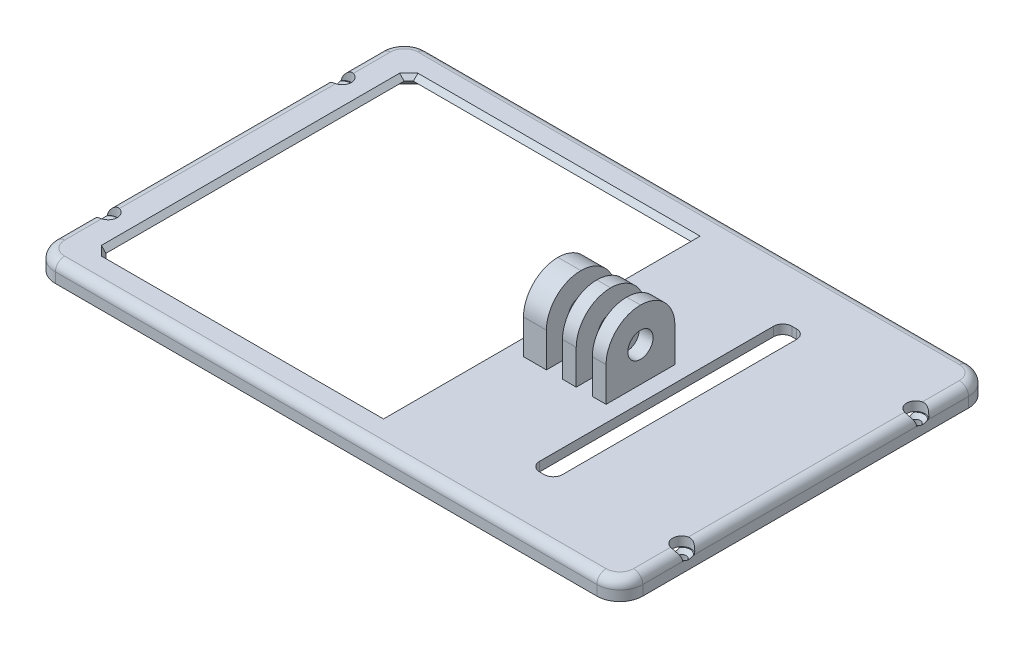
ISO-10303-21;
HEADER;
FILE_DESCRIPTION(('STEP AP214'),'2;1');
FILE_NAME('part.step','',(''),(''),'','','');
FILE_SCHEMA(('AUTOMOTIVE_DESIGN { 1 0 10303 214 1 1 1 1 }'));
ENDSEC;
DATA;
#1=APPLICATION_CONTEXT('core data for automotive mechanical design processes');
#2=APPLICATION_PROTOCOL_DEFINITION('international standard','automotive_design',2000,#1);
#3=PRODUCT_CONTEXT('',#1,'mechanical');
#4=PRODUCT('Part','Part','',(#3));
#5=PRODUCT_RELATED_PRODUCT_CATEGORY('part','',(#4));
#6=PRODUCT_DEFINITION_FORMATION('','',#4);
#7=PRODUCT_DEFINITION_CONTEXT('part definition',#1,'design');
#8=PRODUCT_DEFINITION('design','',#6,#7);
#9=PRODUCT_DEFINITION_SHAPE('','',#8);
#10=(LENGTH_UNIT() NAMED_UNIT(*) SI_UNIT(.MILLI.,.METRE.));
#11=(NAMED_UNIT(*) PLANE_ANGLE_UNIT() SI_UNIT($,.RADIAN.));
#12=(NAMED_UNIT(*) SI_UNIT($,.STERADIAN.) SOLID_ANGLE_UNIT());
#13=UNCERTAINTY_MEASURE_WITH_UNIT(LENGTH_MEASURE(1.E-05),#10,'distance_accuracy_value','');
#14=(GEOMETRIC_REPRESENTATION_CONTEXT(3) GLOBAL_UNCERTAINTY_ASSIGNED_CONTEXT((#13)) GLOBAL_UNIT_ASSIGNED_CONTEXT((#10,
#11,#12)) REPRESENTATION_CONTEXT('',''));
#15=CARTESIAN_POINT('',(0.,0.,0.));
#16=DIRECTION('',(0.,0.,1.));
#17=DIRECTION('',(1.,0.,0.));
#18=AXIS2_PLACEMENT_3D('',#15,#16,#17);
#19=CARTESIAN_POINT('',(64.,11.7,0.));
#20=DIRECTION('',(-1.,0.,0.));
#21=DIRECTION('',(0.,0.,1.));
#22=AXIS2_PLACEMENT_3D('',#19,#20,#21);
#23=CYLINDRICAL_SURFACE('',#22,2.75);
#24=CARTESIAN_POINT('',(15.,11.7,0.));
#25=DIRECTION('',(-1.,0.,0.));
#26=DIRECTION('',(0.,0.,1.));
#27=AXIS2_PLACEMENT_3D('',#24,#25,#26);
#28=CIRCLE('',#27,2.75);
#29=CARTESIAN_POINT('',(15.,11.7,2.75));
#30=VERTEX_POINT('',#29);
#31=EDGE_CURVE('E600',#30,#30,#28,.T.);
#32=ORIENTED_EDGE('',*,*,#31,.F.);
#33=EDGE_LOOP('',(#32));
#34=FACE_BOUND('',#33,.T.);
#35=CARTESIAN_POINT('',(14.,11.7,0.));
#36=DIRECTION('',(-1.,0.,0.));
#37=DIRECTION('',(0.,0.,1.));
#38=AXIS2_PLACEMENT_3D('',#35,#36,#37);
#39=CIRCLE('',#38,2.75);
#40=CARTESIAN_POINT('',(14.,11.7,2.75));
#41=VERTEX_POINT('',#40);
#42=EDGE_CURVE('E41',#41,#41,#39,.F.);
#43=ORIENTED_EDGE('',*,*,#42,.F.);
#44=EDGE_LOOP('',(#43));
#45=FACE_BOUND('',#44,.T.);
#46=ADVANCED_FACE('F37',(#34,#45),#23,.F.);
#47=CARTESIAN_POINT('',(0.,4.2,0.));
#48=DIRECTION('',(0.,-1.,0.));
#49=DIRECTION('',(0.,0.,-1.));
#50=AXIS2_PLACEMENT_3D('',#47,#48,#49);
#51=PLANE('',#50);
#52=DIRECTION('',(0.,0.,1.));
#53=VECTOR('',#52,1.);
#54=CARTESIAN_POINT('',(18.5,4.2,-7.5));
#55=LINE('',#54,#53);
#56=CARTESIAN_POINT('',(18.5,4.2,-7.5));
#57=VERTEX_POINT('',#56);
#58=CARTESIAN_POINT('',(18.5,4.2,7.5));
#59=VERTEX_POINT('',#58);
#60=EDGE_CURVE('E625',#57,#59,#55,.T.);
#61=ORIENTED_EDGE('',*,*,#60,.F.);
#62=DIRECTION('',(-1.,0.,0.));
#63=VECTOR('',#62,1.);
#64=CARTESIAN_POINT('',(18.5,4.2,-7.5));
#65=LINE('',#64,#63);
#66=CARTESIAN_POINT('',(21.5,4.2,-7.5));
#67=VERTEX_POINT('',#66);
#68=EDGE_CURVE('E634',#67,#57,#65,.T.);
#69=ORIENTED_EDGE('',*,*,#68,.F.);
#70=DIRECTION('',(0.,0.,-1.));
#71=VECTOR('',#70,1.);
#72=CARTESIAN_POINT('',(21.5,4.2,-7.5));
#73=LINE('',#72,#71);
#74=CARTESIAN_POINT('',(21.5,4.2,7.5));
#75=VERTEX_POINT('',#74);
#76=EDGE_CURVE('E631',#75,#67,#73,.T.);
#77=ORIENTED_EDGE('',*,*,#76,.F.);
#78=DIRECTION('',(1.,0.,0.));
#79=VECTOR('',#78,1.);
#80=CARTESIAN_POINT('',(18.5,4.2,7.5));
#81=LINE('',#80,#79);
#82=EDGE_CURVE('E628',#59,#75,#81,.T.);
#83=ORIENTED_EDGE('',*,*,#82,.F.);
#84=EDGE_LOOP('',(#61,#69,#77,#83));
#85=FACE_BOUND('',#84,.T.);
#86=DIRECTION('',(0.,0.,1.));
#87=VECTOR('',#86,1.);
#88=CARTESIAN_POINT('',(6.49999999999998,4.2,-500000.));
#89=LINE('',#88,#87);
#90=CARTESIAN_POINT('',(6.49999999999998,4.2,-34.5000000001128));
#91=VERTEX_POINT('',#90);
#92=CARTESIAN_POINT('',(6.49999999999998,4.2,34.5));
#93=VERTEX_POINT('',#92);
#94=EDGE_CURVE('E788',#91,#93,#89,.T.);
#95=ORIENTED_EDGE('',*,*,#94,.T.);
#96=DIRECTION('',(-1.,0.,0.));
#97=VECTOR('',#96,1.);
#98=CARTESIAN_POINT('',(0.,4.2,34.5));
#99=LINE('',#98,#97);
#100=CARTESIAN_POINT('',(-55.0000000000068,4.2,34.5));
#101=VERTEX_POINT('',#100);
#102=EDGE_CURVE('E1996',#93,#101,#99,.T.);
#103=ORIENTED_EDGE('',*,*,#102,.T.);
#104=DIRECTION('',(0.707106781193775,0.,0.70710678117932));
#105=VECTOR('',#104,1.);
#106=CARTESIAN_POINT('',(-55.0000000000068,4.2,34.5));
#107=LINE('',#106,#105);
#108=CARTESIAN_POINT('',(-56.,4.2,33.5));
#109=VERTEX_POINT('',#108);
#110=EDGE_CURVE('E1993',#109,#101,#107,.T.);
#111=ORIENTED_EDGE('',*,*,#110,.F.);
#112=DIRECTION('',(0.707106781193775,0.,0.70710678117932));
#113=VECTOR('',#112,1.);
#114=CARTESIAN_POINT('',(-55.0000000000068,4.2,34.5));
#115=LINE('',#114,#113);
#116=CARTESIAN_POINT('',(-57.,4.2,32.5000000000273));
#117=VERTEX_POINT('',#116);
#118=EDGE_CURVE('E1990',#117,#109,#115,.T.);
#119=ORIENTED_EDGE('',*,*,#118,.F.);
#120=DIRECTION('',(0.,0.,-1.));
#121=VECTOR('',#120,1.);
#122=CARTESIAN_POINT('',(-57.,4.2,0.));
#123=LINE('',#122,#121);
#124=CARTESIAN_POINT('',(-57.,4.2,-32.500000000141));
#125=VERTEX_POINT('',#124);
#126=EDGE_CURVE('E1985',#117,#125,#123,.T.);
#127=ORIENTED_EDGE('',*,*,#126,.T.);
#128=DIRECTION('',(-0.707106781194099,0.,0.707106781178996));
#129=VECTOR('',#128,1.);
#130=CARTESIAN_POINT('',(-57.,4.2,-32.500000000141));
#131=LINE('',#130,#129);
#132=CARTESIAN_POINT('',(-56.,4.20000000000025,-33.5000000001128));
#133=VERTEX_POINT('',#132);
#134=EDGE_CURVE('E1979',#133,#125,#131,.T.);
#135=ORIENTED_EDGE('',*,*,#134,.F.);
#136=DIRECTION('',(-0.707106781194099,0.,0.707106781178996));
#137=VECTOR('',#136,1.);
#138=CARTESIAN_POINT('',(-57.,4.2,-32.500000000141));
#139=LINE('',#138,#137);
#140=CARTESIAN_POINT('',(-55.0000000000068,4.2,-34.5000000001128));
#141=VERTEX_POINT('',#140);
#142=EDGE_CURVE('E1982',#141,#133,#139,.T.);
#143=ORIENTED_EDGE('',*,*,#142,.F.);
#144=DIRECTION('',(1.,0.,0.));
#145=VECTOR('',#144,1.);
#146=CARTESIAN_POINT('',(0.,4.2,-34.5000000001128));
#147=LINE('',#146,#145);
#148=EDGE_CURVE('E1987',#141,#91,#147,.T.);
#149=ORIENTED_EDGE('',*,*,#148,.T.);
#150=EDGE_LOOP('',(#95,#103,#111,#119,#127,#135,#143,#149));
#151=FACE_BOUND('',#150,.T.);
#152=DIRECTION('',(-1.,0.,0.));
#153=VECTOR('',#152,1.);
#154=CARTESIAN_POINT('',(36.5,4.2,-27.5));
#155=LINE('',#154,#153);
#156=CARTESIAN_POINT('',(34.5,4.2,-27.5));
#157=VERTEX_POINT('',#156);
#158=CARTESIAN_POINT('',(33.5,4.2,-27.5));
#159=VERTEX_POINT('',#158);
#160=EDGE_CURVE('E768',#157,#159,#155,.T.);
#161=ORIENTED_EDGE('',*,*,#160,.F.);
#162=CARTESIAN_POINT('',(34.5,4.2,-25.5));
#163=DIRECTION('',(0.,-1.,0.));
#164=DIRECTION('',(0.,0.,-1.));
#165=AXIS2_PLACEMENT_3D('',#162,#163,#164);
#166=CIRCLE('',#165,2.);
#167=CARTESIAN_POINT('',(36.5,4.2,-25.5));
#168=VERTEX_POINT('',#167);
#169=EDGE_CURVE('E879',#157,#168,#166,.T.);
#170=ORIENTED_EDGE('',*,*,#169,.T.);
#171=DIRECTION('',(0.,0.,-1.));
#172=VECTOR('',#171,1.);
#173=CARTESIAN_POINT('',(36.5,4.2,-27.5));
#174=LINE('',#173,#172);
#175=CARTESIAN_POINT('',(36.5,4.2,25.5));
#176=VERTEX_POINT('',#175);
#177=EDGE_CURVE('E765',#176,#168,#174,.T.);
#178=ORIENTED_EDGE('',*,*,#177,.F.);
#179=CARTESIAN_POINT('',(34.5,4.2,25.5));
#180=DIRECTION('',(0.,-1.,0.));
#181=DIRECTION('',(0.,0.,-1.));
#182=AXIS2_PLACEMENT_3D('',#179,#180,#181);
#183=CIRCLE('',#182,2.);
#184=CARTESIAN_POINT('',(34.5,4.2,27.5));
#185=VERTEX_POINT('',#184);
#186=EDGE_CURVE('E875',#176,#185,#183,.T.);
#187=ORIENTED_EDGE('',*,*,#186,.T.);
#188=DIRECTION('',(1.,0.,0.));
#189=VECTOR('',#188,1.);
#190=CARTESIAN_POINT('',(36.5,4.2,27.5));
#191=LINE('',#190,#189);
#192=CARTESIAN_POINT('',(33.5,4.2,27.5));
#193=VERTEX_POINT('',#192);
#194=EDGE_CURVE('E774',#193,#185,#191,.T.);
#195=ORIENTED_EDGE('',*,*,#194,.F.);
#196=CARTESIAN_POINT('',(33.5,4.2,25.5));
#197=DIRECTION('',(0.,-1.,0.));
#198=DIRECTION('',(0.,0.,-1.));
#199=AXIS2_PLACEMENT_3D('',#196,#197,#198);
#200=CIRCLE('',#199,2.);
#201=CARTESIAN_POINT('',(31.5,4.2,25.5));
#202=VERTEX_POINT('',#201);
#203=EDGE_CURVE('E887',#193,#202,#200,.T.);
#204=ORIENTED_EDGE('',*,*,#203,.T.);
#205=DIRECTION('',(0.,0.,1.));
#206=VECTOR('',#205,1.);
#207=CARTESIAN_POINT('',(31.5,4.2,-27.5));
#208=LINE('',#207,#206);
#209=CARTESIAN_POINT('',(31.5,4.2,-25.5));
#210=VERTEX_POINT('',#209);
#211=EDGE_CURVE('E771',#210,#202,#208,.T.);
#212=ORIENTED_EDGE('',*,*,#211,.F.);
#213=CARTESIAN_POINT('',(33.5,4.2,-25.5));
#214=DIRECTION('',(0.,-1.,0.));
#215=DIRECTION('',(0.,0.,-1.));
#216=AXIS2_PLACEMENT_3D('',#213,#214,#215);
#217=CIRCLE('',#216,2.);
#218=EDGE_CURVE('E883',#210,#159,#217,.T.);
#219=ORIENTED_EDGE('',*,*,#218,.T.);
#220=EDGE_LOOP('',(#161,#170,#178,#187,#195,#204,#212,#219));
#221=FACE_BOUND('',#220,.T.);
#222=CARTESIAN_POINT('',(62.5,4.2,25.5));
#223=DIRECTION('',(0.,1.,0.));
#224=DIRECTION('',(0.,0.,1.));
#225=AXIS2_PLACEMENT_3D('',#222,#223,#224);
#226=CIRCLE('',#225,2.);
#227=CARTESIAN_POINT('',(62.,4.2,23.5635083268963));
#228=VERTEX_POINT('',#227);
#229=CARTESIAN_POINT('',(62.,4.2,27.4364916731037));
#230=VERTEX_POINT('',#229);
#231=EDGE_CURVE('E679',#228,#230,#226,.T.);
#232=ORIENTED_EDGE('',*,*,#231,.F.);
#233=DIRECTION('',(0.,0.,-1.));
#234=VECTOR('',#233,1.);
#235=CARTESIAN_POINT('',(62.,4.2,0.));
#236=LINE('',#235,#234);
#237=CARTESIAN_POINT('',(62.,4.2,-23.5635083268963));
#238=VERTEX_POINT('',#237);
#239=EDGE_CURVE('E2094',#228,#238,#236,.T.);
#240=ORIENTED_EDGE('',*,*,#239,.T.);
#241=CARTESIAN_POINT('',(62.5,4.2,-25.5));
#242=DIRECTION('',(0.,1.,0.));
#243=DIRECTION('',(0.,0.,1.));
#244=AXIS2_PLACEMENT_3D('',#241,#242,#243);
#245=CIRCLE('',#244,2.);
#246=CARTESIAN_POINT('',(62.,4.2,-27.4364916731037));
#247=VERTEX_POINT('',#246);
#248=EDGE_CURVE('E670',#247,#238,#245,.T.);
#249=ORIENTED_EDGE('',*,*,#248,.F.);
#250=DIRECTION('',(0.,0.,-1.));
#251=VECTOR('',#250,1.);
#252=CARTESIAN_POINT('',(62.,4.2,0.));
#253=LINE('',#252,#251);
#254=CARTESIAN_POINT('',(62.,4.2,-35.5));
#255=VERTEX_POINT('',#254);
#256=EDGE_CURVE('E2092',#247,#255,#253,.T.);
#257=ORIENTED_EDGE('',*,*,#256,.T.);
#258=CARTESIAN_POINT('',(59.,4.2,-35.5));
#259=DIRECTION('',(0.,-1.,0.));
#260=DIRECTION('',(0.,0.,-1.));
#261=AXIS2_PLACEMENT_3D('',#258,#259,#260);
#262=CIRCLE('',#261,3.);
#263=CARTESIAN_POINT('',(59.,4.2,-38.5));
#264=VERTEX_POINT('',#263);
#265=EDGE_CURVE('E2089',#255,#264,#262,.F.);
#266=ORIENTED_EDGE('',*,*,#265,.T.);
#267=DIRECTION('',(-1.,0.,0.));
#268=VECTOR('',#267,1.);
#269=CARTESIAN_POINT('',(0.,4.2,-38.5));
#270=LINE('',#269,#268);
#271=CARTESIAN_POINT('',(-59.,4.2,-38.5));
#272=VERTEX_POINT('',#271);
#273=EDGE_CURVE('E2087',#264,#272,#270,.T.);
#274=ORIENTED_EDGE('',*,*,#273,.T.);
#275=CARTESIAN_POINT('',(-59.,4.2,-35.5));
#276=DIRECTION('',(0.,-1.,0.));
#277=DIRECTION('',(0.,0.,-1.));
#278=AXIS2_PLACEMENT_3D('',#275,#276,#277);
#279=CIRCLE('',#278,3.);
#280=CARTESIAN_POINT('',(-62.,4.2,-35.5));
#281=VERTEX_POINT('',#280);
#282=EDGE_CURVE('E2085',#272,#281,#279,.F.);
#283=ORIENTED_EDGE('',*,*,#282,.T.);
#284=DIRECTION('',(0.,0.,1.));
#285=VECTOR('',#284,1.);
#286=CARTESIAN_POINT('',(-62.,4.2,0.));
#287=LINE('',#286,#285);
#288=CARTESIAN_POINT('',(-62.,4.2,-27.4364916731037));
#289=VERTEX_POINT('',#288);
#290=EDGE_CURVE('E2083',#281,#289,#287,.T.);
#291=ORIENTED_EDGE('',*,*,#290,.T.);
#292=CARTESIAN_POINT('',(-62.5,4.2,-25.5));
#293=DIRECTION('',(0.,1.,0.));
#294=DIRECTION('',(0.,0.,1.));
#295=AXIS2_PLACEMENT_3D('',#292,#293,#294);
#296=CIRCLE('',#295,2.);
#297=CARTESIAN_POINT('',(-62.,4.2,-23.5635083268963));
#298=VERTEX_POINT('',#297);
#299=EDGE_CURVE('E699',#298,#289,#296,.T.);
#300=ORIENTED_EDGE('',*,*,#299,.F.);
#301=DIRECTION('',(0.,0.,1.));
#302=VECTOR('',#301,1.);
#303=CARTESIAN_POINT('',(-62.,4.2,0.));
#304=LINE('',#303,#302);
#305=CARTESIAN_POINT('',(-62.,4.2,23.5635083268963));
#306=VERTEX_POINT('',#305);
#307=EDGE_CURVE('E2080',#298,#306,#304,.T.);
#308=ORIENTED_EDGE('',*,*,#307,.T.);
#309=CARTESIAN_POINT('',(-62.5,4.2,25.5));
#310=DIRECTION('',(0.,1.,0.));
#311=DIRECTION('',(0.,0.,1.));
#312=AXIS2_PLACEMENT_3D('',#309,#310,#311);
#313=CIRCLE('',#312,2.);
#314=CARTESIAN_POINT('',(-62.,4.2,27.4364916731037));
#315=VERTEX_POINT('',#314);
#316=EDGE_CURVE('E709',#315,#306,#313,.T.);
#317=ORIENTED_EDGE('',*,*,#316,.F.);
#318=DIRECTION('',(0.,0.,1.));
#319=VECTOR('',#318,1.);
#320=CARTESIAN_POINT('',(-62.,4.2,0.));
#321=LINE('',#320,#319);
#322=CARTESIAN_POINT('',(-62.,4.2,35.5));
#323=VERTEX_POINT('',#322);
#324=EDGE_CURVE('E2077',#315,#323,#321,.T.);
#325=ORIENTED_EDGE('',*,*,#324,.T.);
#326=CARTESIAN_POINT('',(-59.,4.2,35.5));
#327=DIRECTION('',(0.,-1.,0.));
#328=DIRECTION('',(0.,0.,-1.));
#329=AXIS2_PLACEMENT_3D('',#326,#327,#328);
#330=CIRCLE('',#329,3.);
#331=CARTESIAN_POINT('',(-59.,4.2,38.5));
#332=VERTEX_POINT('',#331);
#333=EDGE_CURVE('E2075',#323,#332,#330,.F.);
#334=ORIENTED_EDGE('',*,*,#333,.T.);
#335=DIRECTION('',(1.,0.,0.));
#336=VECTOR('',#335,1.);
#337=CARTESIAN_POINT('',(0.,4.2,38.5));
#338=LINE('',#337,#336);
#339=CARTESIAN_POINT('',(59.,4.2,38.5));
#340=VERTEX_POINT('',#339);
#341=EDGE_CURVE('E2026',#332,#340,#338,.T.);
#342=ORIENTED_EDGE('',*,*,#341,.T.);
#343=CARTESIAN_POINT('',(59.,4.2,35.5));
#344=DIRECTION('',(0.,-1.,0.));
#345=DIRECTION('',(0.,0.,-1.));
#346=AXIS2_PLACEMENT_3D('',#343,#344,#345);
#347=CIRCLE('',#346,3.);
#348=CARTESIAN_POINT('',(62.,4.2,35.5));
#349=VERTEX_POINT('',#348);
#350=EDGE_CURVE('E2071',#340,#349,#347,.F.);
#351=ORIENTED_EDGE('',*,*,#350,.T.);
#352=DIRECTION('',(0.,0.,-1.));
#353=VECTOR('',#352,1.);
#354=CARTESIAN_POINT('',(62.,4.2,0.));
#355=LINE('',#354,#353);
#356=EDGE_CURVE('E2073',#349,#230,#355,.T.);
#357=ORIENTED_EDGE('',*,*,#356,.T.);
#358=EDGE_LOOP('',(#232,#240,#249,#257,#266,#274,#283,#291,#300,#308,#317,#325,#334,#342,#351,#357));
#359=FACE_BOUND('',#358,.T.);
#360=DIRECTION('',(0.,0.,1.));
#361=VECTOR('',#360,1.);
#362=CARTESIAN_POINT('',(9.99999999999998,4.2,-7.5));
#363=LINE('',#362,#361);
#364=CARTESIAN_POINT('',(9.99999999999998,4.2,-7.5));
#365=VERTEX_POINT('',#364);
#366=CARTESIAN_POINT('',(9.99999999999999,4.2,7.5));
#367=VERTEX_POINT('',#366);
#368=EDGE_CURVE('E645',#365,#367,#363,.T.);
#369=ORIENTED_EDGE('',*,*,#368,.F.);
#370=DIRECTION('',(-1.,0.,0.));
#371=VECTOR('',#370,1.);
#372=CARTESIAN_POINT('',(9.99999999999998,4.2,-7.5));
#373=LINE('',#372,#371);
#374=CARTESIAN_POINT('',(15.,4.2,-7.5));
#375=VERTEX_POINT('',#374);
#376=EDGE_CURVE('E654',#375,#365,#373,.T.);
#377=ORIENTED_EDGE('',*,*,#376,.F.);
#378=DIRECTION('',(0.,0.,-1.));
#379=VECTOR('',#378,1.);
#380=CARTESIAN_POINT('',(15.,4.2,-7.5));
#381=LINE('',#380,#379);
#382=CARTESIAN_POINT('',(15.,4.2,7.5));
#383=VERTEX_POINT('',#382);
#384=EDGE_CURVE('E651',#383,#375,#381,.T.);
#385=ORIENTED_EDGE('',*,*,#384,.F.);
#386=DIRECTION('',(1.,0.,0.));
#387=VECTOR('',#386,1.);
#388=CARTESIAN_POINT('',(9.99999999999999,4.2,7.5));
#389=LINE('',#388,#387);
#390=EDGE_CURVE('E648',#367,#383,#389,.T.);
#391=ORIENTED_EDGE('',*,*,#390,.F.);
#392=EDGE_LOOP('',(#369,#377,#385,#391));
#393=FACE_BOUND('',#392,.T.);
#394=DIRECTION('',(0.,0.,1.));
#395=VECTOR('',#394,1.);
#396=CARTESIAN_POINT('',(25.,4.2,-7.5));
#397=LINE('',#396,#395);
#398=CARTESIAN_POINT('',(25.,4.2,-7.5));
#399=VERTEX_POINT('',#398);
#400=CARTESIAN_POINT('',(25.,4.2,7.5));
#401=VERTEX_POINT('',#400);
#402=EDGE_CURVE('E604',#399,#401,#397,.T.);
#403=ORIENTED_EDGE('',*,*,#402,.F.);
#404=DIRECTION('',(-1.,0.,0.));
#405=VECTOR('',#404,1.);
#406=CARTESIAN_POINT('',(25.,4.2,-7.5));
#407=LINE('',#406,#405);
#408=CARTESIAN_POINT('',(28.,4.2,-7.5));
#409=VERTEX_POINT('',#408);
#410=EDGE_CURVE('E614',#409,#399,#407,.T.);
#411=ORIENTED_EDGE('',*,*,#410,.F.);
#412=DIRECTION('',(0.,0.,-1.));
#413=VECTOR('',#412,1.);
#414=CARTESIAN_POINT('',(28.,4.2,-7.5));
#415=LINE('',#414,#413);
#416=CARTESIAN_POINT('',(28.,4.2,7.5));
#417=VERTEX_POINT('',#416);
#418=EDGE_CURVE('E611',#417,#409,#415,.T.);
#419=ORIENTED_EDGE('',*,*,#418,.F.);
#420=DIRECTION('',(1.,0.,0.));
#421=VECTOR('',#420,1.);
#422=CARTESIAN_POINT('',(25.,4.2,7.5));
#423=LINE('',#422,#421);
#424=EDGE_CURVE('E607',#401,#417,#423,.T.);
#425=ORIENTED_EDGE('',*,*,#424,.F.);
#426=EDGE_LOOP('',(#403,#411,#419,#425));
#427=FACE_BOUND('',#426,.T.);
#428=ADVANCED_FACE('F972',(#85,#151,#221,#359,#393,#427),#51,.F.);
#429=CARTESIAN_POINT('',(-64.,4.2,-40.5));
#430=DIRECTION('',(0.,0.,1.));
#431=DIRECTION('',(1.,0.,0.));
#432=AXIS2_PLACEMENT_3D('',#429,#430,#431);
#433=PLANE('',#432);
#434=DIRECTION('',(0.,-1.,0.));
#435=VECTOR('',#434,1.);
#436=CARTESIAN_POINT('',(-59.,4.2,-40.5));
#437=LINE('',#436,#435);
#438=CARTESIAN_POINT('',(-59.,1.70000000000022,-40.5));
#439=VERTEX_POINT('',#438);
#440=CARTESIAN_POINT('',(-59.,2.2,-40.5));
#441=VERTEX_POINT('',#440);
#442=EDGE_CURVE('E845',#439,#441,#437,.F.);
#443=ORIENTED_EDGE('',*,*,#442,.T.);
#444=DIRECTION('',(-1.,0.,0.));
#445=VECTOR('',#444,1.);
#446=CARTESIAN_POINT('',(-64.,2.2,-40.5));
#447=LINE('',#446,#445);
#448=CARTESIAN_POINT('',(-58.5000000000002,2.2,-40.5));
#449=VERTEX_POINT('',#448);
#450=EDGE_CURVE('E2128',#441,#449,#447,.F.);
#451=ORIENTED_EDGE('',*,*,#450,.T.);
#452=DIRECTION('',(0.707106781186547,0.707106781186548,0.));
#453=VECTOR('',#452,1.);
#454=CARTESIAN_POINT('',(-60.2500000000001,0.450000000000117,-40.5));
#455=LINE('',#454,#453);
#456=EDGE_CURVE('E745',#439,#449,#455,.T.);
#457=ORIENTED_EDGE('',*,*,#456,.F.);
#458=EDGE_LOOP('',(#443,#451,#457));
#459=FACE_BOUND('',#458,.T.);
#460=ADVANCED_FACE('F975',(#459),#433,.F.);
#461=CARTESIAN_POINT('',(61.,2.2,-500000.));
#462=DIRECTION('',(0.,1.,0.));
#463=DIRECTION('',(0.,0.,1.));
#464=AXIS2_PLACEMENT_3D('',#461,#462,#463);
#465=PLANE('',#464);
#466=DIRECTION('',(0.,0.,1.));
#467=VECTOR('',#466,1.);
#468=CARTESIAN_POINT('',(61.,2.2,-500000.));
#469=LINE('',#468,#467);
#470=CARTESIAN_POINT('',(61.,2.2,-38.4999999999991));
#471=VERTEX_POINT('',#470);
#472=CARTESIAN_POINT('',(61.,2.2,-26.8228756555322));
#473=VERTEX_POINT('',#472);
#474=EDGE_CURVE('E789',#471,#473,#469,.T.);
#475=ORIENTED_EDGE('',*,*,#474,.T.);
#476=CARTESIAN_POINT('',(62.5,2.2,-25.5));
#477=DIRECTION('',(0.,1.,0.));
#478=DIRECTION('',(0.,0.,1.));
#479=AXIS2_PLACEMENT_3D('',#476,#477,#478);
#480=CIRCLE('',#479,2.);
#481=CARTESIAN_POINT('',(61.,2.2,-24.1771243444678));
#482=VERTEX_POINT('',#481);
#483=EDGE_CURVE('E669',#473,#482,#480,.T.);
#484=ORIENTED_EDGE('',*,*,#483,.T.);
#485=CARTESIAN_POINT('',(61.,2.2,24.1771243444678));
#486=VERTEX_POINT('',#485);
#487=EDGE_CURVE('E792',#482,#486,#469,.T.);
#488=ORIENTED_EDGE('',*,*,#487,.T.);
#489=CARTESIAN_POINT('',(62.5,2.2,25.5));
#490=DIRECTION('',(0.,1.,0.));
#491=DIRECTION('',(0.,0.,1.));
#492=AXIS2_PLACEMENT_3D('',#489,#490,#491);
#493=CIRCLE('',#492,2.);
#494=CARTESIAN_POINT('',(61.,2.2,26.8228756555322));
#495=VERTEX_POINT('',#494);
#496=EDGE_CURVE('E678',#486,#495,#493,.T.);
#497=ORIENTED_EDGE('',*,*,#496,.T.);
#498=CARTESIAN_POINT('',(61.,2.2,38.5));
#499=VERTEX_POINT('',#498);
#500=EDGE_CURVE('E783',#495,#499,#469,.T.);
#501=ORIENTED_EDGE('',*,*,#500,.T.);
#502=DIRECTION('',(-1.,0.,0.));
#503=VECTOR('',#502,1.);
#504=CARTESIAN_POINT('',(61.,2.2,38.5));
#505=LINE('',#504,#503);
#506=CARTESIAN_POINT('',(-59.,2.2,38.5));
#507=VERTEX_POINT('',#506);
#508=EDGE_CURVE('E784',#499,#507,#505,.T.);
#509=ORIENTED_EDGE('',*,*,#508,.T.);
#510=DIRECTION('',(0.,0.,-1.));
#511=VECTOR('',#510,1.);
#512=CARTESIAN_POINT('',(-59.000000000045,2.2,-500000.));
#513=LINE('',#512,#511);
#514=CARTESIAN_POINT('',(-59.,2.2,-38.4999999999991));
#515=VERTEX_POINT('',#514);
#516=EDGE_CURVE('E899',#507,#515,#513,.T.);
#517=ORIENTED_EDGE('',*,*,#516,.T.);
#518=DIRECTION('',(1.,0.,0.));
#519=VECTOR('',#518,1.);
#520=CARTESIAN_POINT('',(61.,2.2,-38.4999999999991));
#521=LINE('',#520,#519);
#522=CARTESIAN_POINT('',(-58.5000000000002,2.2,-38.5));
#523=VERTEX_POINT('',#522);
#524=EDGE_CURVE('E781',#515,#523,#521,.T.);
#525=ORIENTED_EDGE('',*,*,#524,.T.);
#526=DIRECTION('',(0.,0.,1.));
#527=VECTOR('',#526,1.);
#528=CARTESIAN_POINT('',(-58.5000000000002,2.2,-42.7));
#529=LINE('',#528,#527);
#530=EDGE_CURVE('E749',#449,#523,#529,.T.);
#531=ORIENTED_EDGE('',*,*,#530,.F.);
#532=DIRECTION('',(-1.,0.,0.));
#533=VECTOR('',#532,1.);
#534=CARTESIAN_POINT('',(-64.,2.2,-40.5));
#535=LINE('',#534,#533);
#536=CARTESIAN_POINT('',(4.00000000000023,2.2,-40.5));
#537=VERTEX_POINT('',#536);
#538=EDGE_CURVE('E894',#537,#449,#535,.T.);
#539=ORIENTED_EDGE('',*,*,#538,.F.);
#540=DIRECTION('',(0.,0.,1.));
#541=VECTOR('',#540,1.);
#542=CARTESIAN_POINT('',(4.00000000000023,2.2,-42.7));
#543=LINE('',#542,#541);
#544=CARTESIAN_POINT('',(4.00000000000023,2.2,-38.4999999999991));
#545=VERTEX_POINT('',#544);
#546=EDGE_CURVE('E742',#537,#545,#543,.T.);
#547=ORIENTED_EDGE('',*,*,#546,.T.);
#548=EDGE_CURVE('E780',#545,#471,#521,.T.);
#549=ORIENTED_EDGE('',*,*,#548,.T.);
#550=EDGE_LOOP('',(#475,#484,#488,#497,#501,#509,#517,#525,#531,#539,#547,#549));
#551=FACE_BOUND('',#550,.T.);
#552=DIRECTION('',(-1.,0.,0.));
#553=VECTOR('',#552,1.);
#554=CARTESIAN_POINT('',(36.5,2.2,27.5));
#555=LINE('',#554,#553);
#556=CARTESIAN_POINT('',(34.5,2.2,27.5));
#557=VERTEX_POINT('',#556);
#558=CARTESIAN_POINT('',(33.5,2.2,27.5));
#559=VERTEX_POINT('',#558);
#560=EDGE_CURVE('E759',#557,#559,#555,.T.);
#561=ORIENTED_EDGE('',*,*,#560,.F.);
#562=CARTESIAN_POINT('',(34.5,2.2,25.5));
#563=DIRECTION('',(0.,1.,0.));
#564=DIRECTION('',(0.,0.,1.));
#565=AXIS2_PLACEMENT_3D('',#562,#563,#564);
#566=CIRCLE('',#565,2.);
#567=CARTESIAN_POINT('',(36.5,2.2,25.5));
#568=VERTEX_POINT('',#567);
#569=EDGE_CURVE('E877',#557,#568,#566,.T.);
#570=ORIENTED_EDGE('',*,*,#569,.T.);
#571=DIRECTION('',(0.,0.,1.));
#572=VECTOR('',#571,1.);
#573=CARTESIAN_POINT('',(36.5,2.2,-27.5));
#574=LINE('',#573,#572);
#575=CARTESIAN_POINT('',(36.5,2.2,-25.5));
#576=VERTEX_POINT('',#575);
#577=EDGE_CURVE('E762',#576,#568,#574,.T.);
#578=ORIENTED_EDGE('',*,*,#577,.F.);
#579=CARTESIAN_POINT('',(34.5,2.2,-25.5));
#580=DIRECTION('',(0.,1.,0.));
#581=DIRECTION('',(0.,0.,1.));
#582=AXIS2_PLACEMENT_3D('',#579,#580,#581);
#583=CIRCLE('',#582,2.);
#584=CARTESIAN_POINT('',(34.5,2.2,-27.5));
#585=VERTEX_POINT('',#584);
#586=EDGE_CURVE('E881',#576,#585,#583,.T.);
#587=ORIENTED_EDGE('',*,*,#586,.T.);
#588=DIRECTION('',(1.,0.,0.));
#589=VECTOR('',#588,1.);
#590=CARTESIAN_POINT('',(36.5,2.2,-27.5));
#591=LINE('',#590,#589);
#592=CARTESIAN_POINT('',(33.5,2.2,-27.5));
#593=VERTEX_POINT('',#592);
#594=EDGE_CURVE('E777',#593,#585,#591,.T.);
#595=ORIENTED_EDGE('',*,*,#594,.F.);
#596=CARTESIAN_POINT('',(33.5,2.2,-25.5));
#597=DIRECTION('',(0.,1.,0.));
#598=DIRECTION('',(0.,0.,1.));
#599=AXIS2_PLACEMENT_3D('',#596,#597,#598);
#600=CIRCLE('',#599,2.);
#601=CARTESIAN_POINT('',(31.5,2.2,-25.5));
#602=VERTEX_POINT('',#601);
#603=EDGE_CURVE('E885',#593,#602,#600,.T.);
#604=ORIENTED_EDGE('',*,*,#603,.T.);
#605=DIRECTION('',(0.,0.,-1.));
#606=VECTOR('',#605,1.);
#607=CARTESIAN_POINT('',(31.5,2.2,-27.5));
#608=LINE('',#607,#606);
#609=CARTESIAN_POINT('',(31.5,2.2,25.5));
#610=VERTEX_POINT('',#609);
#611=EDGE_CURVE('E756',#610,#602,#608,.T.);
#612=ORIENTED_EDGE('',*,*,#611,.F.);
#613=CARTESIAN_POINT('',(33.5,2.2,25.5));
#614=DIRECTION('',(0.,1.,0.));
#615=DIRECTION('',(0.,0.,1.));
#616=AXIS2_PLACEMENT_3D('',#613,#614,#615);
#617=CIRCLE('',#616,2.);
#618=EDGE_CURVE('E889',#610,#559,#617,.T.);
#619=ORIENTED_EDGE('',*,*,#618,.T.);
#620=EDGE_LOOP('',(#561,#570,#578,#587,#595,#604,#612,#619));
#621=FACE_BOUND('',#620,.T.);
#622=DIRECTION('',(0.707106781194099,0.,-0.707106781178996));
#623=VECTOR('',#622,1.);
#624=CARTESIAN_POINT('',(-55.0000000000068,2.2,-34.5000000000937));
#625=LINE('',#624,#623);
#626=CARTESIAN_POINT('',(-57.,2.2,-32.500000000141));
#627=VERTEX_POINT('',#626);
#628=CARTESIAN_POINT('',(-56.,2.20000000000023,-33.500000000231));
#629=VERTEX_POINT('',#628);
#630=EDGE_CURVE('E2011',#627,#629,#625,.T.);
#631=ORIENTED_EDGE('',*,*,#630,.F.);
#632=DIRECTION('',(0.,0.,1.));
#633=VECTOR('',#632,1.);
#634=CARTESIAN_POINT('',(-57.,2.2,-500000.));
#635=LINE('',#634,#633);
#636=CARTESIAN_POINT('',(-57.,2.2,32.5000000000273));
#637=VERTEX_POINT('',#636);
#638=EDGE_CURVE('E2016',#627,#637,#635,.T.);
#639=ORIENTED_EDGE('',*,*,#638,.T.);
#640=DIRECTION('',(-0.707106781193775,0.,-0.70710678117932));
#641=VECTOR('',#640,1.);
#642=CARTESIAN_POINT('',(-57.,2.2,32.5000000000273));
#643=LINE('',#642,#641);
#644=CARTESIAN_POINT('',(-56.0000000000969,2.2,33.5));
#645=VERTEX_POINT('',#644);
#646=EDGE_CURVE('E2014',#645,#637,#643,.T.);
#647=ORIENTED_EDGE('',*,*,#646,.F.);
#648=DIRECTION('',(-0.707106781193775,0.,-0.70710678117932));
#649=VECTOR('',#648,1.);
#650=CARTESIAN_POINT('',(-57.,2.2,32.5000000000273));
#651=LINE('',#650,#649);
#652=CARTESIAN_POINT('',(-55.0000000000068,2.2,34.49999999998));
#653=VERTEX_POINT('',#652);
#654=EDGE_CURVE('E2005',#653,#645,#651,.T.);
#655=ORIENTED_EDGE('',*,*,#654,.F.);
#656=DIRECTION('',(1.,0.,0.));
#657=VECTOR('',#656,1.);
#658=CARTESIAN_POINT('',(61.,2.2,34.49999999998));
#659=LINE('',#658,#657);
#660=CARTESIAN_POINT('',(7.49999999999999,2.2,34.49999999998));
#661=VERTEX_POINT('',#660);
#662=EDGE_CURVE('E2003',#653,#661,#659,.T.);
#663=ORIENTED_EDGE('',*,*,#662,.T.);
#664=DIRECTION('',(0.,0.,-1.));
#665=VECTOR('',#664,1.);
#666=CARTESIAN_POINT('',(7.49999999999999,2.2,-500000.));
#667=LINE('',#666,#665);
#668=CARTESIAN_POINT('',(7.49999999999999,2.2,-34.5000000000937));
#669=VERTEX_POINT('',#668);
#670=EDGE_CURVE('E1999',#661,#669,#667,.T.);
#671=ORIENTED_EDGE('',*,*,#670,.T.);
#672=DIRECTION('',(-1.,0.,0.));
#673=VECTOR('',#672,1.);
#674=CARTESIAN_POINT('',(61.,2.2,-34.5000000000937));
#675=LINE('',#674,#673);
#676=CARTESIAN_POINT('',(-55.0000000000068,2.2,-34.5000000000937));
#677=VERTEX_POINT('',#676);
#678=EDGE_CURVE('E2001',#669,#677,#675,.T.);
#679=ORIENTED_EDGE('',*,*,#678,.T.);
#680=DIRECTION('',(0.707106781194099,0.,-0.707106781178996));
#681=VECTOR('',#680,1.);
#682=CARTESIAN_POINT('',(-55.0000000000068,2.2,-34.5000000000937));
#683=LINE('',#682,#681);
#684=EDGE_CURVE('E2008',#629,#677,#683,.T.);
#685=ORIENTED_EDGE('',*,*,#684,.F.);
#686=EDGE_LOOP('',(#631,#639,#647,#655,#663,#671,#679,#685));
#687=FACE_BOUND('',#686,.T.);
#688=ADVANCED_FACE('F1043',(#551,#621,#687),#465,.F.);
#689=CARTESIAN_POINT('',(62.5,2.2,-25.5));
#690=DIRECTION('',(0.,1.,0.));
#691=DIRECTION('',(0.,0.,1.));
#692=AXIS2_PLACEMENT_3D('',#689,#690,#691);
#693=PLANE('',#692);
#694=DIRECTION('',(0.,0.,-1.));
#695=VECTOR('',#694,1.);
#696=CARTESIAN_POINT('',(64.,2.2,40.5));
#697=LINE('',#696,#695);
#698=CARTESIAN_POINT('',(64.,2.2,-24.1771243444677));
#699=VERTEX_POINT('',#698);
#700=CARTESIAN_POINT('',(64.,2.2,-24.5050125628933));
#701=VERTEX_POINT('',#700);
#702=EDGE_CURVE('E692',#699,#701,#697,.T.);
#703=ORIENTED_EDGE('',*,*,#702,.T.);
#704=CARTESIAN_POINT('',(62.5,2.2,-25.5));
#705=DIRECTION('',(0.,1.,0.));
#706=DIRECTION('',(0.,0.,1.));
#707=AXIS2_PLACEMENT_3D('',#704,#705,#706);
#708=CIRCLE('',#707,1.79999999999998);
#709=CARTESIAN_POINT('',(61.,2.2,-24.5050125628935));
#710=VERTEX_POINT('',#709);
#711=EDGE_CURVE('E1973',#701,#710,#708,.F.);
#712=ORIENTED_EDGE('',*,*,#711,.T.);
#713=DIRECTION('',(0.,0.,-1.));
#714=VECTOR('',#713,1.);
#715=CARTESIAN_POINT('',(61.,2.2,38.5));
#716=LINE('',#715,#714);
#717=EDGE_CURVE('E696',#482,#710,#716,.T.);
#718=ORIENTED_EDGE('',*,*,#717,.F.);
#719=EDGE_CURVE('E666',#482,#699,#480,.T.);
#720=ORIENTED_EDGE('',*,*,#719,.T.);
#721=EDGE_LOOP('',(#703,#712,#718,#720));
#722=FACE_BOUND('',#721,.T.);
#723=ADVANCED_FACE('F1046',(#722),#693,.T.);
#724=CARTESIAN_POINT('',(62.5,2.2,25.5));
#725=DIRECTION('',(0.,1.,0.));
#726=DIRECTION('',(0.,0.,1.));
#727=AXIS2_PLACEMENT_3D('',#724,#725,#726);
#728=PLANE('',#727);
#729=DIRECTION('',(0.,0.,-1.));
#730=VECTOR('',#729,1.);
#731=CARTESIAN_POINT('',(64.,2.2,40.5));
#732=LINE('',#731,#730);
#733=CARTESIAN_POINT('',(64.,2.2,26.8228756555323));
#734=VERTEX_POINT('',#733);
#735=CARTESIAN_POINT('',(64.,2.2,26.4949874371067));
#736=VERTEX_POINT('',#735);
#737=EDGE_CURVE('E683',#734,#736,#732,.T.);
#738=ORIENTED_EDGE('',*,*,#737,.T.);
#739=CARTESIAN_POINT('',(62.5,2.2,25.5));
#740=DIRECTION('',(0.,1.,0.));
#741=DIRECTION('',(0.,0.,1.));
#742=AXIS2_PLACEMENT_3D('',#739,#740,#741);
#743=CIRCLE('',#742,1.80000000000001);
#744=CARTESIAN_POINT('',(61.,2.2,26.4949874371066));
#745=VERTEX_POINT('',#744);
#746=EDGE_CURVE('E1954',#736,#745,#743,.F.);
#747=ORIENTED_EDGE('',*,*,#746,.T.);
#748=DIRECTION('',(0.,0.,-1.));
#749=VECTOR('',#748,1.);
#750=CARTESIAN_POINT('',(61.,2.2,38.5));
#751=LINE('',#750,#749);
#752=EDGE_CURVE('E688',#495,#745,#751,.T.);
#753=ORIENTED_EDGE('',*,*,#752,.F.);
#754=EDGE_CURVE('E675',#495,#734,#493,.T.);
#755=ORIENTED_EDGE('',*,*,#754,.T.);
#756=EDGE_LOOP('',(#738,#747,#753,#755));
#757=FACE_BOUND('',#756,.T.);
#758=ADVANCED_FACE('F1078',(#757),#728,.T.);
#759=CARTESIAN_POINT('',(62.5,0.,-25.5));
#760=DIRECTION('',(0.,1.,0.));
#761=DIRECTION('',(0.,0.,1.));
#762=AXIS2_PLACEMENT_3D('',#759,#760,#761);
#763=CYLINDRICAL_SURFACE('',#762,0.999999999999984);
#764=CARTESIAN_POINT('',(62.5,1.40000000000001,-25.5));
#765=DIRECTION('',(0.,1.,0.));
#766=DIRECTION('',(0.,0.,1.));
#767=AXIS2_PLACEMENT_3D('',#764,#765,#766);
#768=CIRCLE('',#767,0.999999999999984);
#769=CARTESIAN_POINT('',(62.5,1.40000000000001,-24.5));
#770=VERTEX_POINT('',#769);
#771=EDGE_CURVE('E1974',#770,#770,#768,.T.);
#772=ORIENTED_EDGE('',*,*,#771,.T.);
#773=EDGE_LOOP('',(#772));
#774=FACE_BOUND('',#773,.T.);
#775=CARTESIAN_POINT('',(62.5,0.,-25.5));
#776=DIRECTION('',(0.,1.,0.));
#777=DIRECTION('',(0.,0.,1.));
#778=AXIS2_PLACEMENT_3D('',#775,#776,#777);
#779=CIRCLE('',#778,0.999999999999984);
#780=CARTESIAN_POINT('',(62.5,0.,-24.5));
#781=VERTEX_POINT('',#780);
#782=EDGE_CURVE('E728',#781,#781,#779,.T.);
#783=ORIENTED_EDGE('',*,*,#782,.F.);
#784=EDGE_LOOP('',(#783));
#785=FACE_BOUND('',#784,.T.);
#786=ADVANCED_FACE('F1074',(#774,#785),#763,.F.);
#787=CARTESIAN_POINT('',(62.5,0.,25.5));
#788=DIRECTION('',(0.,1.,0.));
#789=DIRECTION('',(0.,0.,1.));
#790=AXIS2_PLACEMENT_3D('',#787,#788,#789);
#791=CYLINDRICAL_SURFACE('',#790,0.999999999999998);
#792=CARTESIAN_POINT('',(62.5,1.39999999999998,25.5));
#793=DIRECTION('',(0.,1.,0.));
#794=DIRECTION('',(0.,0.,1.));
#795=AXIS2_PLACEMENT_3D('',#792,#793,#794);
#796=CIRCLE('',#795,0.999999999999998);
#797=CARTESIAN_POINT('',(62.5,1.39999999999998,26.5));
#798=VERTEX_POINT('',#797);
#799=EDGE_CURVE('E1008',#798,#798,#796,.T.);
#800=ORIENTED_EDGE('',*,*,#799,.T.);
#801=EDGE_LOOP('',(#800));
#802=FACE_BOUND('',#801,.T.);
#803=CARTESIAN_POINT('',(62.5,0.,25.5));
#804=DIRECTION('',(0.,1.,0.));
#805=DIRECTION('',(0.,0.,1.));
#806=AXIS2_PLACEMENT_3D('',#803,#804,#805);
#807=CIRCLE('',#806,0.999999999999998);
#808=CARTESIAN_POINT('',(62.5,0.,26.5));
#809=VERTEX_POINT('',#808);
#810=EDGE_CURVE('E725',#809,#809,#807,.T.);
#811=ORIENTED_EDGE('',*,*,#810,.F.);
#812=EDGE_LOOP('',(#811));
#813=FACE_BOUND('',#812,.T.);
#814=ADVANCED_FACE('F1077',(#802,#813),#791,.F.);
#815=CARTESIAN_POINT('',(-62.5,0.,-25.5));
#816=DIRECTION('',(0.,1.,0.));
#817=DIRECTION('',(0.,0.,1.));
#818=AXIS2_PLACEMENT_3D('',#815,#816,#817);
#819=CYLINDRICAL_SURFACE('',#818,0.999999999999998);
#820=CARTESIAN_POINT('',(-62.5,1.39999999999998,-25.5));
#821=DIRECTION('',(0.,1.,0.));
#822=DIRECTION('',(0.,0.,1.));
#823=AXIS2_PLACEMENT_3D('',#820,#821,#822);
#824=CIRCLE('',#823,0.999999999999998);
#825=CARTESIAN_POINT('',(-62.5,1.39999999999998,-24.5));
#826=VERTEX_POINT('',#825);
#827=EDGE_CURVE('E1949',#826,#826,#824,.T.);
#828=ORIENTED_EDGE('',*,*,#827,.T.);
#829=EDGE_LOOP('',(#828));
#830=FACE_BOUND('',#829,.T.);
#831=CARTESIAN_POINT('',(-62.5,0.,-25.5));
#832=DIRECTION('',(0.,1.,0.));
#833=DIRECTION('',(0.,0.,1.));
#834=AXIS2_PLACEMENT_3D('',#831,#832,#833);
#835=CIRCLE('',#834,0.999999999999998);
#836=CARTESIAN_POINT('',(-62.5,0.,-24.5));
#837=VERTEX_POINT('',#836);
#838=EDGE_CURVE('E724',#837,#837,#835,.T.);
#839=ORIENTED_EDGE('',*,*,#838,.F.);
#840=EDGE_LOOP('',(#839));
#841=FACE_BOUND('',#840,.T.);
#842=ADVANCED_FACE('F1080',(#830,#841),#819,.F.);
#843=CARTESIAN_POINT('',(-62.5,2.2,25.5));
#844=DIRECTION('',(0.,1.,0.));
#845=DIRECTION('',(0.,0.,1.));
#846=AXIS2_PLACEMENT_3D('',#843,#844,#845);
#847=PLANE('',#846);
#848=DIRECTION('',(0.,0.,1.));
#849=VECTOR('',#848,1.);
#850=CARTESIAN_POINT('',(-61.,2.2,38.5));
#851=LINE('',#850,#849);
#852=CARTESIAN_POINT('',(-61.,2.2,26.4949874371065));
#853=VERTEX_POINT('',#852);
#854=CARTESIAN_POINT('',(-60.9999999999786,2.2,26.822875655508));
#855=VERTEX_POINT('',#854);
#856=EDGE_CURVE('E719',#853,#855,#851,.T.);
#857=ORIENTED_EDGE('',*,*,#856,.F.);
#858=CARTESIAN_POINT('',(-62.5,2.2,25.5));
#859=DIRECTION('',(0.,1.,0.));
#860=DIRECTION('',(0.,0.,1.));
#861=AXIS2_PLACEMENT_3D('',#858,#859,#860);
#862=CIRCLE('',#861,1.8);
#863=CARTESIAN_POINT('',(-64.,2.2,26.4949874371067));
#864=VERTEX_POINT('',#863);
#865=EDGE_CURVE('E2361',#853,#864,#862,.F.);
#866=ORIENTED_EDGE('',*,*,#865,.T.);
#867=DIRECTION('',(0.,0.,1.));
#868=VECTOR('',#867,1.);
#869=CARTESIAN_POINT('',(-64.,2.2,40.5));
#870=LINE('',#869,#868);
#871=CARTESIAN_POINT('',(-64.,2.2,26.8228756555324));
#872=VERTEX_POINT('',#871);
#873=EDGE_CURVE('E720',#864,#872,#870,.T.);
#874=ORIENTED_EDGE('',*,*,#873,.T.);
#875=CARTESIAN_POINT('',(-62.5,2.2,25.5));
#876=DIRECTION('',(0.,1.,0.));
#877=DIRECTION('',(0.,0.,1.));
#878=AXIS2_PLACEMENT_3D('',#875,#876,#877);
#879=CIRCLE('',#878,2.);
#880=EDGE_CURVE('E710',#872,#855,#879,.T.);
#881=ORIENTED_EDGE('',*,*,#880,.T.);
#882=EDGE_LOOP('',(#857,#866,#874,#881));
#883=FACE_BOUND('',#882,.T.);
#884=ADVANCED_FACE('F1083',(#883),#847,.T.);
#885=CARTESIAN_POINT('',(-62.5,0.,25.5));
#886=DIRECTION('',(0.,1.,0.));
#887=DIRECTION('',(0.,0.,1.));
#888=AXIS2_PLACEMENT_3D('',#885,#886,#887);
#889=CYLINDRICAL_SURFACE('',#888,0.999999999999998);
#890=CARTESIAN_POINT('',(-62.5,1.4,25.5));
#891=DIRECTION('',(0.,1.,0.));
#892=DIRECTION('',(0.,0.,1.));
#893=AXIS2_PLACEMENT_3D('',#890,#891,#892);
#894=CIRCLE('',#893,0.999999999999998);
#895=CARTESIAN_POINT('',(-62.5,1.4,26.5));
#896=VERTEX_POINT('',#895);
#897=EDGE_CURVE('E961',#896,#896,#894,.T.);
#898=ORIENTED_EDGE('',*,*,#897,.T.);
#899=EDGE_LOOP('',(#898));
#900=FACE_BOUND('',#899,.T.);
#901=CARTESIAN_POINT('',(-62.5,0.,25.5));
#902=DIRECTION('',(0.,1.,0.));
#903=DIRECTION('',(0.,0.,1.));
#904=AXIS2_PLACEMENT_3D('',#901,#902,#903);
#905=CIRCLE('',#904,0.999999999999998);
#906=CARTESIAN_POINT('',(-62.5,0.,26.5));
#907=VERTEX_POINT('',#906);
#908=EDGE_CURVE('E729',#907,#907,#905,.T.);
#909=ORIENTED_EDGE('',*,*,#908,.F.);
#910=EDGE_LOOP('',(#909));
#911=FACE_BOUND('',#910,.T.);
#912=ADVANCED_FACE('F1038',(#900,#911),#889,.F.);
#913=CARTESIAN_POINT('',(-61.,4.2,-38.5));
#914=DIRECTION('',(0.,0.,1.));
#915=DIRECTION('',(1.,0.,0.));
#916=AXIS2_PLACEMENT_3D('',#913,#914,#915);
#917=PLANE('',#916);
#918=ORIENTED_EDGE('',*,*,#548,.F.);
#919=DIRECTION('',(0.707106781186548,-0.707106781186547,0.));
#920=VECTOR('',#919,1.);
#921=CARTESIAN_POINT('',(3.10000000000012,3.10000000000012,-38.5));
#922=LINE('',#921,#920);
#923=CARTESIAN_POINT('',(6.20000000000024,0.,-38.5));
#924=VERTEX_POINT('',#923);
#925=EDGE_CURVE('E736',#545,#924,#922,.T.);
#926=ORIENTED_EDGE('',*,*,#925,.T.);
#927=DIRECTION('',(-1.,0.,0.));
#928=VECTOR('',#927,1.);
#929=CARTESIAN_POINT('',(-61.,0.,-38.5));
#930=LINE('',#929,#928);
#931=CARTESIAN_POINT('',(61.,0.,-38.5));
#932=VERTEX_POINT('',#931);
#933=EDGE_CURVE('E803',#932,#924,#930,.T.);
#934=ORIENTED_EDGE('',*,*,#933,.F.);
#935=DIRECTION('',(0.,-1.,0.));
#936=VECTOR('',#935,1.);
#937=CARTESIAN_POINT('',(61.,4.2,-38.5));
#938=LINE('',#937,#936);
#939=EDGE_CURVE('E808',#471,#932,#938,.T.);
#940=ORIENTED_EDGE('',*,*,#939,.F.);
#941=EDGE_LOOP('',(#918,#926,#934,#940));
#942=FACE_BOUND('',#941,.T.);
#943=ADVANCED_FACE('F1034',(#942),#917,.T.);
#944=ORIENTED_EDGE('',*,*,#524,.F.);
#945=CARTESIAN_POINT('',(-59.,0.200000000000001,-38.4999999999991));
#946=DIRECTION('',(0.,0.,1.));
#947=DIRECTION('',(1.,0.,0.));
#948=AXIS2_PLACEMENT_3D('',#945,#946,#947);
#949=CIRCLE('',#948,2.);
#950=CARTESIAN_POINT('',(-61.,0.200001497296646,-38.5));
#951=VERTEX_POINT('',#950);
#952=EDGE_CURVE('E912',#515,#951,#949,.T.);
#953=ORIENTED_EDGE('',*,*,#952,.T.);
#954=DIRECTION('',(0.,-1.,0.));
#955=VECTOR('',#954,1.);
#956=CARTESIAN_POINT('',(-61.,4.2,-38.5));
#957=LINE('',#956,#955);
#958=CARTESIAN_POINT('',(-61.,0.,-38.5));
#959=VERTEX_POINT('',#958);
#960=EDGE_CURVE('E806',#951,#959,#957,.T.);
#961=ORIENTED_EDGE('',*,*,#960,.T.);
#962=CARTESIAN_POINT('',(-60.7000000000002,0.,-38.5));
#963=VERTEX_POINT('',#962);
#964=EDGE_CURVE('E802',#963,#959,#930,.T.);
#965=ORIENTED_EDGE('',*,*,#964,.F.);
#966=DIRECTION('',(0.707106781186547,0.707106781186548,0.));
#967=VECTOR('',#966,1.);
#968=CARTESIAN_POINT('',(-30.3500000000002,30.3500000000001,-38.5));
#969=LINE('',#968,#967);
#970=EDGE_CURVE('E739',#963,#523,#969,.T.);
#971=ORIENTED_EDGE('',*,*,#970,.T.);
#972=EDGE_LOOP('',(#944,#953,#961,#965,#971));
#973=FACE_BOUND('',#972,.T.);
#974=ADVANCED_FACE('F981',(#973),#917,.T.);
#975=CARTESIAN_POINT('',(0.,0.,0.));
#976=DIRECTION('',(0.,-1.,0.));
#977=DIRECTION('',(0.,0.,-1.));
#978=AXIS2_PLACEMENT_3D('',#975,#976,#977);
#979=PLANE('',#978);
#980=ORIENTED_EDGE('',*,*,#810,.T.);
#981=EDGE_LOOP('',(#980));
#982=FACE_BOUND('',#981,.T.);
#983=ORIENTED_EDGE('',*,*,#908,.T.);
#984=EDGE_LOOP('',(#983));
#985=FACE_BOUND('',#984,.T.);
#986=ORIENTED_EDGE('',*,*,#838,.T.);
#987=EDGE_LOOP('',(#986));
#988=FACE_BOUND('',#987,.T.);
#989=ORIENTED_EDGE('',*,*,#782,.T.);
#990=EDGE_LOOP('',(#989));
#991=FACE_BOUND('',#990,.T.);
#992=ORIENTED_EDGE('',*,*,#933,.T.);
#993=DIRECTION('',(0.,0.,1.));
#994=VECTOR('',#993,1.);
#995=CARTESIAN_POINT('',(6.20000000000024,0.,-42.7));
#996=LINE('',#995,#994);
#997=CARTESIAN_POINT('',(6.20000000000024,0.,-40.5));
#998=VERTEX_POINT('',#997);
#999=EDGE_CURVE('E743',#998,#924,#996,.T.);
#1000=ORIENTED_EDGE('',*,*,#999,.F.);
#1001=DIRECTION('',(-1.,0.,0.));
#1002=VECTOR('',#1001,1.);
#1003=CARTESIAN_POINT('',(-64.,0.,-40.5));
#1004=LINE('',#1003,#1002);
#1005=CARTESIAN_POINT('',(59.,0.,-40.5));
#1006=VERTEX_POINT('',#1005);
#1007=EDGE_CURVE('E823',#1006,#998,#1004,.T.);
#1008=ORIENTED_EDGE('',*,*,#1007,.F.);
#1009=CARTESIAN_POINT('',(59.,0.,-35.5));
#1010=DIRECTION('',(0.,-1.,0.));
#1011=DIRECTION('',(0.,0.,-1.));
#1012=AXIS2_PLACEMENT_3D('',#1009,#1010,#1011);
#1013=CIRCLE('',#1012,5.);
#1014=CARTESIAN_POINT('',(64.,0.,-35.5));
#1015=VERTEX_POINT('',#1014);
#1016=EDGE_CURVE('E836',#1006,#1015,#1013,.T.);
#1017=ORIENTED_EDGE('',*,*,#1016,.T.);
#1018=DIRECTION('',(0.,0.,-1.));
#1019=VECTOR('',#1018,1.);
#1020=CARTESIAN_POINT('',(64.,0.,40.5));
#1021=LINE('',#1020,#1019);
#1022=CARTESIAN_POINT('',(64.,0.,35.5));
#1023=VERTEX_POINT('',#1022);
#1024=EDGE_CURVE('E820',#1023,#1015,#1021,.T.);
#1025=ORIENTED_EDGE('',*,*,#1024,.F.);
#1026=CARTESIAN_POINT('',(59.,0.,35.5));
#1027=DIRECTION('',(0.,-1.,0.));
#1028=DIRECTION('',(0.,0.,-1.));
#1029=AXIS2_PLACEMENT_3D('',#1026,#1027,#1028);
#1030=CIRCLE('',#1029,5.);
#1031=CARTESIAN_POINT('',(59.,0.,40.5));
#1032=VERTEX_POINT('',#1031);
#1033=EDGE_CURVE('E838',#1023,#1032,#1030,.T.);
#1034=ORIENTED_EDGE('',*,*,#1033,.T.);
#1035=DIRECTION('',(1.,0.,0.));
#1036=VECTOR('',#1035,1.);
#1037=CARTESIAN_POINT('',(-64.,0.,40.5));
#1038=LINE('',#1037,#1036);
#1039=CARTESIAN_POINT('',(-59.,0.,40.5));
#1040=VERTEX_POINT('',#1039);
#1041=EDGE_CURVE('E817',#1040,#1032,#1038,.T.);
#1042=ORIENTED_EDGE('',*,*,#1041,.F.);
#1043=CARTESIAN_POINT('',(-59.,0.,35.5));
#1044=DIRECTION('',(0.,-1.,0.));
#1045=DIRECTION('',(0.,0.,-1.));
#1046=AXIS2_PLACEMENT_3D('',#1043,#1044,#1045);
#1047=CIRCLE('',#1046,5.);
#1048=CARTESIAN_POINT('',(-64.,0.,35.5));
#1049=VERTEX_POINT('',#1048);
#1050=EDGE_CURVE('E831',#1040,#1049,#1047,.T.);
#1051=ORIENTED_EDGE('',*,*,#1050,.T.);
#1052=DIRECTION('',(0.,0.,1.));
#1053=VECTOR('',#1052,1.);
#1054=CARTESIAN_POINT('',(-64.,0.,40.5));
#1055=LINE('',#1054,#1053);
#1056=CARTESIAN_POINT('',(-64.,0.,-35.5));
#1057=VERTEX_POINT('',#1056);
#1058=EDGE_CURVE('E814',#1057,#1049,#1055,.T.);
#1059=ORIENTED_EDGE('',*,*,#1058,.F.);
#1060=CARTESIAN_POINT('',(-59.,0.,-35.5));
#1061=DIRECTION('',(0.,-1.,0.));
#1062=DIRECTION('',(0.,0.,-1.));
#1063=AXIS2_PLACEMENT_3D('',#1060,#1061,#1062);
#1064=CIRCLE('',#1063,5.);
#1065=CARTESIAN_POINT('',(-60.7000000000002,0.,-40.2021271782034));
#1066=VERTEX_POINT('',#1065);
#1067=EDGE_CURVE('E833',#1057,#1066,#1064,.T.);
#1068=ORIENTED_EDGE('',*,*,#1067,.T.);
#1069=DIRECTION('',(0.,0.,1.));
#1070=VECTOR('',#1069,1.);
#1071=CARTESIAN_POINT('',(-60.7000000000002,0.,-42.7));
#1072=LINE('',#1071,#1070);
#1073=EDGE_CURVE('E746',#1066,#963,#1072,.T.);
#1074=ORIENTED_EDGE('',*,*,#1073,.T.);
#1075=ORIENTED_EDGE('',*,*,#964,.T.);
#1076=DIRECTION('',(0.,0.,1.));
#1077=VECTOR('',#1076,1.);
#1078=CARTESIAN_POINT('',(-61.,0.,38.5));
#1079=LINE('',#1078,#1077);
#1080=CARTESIAN_POINT('',(-61.,0.,38.5));
#1081=VERTEX_POINT('',#1080);
#1082=EDGE_CURVE('E787',#959,#1081,#1079,.T.);
#1083=ORIENTED_EDGE('',*,*,#1082,.T.);
#1084=DIRECTION('',(1.,0.,0.));
#1085=VECTOR('',#1084,1.);
#1086=CARTESIAN_POINT('',(-61.,0.,38.5));
#1087=LINE('',#1086,#1085);
#1088=CARTESIAN_POINT('',(61.,0.,38.5));
#1089=VERTEX_POINT('',#1088);
#1090=EDGE_CURVE('E796',#1081,#1089,#1087,.T.);
#1091=ORIENTED_EDGE('',*,*,#1090,.T.);
#1092=DIRECTION('',(0.,0.,-1.));
#1093=VECTOR('',#1092,1.);
#1094=CARTESIAN_POINT('',(61.,0.,38.5));
#1095=LINE('',#1094,#1093);
#1096=EDGE_CURVE('E799',#1089,#932,#1095,.T.);
#1097=ORIENTED_EDGE('',*,*,#1096,.T.);
#1098=EDGE_LOOP('',(#992,#1000,#1008,#1017,#1025,#1034,#1042,#1051,#1059,#1068,#1074,#1075,
#1083,#1091,#1097));
#1099=FACE_BOUND('',#1098,.T.);
#1100=ADVANCED_FACE('F977',(#982,#985,#988,#991,#1099),#979,.T.);
#1101=DIRECTION('',(0.707106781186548,-0.707106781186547,0.));
#1102=VECTOR('',#1101,1.);
#1103=CARTESIAN_POINT('',(-30.9999999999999,37.2000000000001,-40.5));
#1104=LINE('',#1103,#1102);
#1105=EDGE_CURVE('E897',#537,#998,#1104,.T.);
#1106=ORIENTED_EDGE('',*,*,#1105,.F.);
#1107=DIRECTION('',(-1.,0.,0.));
#1108=VECTOR('',#1107,1.);
#1109=CARTESIAN_POINT('',(-64.,2.2,-40.5));
#1110=LINE('',#1109,#1108);
#1111=CARTESIAN_POINT('',(59.,2.2,-40.5));
#1112=VERTEX_POINT('',#1111);
#1113=EDGE_CURVE('E2170',#537,#1112,#1110,.F.);
#1114=ORIENTED_EDGE('',*,*,#1113,.T.);
#1115=DIRECTION('',(0.,-1.,0.));
#1116=VECTOR('',#1115,1.);
#1117=CARTESIAN_POINT('',(59.,4.2,-40.5));
#1118=LINE('',#1117,#1116);
#1119=EDGE_CURVE('E848',#1112,#1006,#1118,.T.);
#1120=ORIENTED_EDGE('',*,*,#1119,.T.);
#1121=ORIENTED_EDGE('',*,*,#1007,.T.);
#1122=EDGE_LOOP('',(#1106,#1114,#1120,#1121));
#1123=FACE_BOUND('',#1122,.T.);
#1124=ADVANCED_FACE('F980',(#1123),#433,.F.);
#1125=CARTESIAN_POINT('',(-59.,4.2,-35.5));
#1126=DIRECTION('',(0.,-1.,0.));
#1127=DIRECTION('',(0.,0.,-1.));
#1128=AXIS2_PLACEMENT_3D('',#1125,#1126,#1127);
#1129=CYLINDRICAL_SURFACE('',#1128,5.);
#1130=DIRECTION('',(0.,-1.,0.));
#1131=VECTOR('',#1130,1.);
#1132=CARTESIAN_POINT('',(-64.,4.2,-35.5));
#1133=LINE('',#1132,#1131);
#1134=CARTESIAN_POINT('',(-64.,2.2,-35.5));
#1135=VERTEX_POINT('',#1134);
#1136=EDGE_CURVE('E853',#1135,#1057,#1133,.T.);
#1137=ORIENTED_EDGE('',*,*,#1136,.F.);
#1138=CARTESIAN_POINT('',(-59.,2.2,-35.5));
#1139=DIRECTION('',(0.,-1.,0.));
#1140=DIRECTION('',(0.,0.,-1.));
#1141=AXIS2_PLACEMENT_3D('',#1138,#1139,#1140);
#1142=CIRCLE('',#1141,5.);
#1143=EDGE_CURVE('E2099',#1135,#441,#1142,.T.);
#1144=ORIENTED_EDGE('',*,*,#1143,.T.);
#1145=ORIENTED_EDGE('',*,*,#442,.F.);
#1146=CARTESIAN_POINT('',(-59.,1.70000000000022,-35.5));
#1147=DIRECTION('',(0.707106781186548,-0.707106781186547,0.));
#1148=DIRECTION('',(-0.707106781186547,-0.707106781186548,0.));
#1149=AXIS2_PLACEMENT_3D('',#1146,#1147,#1148);
#1150=ELLIPSE('',#1149,7.07106781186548,5.);
#1151=EDGE_CURVE('E891',#439,#1066,#1150,.F.);
#1152=ORIENTED_EDGE('',*,*,#1151,.T.);
#1153=ORIENTED_EDGE('',*,*,#1067,.F.);
#1154=EDGE_LOOP('',(#1137,#1144,#1145,#1152,#1153));
#1155=FACE_BOUND('',#1154,.T.);
#1156=ADVANCED_FACE('F985',(#1155),#1129,.T.);
#1157=CARTESIAN_POINT('',(6.49999999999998,4.2,-500000.));
#1158=DIRECTION('',(1.,0.,0.));
#1159=DIRECTION('',(0.,0.,-1.));
#1160=AXIS2_PLACEMENT_3D('',#1157,#1158,#1159);
#1161=PLANE('',#1160);
#1162=ORIENTED_EDGE('',*,*,#94,.F.);
#1163=DIRECTION('',(0.,0.707106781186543,-0.707106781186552));
#1164=VECTOR('',#1163,1.);
#1165=CARTESIAN_POINT('',(6.49999999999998,249986.95,-250017.250000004));
#1166=LINE('',#1165,#1164);
#1167=CARTESIAN_POINT('',(6.50000000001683,3.19999999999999,-33.5000000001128));
#1168=VERTEX_POINT('',#1167);
#1169=EDGE_CURVE('E2024',#91,#1168,#1166,.F.);
#1170=ORIENTED_EDGE('',*,*,#1169,.T.);
#1171=DIRECTION('',(0.,0.,1.));
#1172=VECTOR('',#1171,1.);
#1173=CARTESIAN_POINT('',(6.49999999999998,3.19999999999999,-500000.));
#1174=LINE('',#1173,#1172);
#1175=CARTESIAN_POINT('',(6.49999999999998,3.19999999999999,33.5));
#1176=VERTEX_POINT('',#1175);
#1177=EDGE_CURVE('E2019',#1168,#1176,#1174,.T.);
#1178=ORIENTED_EDGE('',*,*,#1177,.T.);
#1179=DIRECTION('',(0.,-0.707106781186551,-0.707106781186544));
#1180=VECTOR('',#1179,1.);
#1181=CARTESIAN_POINT('',(6.49999999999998,-250013.05,-249982.749999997));
#1182=LINE('',#1181,#1180);
#1183=EDGE_CURVE('E2021',#1176,#93,#1182,.F.);
#1184=ORIENTED_EDGE('',*,*,#1183,.T.);
#1185=EDGE_LOOP('',(#1162,#1170,#1178,#1184));
#1186=FACE_BOUND('',#1185,.T.);
#1187=ADVANCED_FACE('F969',(#1186),#1161,.F.);
#1188=CARTESIAN_POINT('',(-61.,4.2,38.5));
#1189=DIRECTION('',(1.,0.,0.));
#1190=DIRECTION('',(0.,0.,-1.));
#1191=AXIS2_PLACEMENT_3D('',#1188,#1189,#1190);
#1192=PLANE('',#1191);
#1193=CARTESIAN_POINT('',(-60.9999999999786,2.2,24.177124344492));
#1194=VERTEX_POINT('',#1193);
#1195=CARTESIAN_POINT('',(-61.,2.2,24.5050125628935));
#1196=VERTEX_POINT('',#1195);
#1197=EDGE_CURVE('E721',#1194,#1196,#851,.T.);
#1198=ORIENTED_EDGE('',*,*,#1197,.T.);
#1199=CARTESIAN_POINT('',(-61.,2.2,24.5050125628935));
#1200=CARTESIAN_POINT('',(-61.,2.20000606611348,24.5720111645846));
#1201=CARTESIAN_POINT('',(-61.,2.19743206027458,24.6388905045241));
#1202=CARTESIAN_POINT('',(-61.,2.18933893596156,24.7724536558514));
#1203=CARTESIAN_POINT('',(-61.,2.18382128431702,24.8391375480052));
#1204=CARTESIAN_POINT('',(-61.,2.17207232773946,24.9721834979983));
#1205=CARTESIAN_POINT('',(-61.,2.16584361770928,25.0385458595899));
#1206=CARTESIAN_POINT('',(-61.,2.15477625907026,25.1713885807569));
#1207=CARTESIAN_POINT('',(-61.,2.14993728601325,25.2378689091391));
#1208=CARTESIAN_POINT('',(-61.,2.14331208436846,25.3711984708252));
#1209=CARTESIAN_POINT('',(-61.,2.1415349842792,25.4380482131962));
#1210=CARTESIAN_POINT('',(-61.,2.14171117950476,25.5717453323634));
#1211=CARTESIAN_POINT('',(-61.,2.14366463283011,25.6385927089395));
#1212=CARTESIAN_POINT('',(-61.,2.15058819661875,25.7720828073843));
#1213=CARTESIAN_POINT('',(-61.,2.15555706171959,25.8387256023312));
#1214=CARTESIAN_POINT('',(-61.,2.16678750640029,25.9719033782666));
#1215=CARTESIAN_POINT('',(-61.,2.17304934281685,26.0384383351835));
#1216=CARTESIAN_POINT('',(-61.,2.18172887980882,26.1374355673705));
#1217=CARTESIAN_POINT('',(-61.,2.18447075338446,26.1698678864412));
#1218=CARTESIAN_POINT('',(-61.,2.18949595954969,26.2347575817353));
#1219=CARTESIAN_POINT('',(-61.,2.19177945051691,26.2672149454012));
#1220=CARTESIAN_POINT('',(-61.,2.19563614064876,26.3321917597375));
#1221=CARTESIAN_POINT('',(-61.,2.19720896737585,26.3647112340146));
#1222=CARTESIAN_POINT('',(-61.,2.19939162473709,26.4298134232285));
#1223=CARTESIAN_POINT('',(-61.,2.20000050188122,26.4623961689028));
#1224=CARTESIAN_POINT('',(-61.,2.2,26.4949874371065));
#1225=B_SPLINE_CURVE_WITH_KNOTS('',3,(#1199,#1200,#1201,#1202,#1203,#1204,#1205,#1206,#1207,
#1208,#1209,#1210,#1211,#1212,#1213,#1214,#1215,#1216,#1217,#1218,#1219,#1220,#1221,#1222,#1223,
#1224),.UNSPECIFIED.,.F.,.F.,(4,2,2,2,2,2,2,2,2,2,2,2,4),(0.,0.200785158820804,
0.401470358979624,0.601445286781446,0.801373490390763,1.00189672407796,1.20242845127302,
1.40287741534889,1.60336623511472,1.70100837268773,1.79861671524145,1.8962761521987,
1.99403212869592),.UNSPECIFIED.);
#1226=EDGE_CURVE('E955',#1196,#853,#1225,.T.);
#1227=ORIENTED_EDGE('',*,*,#1226,.T.);
#1228=ORIENTED_EDGE('',*,*,#856,.T.);
#1229=DIRECTION('',(0.,1.,0.));
#1230=VECTOR('',#1229,1.);
#1231=CARTESIAN_POINT('',(-60.9999999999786,2.2,26.822875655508));
#1232=LINE('',#1231,#1230);
#1233=CARTESIAN_POINT('',(-61.,0.200000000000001,26.8228756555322));
#1234=VERTEX_POINT('',#1233);
#1235=EDGE_CURVE('E904',#855,#1234,#1232,.F.);
#1236=ORIENTED_EDGE('',*,*,#1235,.T.);
#1237=DIRECTION('',(0.,0.,-1.));
#1238=VECTOR('',#1237,1.);
#1239=CARTESIAN_POINT('',(-61.,0.200000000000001,38.5));
#1240=LINE('',#1239,#1238);
#1241=CARTESIAN_POINT('',(-61.,0.200000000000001,38.5));
#1242=VERTEX_POINT('',#1241);
#1243=EDGE_CURVE('E902',#1234,#1242,#1240,.F.);
#1244=ORIENTED_EDGE('',*,*,#1243,.T.);
#1245=DIRECTION('',(0.,-1.,0.));
#1246=VECTOR('',#1245,1.);
#1247=CARTESIAN_POINT('',(-61.,4.2,38.5));
#1248=LINE('',#1247,#1246);
#1249=EDGE_CURVE('E812',#1242,#1081,#1248,.T.);
#1250=ORIENTED_EDGE('',*,*,#1249,.T.);
#1251=ORIENTED_EDGE('',*,*,#1082,.F.);
#1252=ORIENTED_EDGE('',*,*,#960,.F.);
#1253=DIRECTION('',(0.,0.,-1.));
#1254=VECTOR('',#1253,1.);
#1255=CARTESIAN_POINT('',(-61.,0.200000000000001,-7.16143782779));
#1256=LINE('',#1255,#1254);
#1257=CARTESIAN_POINT('',(-61.,0.20000299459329,24.1771243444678));
#1258=VERTEX_POINT('',#1257);
#1259=EDGE_CURVE('E907',#951,#1258,#1256,.F.);
#1260=ORIENTED_EDGE('',*,*,#1259,.T.);
#1261=DIRECTION('',(0.,1.,0.));
#1262=VECTOR('',#1261,1.);
#1263=CARTESIAN_POINT('',(-61.,0.20000299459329,24.1771243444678));
#1264=LINE('',#1263,#1262);
#1265=EDGE_CURVE('E910',#1258,#1194,#1264,.T.);
#1266=ORIENTED_EDGE('',*,*,#1265,.T.);
#1267=EDGE_LOOP('',(#1198,#1227,#1228,#1236,#1244,#1250,#1251,#1252,#1260,#1266));
#1268=FACE_BOUND('',#1267,.T.);
#1269=ADVANCED_FACE('F963',(#1268),#1192,.T.);
#1270=CARTESIAN_POINT('',(-61.,4.2,38.5));
#1271=DIRECTION('',(0.,0.,-1.));
#1272=DIRECTION('',(-1.,0.,0.));
#1273=AXIS2_PLACEMENT_3D('',#1270,#1271,#1272);
#1274=PLANE('',#1273);
#1275=ORIENTED_EDGE('',*,*,#1249,.F.);
#1276=CARTESIAN_POINT('',(-59.,0.200000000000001,38.4999999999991));
#1277=DIRECTION('',(0.,0.,-1.));
#1278=DIRECTION('',(-1.,0.,0.));
#1279=AXIS2_PLACEMENT_3D('',#1276,#1277,#1278);
#1280=CIRCLE('',#1279,2.);
#1281=EDGE_CURVE('E914',#1242,#507,#1280,.T.);
#1282=ORIENTED_EDGE('',*,*,#1281,.T.);
#1283=ORIENTED_EDGE('',*,*,#508,.F.);
#1284=DIRECTION('',(0.,-1.,0.));
#1285=VECTOR('',#1284,1.);
#1286=CARTESIAN_POINT('',(61.,4.2,38.5));
#1287=LINE('',#1286,#1285);
#1288=EDGE_CURVE('E810',#499,#1089,#1287,.T.);
#1289=ORIENTED_EDGE('',*,*,#1288,.T.);
#1290=ORIENTED_EDGE('',*,*,#1090,.F.);
#1291=EDGE_LOOP('',(#1275,#1282,#1283,#1289,#1290));
#1292=FACE_BOUND('',#1291,.T.);
#1293=ADVANCED_FACE('F968',(#1292),#1274,.T.);
#1294=CARTESIAN_POINT('',(61.,4.2,38.5));
#1295=DIRECTION('',(-1.,0.,0.));
#1296=DIRECTION('',(0.,0.,1.));
#1297=AXIS2_PLACEMENT_3D('',#1294,#1295,#1296);
#1298=PLANE('',#1297);
#1299=ORIENTED_EDGE('',*,*,#752,.T.);
#1300=CARTESIAN_POINT('',(61.,2.2,26.4949874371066));
#1301=CARTESIAN_POINT('',(61.,2.17054076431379,26.4416388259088));
#1302=CARTESIAN_POINT('',(61.,2.14227164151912,26.3875709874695));
#1303=CARTESIAN_POINT('',(61.,2.08889530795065,26.2776337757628));
#1304=CARTESIAN_POINT('',(61.,2.06380142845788,26.2217579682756));
#1305=CARTESIAN_POINT('',(61.,2.01760691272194,26.1077685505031));
#1306=CARTESIAN_POINT('',(61.,1.99654379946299,26.0496394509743));
#1307=CARTESIAN_POINT('',(61.,1.95988071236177,25.9316941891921));
#1308=CARTESIAN_POINT('',(61.,1.94427612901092,25.8718794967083));
#1309=CARTESIAN_POINT('',(61.,1.92300616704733,25.7672413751));
#1310=CARTESIAN_POINT('',(61.,1.91579464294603,25.7227323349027));
#1311=CARTESIAN_POINT('',(61.,1.90525157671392,25.6332455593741));
#1312=CARTESIAN_POINT('',(61.,1.90192019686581,25.5882678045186));
#1313=CARTESIAN_POINT('',(61.,1.89933358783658,25.4984753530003));
#1314=CARTESIAN_POINT('',(61.,1.90005298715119,25.4536613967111));
#1315=CARTESIAN_POINT('',(61.,1.90546632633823,25.3642772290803));
#1316=CARTESIAN_POINT('',(61.,1.91016051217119,25.3197070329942));
#1317=CARTESIAN_POINT('',(61.,1.92492278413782,25.2200211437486));
#1318=CARTESIAN_POINT('',(61.,1.93604262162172,25.1650611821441));
#1319=CARTESIAN_POINT('',(61.,1.96332969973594,25.0564089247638));
#1320=CARTESIAN_POINT('',(61.,1.97949960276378,25.0027173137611));
#1321=CARTESIAN_POINT('',(61.,2.01607600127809,24.8965086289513));
#1322=CARTESIAN_POINT('',(61.,2.03650395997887,24.843999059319));
#1323=CARTESIAN_POINT('',(61.,2.08069730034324,24.7404359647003));
#1324=CARTESIAN_POINT('',(61.,2.10446176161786,24.6893820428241));
#1325=CARTESIAN_POINT('',(61.,2.14081820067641,24.6163525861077));
#1326=CARTESIAN_POINT('',(61.,2.15235741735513,24.5938438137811));
#1327=CARTESIAN_POINT('',(61.,2.17586121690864,24.5491891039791));
#1328=CARTESIAN_POINT('',(61.,2.18782345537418,24.5270419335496));
#1329=CARTESIAN_POINT('',(61.,2.2,24.5050125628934));
#1330=B_SPLINE_CURVE_WITH_KNOTS('',3,(#1300,#1301,#1302,#1303,#1304,#1305,#1306,#1307,#1308,
#1309,#1310,#1311,#1312,#1313,#1314,#1315,#1316,#1317,#1318,#1319,#1320,#1321,#1322,#1323,#1324,
#1325,#1326,#1327,#1328,#1329),.UNSPECIFIED.,.F.,.F.,(4,2,2,2,2,2,2,2,2,2,2,2,2,2,4),(0.,
0.182892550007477,0.366529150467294,0.551799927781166,0.736913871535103,0.872030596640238,
1.00715297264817,1.14142997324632,1.27571528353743,1.44364575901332,1.61166491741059,
1.78055241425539,1.94939341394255,2.02527182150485,2.10078081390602),.UNSPECIFIED.);
#1331=CARTESIAN_POINT('',(61.,2.2,24.5050125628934));
#1332=VERTEX_POINT('',#1331);
#1333=EDGE_CURVE('E1018',#745,#1332,#1330,.T.);
#1334=ORIENTED_EDGE('',*,*,#1333,.T.);
#1335=EDGE_CURVE('E686',#1332,#486,#751,.T.);
#1336=ORIENTED_EDGE('',*,*,#1335,.T.);
#1337=ORIENTED_EDGE('',*,*,#487,.F.);
#1338=ORIENTED_EDGE('',*,*,#717,.T.);
#1339=CARTESIAN_POINT('',(61.,2.2,-24.5050125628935));
#1340=CARTESIAN_POINT('',(61.,2.17054076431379,-24.5583611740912));
#1341=CARTESIAN_POINT('',(61.,2.14227164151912,-24.6124290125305));
#1342=CARTESIAN_POINT('',(61.,2.08889530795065,-24.7223662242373));
#1343=CARTESIAN_POINT('',(61.,2.06380142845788,-24.7782420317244));
#1344=CARTESIAN_POINT('',(61.,2.01760691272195,-24.892231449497));
#1345=CARTESIAN_POINT('',(61.,1.996543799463,-24.9503605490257));
#1346=CARTESIAN_POINT('',(61.,1.95988071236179,-25.0683058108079));
#1347=CARTESIAN_POINT('',(61.,1.94427612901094,-25.1281205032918));
#1348=CARTESIAN_POINT('',(61.,1.92300616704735,-25.2327586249));
#1349=CARTESIAN_POINT('',(61.,1.91579464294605,-25.2772676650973));
#1350=CARTESIAN_POINT('',(61.,1.90525157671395,-25.366754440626));
#1351=CARTESIAN_POINT('',(61.,1.90192019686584,-25.4117321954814));
#1352=CARTESIAN_POINT('',(61.,1.8993335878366,-25.5015246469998));
#1353=CARTESIAN_POINT('',(61.,1.90005298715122,-25.5463386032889));
#1354=CARTESIAN_POINT('',(61.,1.90546632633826,-25.6357227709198));
#1355=CARTESIAN_POINT('',(61.,1.91016051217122,-25.6802929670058));
#1356=CARTESIAN_POINT('',(61.,1.92492278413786,-25.7799788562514));
#1357=CARTESIAN_POINT('',(61.,1.93604262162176,-25.834938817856));
#1358=CARTESIAN_POINT('',(61.,1.96332969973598,-25.9435910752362));
#1359=CARTESIAN_POINT('',(61.,1.97949960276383,-25.997282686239));
#1360=CARTESIAN_POINT('',(61.,2.01607600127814,-26.1034913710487));
#1361=CARTESIAN_POINT('',(61.,2.03650395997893,-26.1560009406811));
#1362=CARTESIAN_POINT('',(61.,2.0806973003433,-26.2595640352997));
#1363=CARTESIAN_POINT('',(61.,2.10446176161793,-26.310617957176));
#1364=CARTESIAN_POINT('',(61.,2.14081820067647,-26.3836474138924));
#1365=CARTESIAN_POINT('',(61.,2.15235741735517,-26.4061561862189));
#1366=CARTESIAN_POINT('',(61.,2.17586121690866,-26.4508108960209));
#1367=CARTESIAN_POINT('',(61.,2.18782345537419,-26.4729580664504));
#1368=CARTESIAN_POINT('',(61.,2.19999999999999,-26.4949874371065));
#1369=B_SPLINE_CURVE_WITH_KNOTS('',3,(#1339,#1340,#1341,#1342,#1343,#1344,#1345,#1346,#1347,
#1348,#1349,#1350,#1351,#1352,#1353,#1354,#1355,#1356,#1357,#1358,#1359,#1360,#1361,#1362,#1363,
#1364,#1365,#1366,#1367,#1368),.UNSPECIFIED.,.F.,.F.,(4,2,2,2,2,2,2,2,2,2,2,2,2,2,4),(0.,
0.182892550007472,0.366529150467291,0.551799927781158,0.73691387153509,0.872030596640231,
1.00715297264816,1.14142997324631,1.27571528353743,1.44364575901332,1.6116649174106,
1.78055241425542,1.94939341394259,2.02527182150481,2.10078081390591),.UNSPECIFIED.);
#1370=CARTESIAN_POINT('',(61.,2.2,-26.4949874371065));
#1371=VERTEX_POINT('',#1370);
#1372=EDGE_CURVE('E1023',#710,#1371,#1369,.T.);
#1373=ORIENTED_EDGE('',*,*,#1372,.T.);
#1374=EDGE_CURVE('E695',#1371,#473,#716,.T.);
#1375=ORIENTED_EDGE('',*,*,#1374,.T.);
#1376=ORIENTED_EDGE('',*,*,#474,.F.);
#1377=ORIENTED_EDGE('',*,*,#939,.T.);
#1378=ORIENTED_EDGE('',*,*,#1096,.F.);
#1379=ORIENTED_EDGE('',*,*,#1288,.F.);
#1380=ORIENTED_EDGE('',*,*,#500,.F.);
#1381=EDGE_LOOP('',(#1299,#1334,#1336,#1337,#1338,#1373,#1375,#1376,#1377,#1378,#1379,#1380));
#1382=FACE_BOUND('',#1381,.T.);
#1383=ADVANCED_FACE('F1028',(#1382),#1298,.T.);
#1384=CARTESIAN_POINT('',(-64.,4.2,40.5));
#1385=DIRECTION('',(1.,0.,0.));
#1386=DIRECTION('',(0.,0.,-1.));
#1387=AXIS2_PLACEMENT_3D('',#1384,#1385,#1386);
#1388=PLANE('',#1387);
#1389=DIRECTION('',(0.,-1.,0.));
#1390=VECTOR('',#1389,1.);
#1391=CARTESIAN_POINT('',(-64.,4.2,35.5));
#1392=LINE('',#1391,#1390);
#1393=CARTESIAN_POINT('',(-64.,2.2,35.5));
#1394=VERTEX_POINT('',#1393);
#1395=EDGE_CURVE('E850',#1049,#1394,#1392,.F.);
#1396=ORIENTED_EDGE('',*,*,#1395,.T.);
#1397=DIRECTION('',(0.,0.,1.));
#1398=VECTOR('',#1397,1.);
#1399=CARTESIAN_POINT('',(-64.,2.2,40.5));
#1400=LINE('',#1399,#1398);
#1401=EDGE_CURVE('E2105',#1394,#872,#1400,.F.);
#1402=ORIENTED_EDGE('',*,*,#1401,.T.);
#1403=ORIENTED_EDGE('',*,*,#873,.F.);
#1404=CARTESIAN_POINT('',(-64.,2.2,26.4949874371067));
#1405=CARTESIAN_POINT('',(-64.,2.20000606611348,26.4279888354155));
#1406=CARTESIAN_POINT('',(-64.,2.19743206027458,26.361109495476));
#1407=CARTESIAN_POINT('',(-64.,2.18933893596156,26.2275463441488));
#1408=CARTESIAN_POINT('',(-64.,2.18382128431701,26.160862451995));
#1409=CARTESIAN_POINT('',(-64.,2.17207232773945,26.0278165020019));
#1410=CARTESIAN_POINT('',(-64.,2.16584361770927,25.9614541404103));
#1411=CARTESIAN_POINT('',(-64.,2.15477625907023,25.8286114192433));
#1412=CARTESIAN_POINT('',(-64.,2.14993728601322,25.7621310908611));
#1413=CARTESIAN_POINT('',(-64.,2.14331208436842,25.628801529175));
#1414=CARTESIAN_POINT('',(-64.,2.14153498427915,25.561951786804));
#1415=CARTESIAN_POINT('',(-64.,2.14171117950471,25.4282546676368));
#1416=CARTESIAN_POINT('',(-64.,2.14366463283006,25.3614072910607));
#1417=CARTESIAN_POINT('',(-64.,2.1505881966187,25.2279171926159));
#1418=CARTESIAN_POINT('',(-64.,2.15555706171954,25.1612743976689));
#1419=CARTESIAN_POINT('',(-64.,2.16678750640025,25.0280966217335));
#1420=CARTESIAN_POINT('',(-64.,2.17304934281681,24.9615616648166));
#1421=CARTESIAN_POINT('',(-64.,2.18172887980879,24.8625644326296));
#1422=CARTESIAN_POINT('',(-64.,2.18447075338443,24.8301321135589));
#1423=CARTESIAN_POINT('',(-64.,2.18949595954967,24.7652424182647));
#1424=CARTESIAN_POINT('',(-64.,2.19177945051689,24.7327850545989));
#1425=CARTESIAN_POINT('',(-64.,2.19563614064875,24.6678082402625));
#1426=CARTESIAN_POINT('',(-64.,2.19720896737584,24.6352887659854));
#1427=CARTESIAN_POINT('',(-64.,2.19939162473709,24.5701865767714));
#1428=CARTESIAN_POINT('',(-64.,2.20000050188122,24.537603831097));
#1429=CARTESIAN_POINT('',(-64.,2.2,24.5050125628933));
#1430=B_SPLINE_CURVE_WITH_KNOTS('',3,(#1404,#1405,#1406,#1407,#1408,#1409,#1410,#1411,#1412,
#1413,#1414,#1415,#1416,#1417,#1418,#1419,#1420,#1421,#1422,#1423,#1424,#1425,#1426,#1427,#1428,
#1429),.UNSPECIFIED.,.F.,.F.,(4,2,2,2,2,2,2,2,2,2,2,2,4),(0.,0.200785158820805,
0.401470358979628,0.601445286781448,0.801373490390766,1.00189672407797,1.20242845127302,
1.40287741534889,1.60336623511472,1.70100837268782,1.79861671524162,1.89627615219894,
1.99403212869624),.UNSPECIFIED.);
#1431=CARTESIAN_POINT('',(-64.,2.2,24.5050125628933));
#1432=VERTEX_POINT('',#1431);
#1433=EDGE_CURVE('E949',#864,#1432,#1430,.T.);
#1434=ORIENTED_EDGE('',*,*,#1433,.T.);
#1435=CARTESIAN_POINT('',(-64.,2.2,24.1771243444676));
#1436=VERTEX_POINT('',#1435);
#1437=EDGE_CURVE('E716',#1436,#1432,#870,.T.);
#1438=ORIENTED_EDGE('',*,*,#1437,.F.);
#1439=DIRECTION('',(0.,0.,1.));
#1440=VECTOR('',#1439,1.);
#1441=CARTESIAN_POINT('',(-64.,2.2,40.5));
#1442=LINE('',#1441,#1440);
#1443=CARTESIAN_POINT('',(-64.,2.2,-24.1771243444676));
#1444=VERTEX_POINT('',#1443);
#1445=EDGE_CURVE('E2101',#1436,#1444,#1442,.F.);
#1446=ORIENTED_EDGE('',*,*,#1445,.T.);
#1447=DIRECTION('',(0.,0.,1.));
#1448=VECTOR('',#1447,1.);
#1449=CARTESIAN_POINT('',(-64.,2.2,40.5));
#1450=LINE('',#1449,#1448);
#1451=CARTESIAN_POINT('',(-64.,2.2,-24.5050125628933));
#1452=VERTEX_POINT('',#1451);
#1453=EDGE_CURVE('E703',#1452,#1444,#1450,.T.);
#1454=ORIENTED_EDGE('',*,*,#1453,.F.);
#1455=CARTESIAN_POINT('',(-64.,2.2,-24.5050125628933));
#1456=CARTESIAN_POINT('',(-64.,2.17054076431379,-24.558361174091));
#1457=CARTESIAN_POINT('',(-64.,2.14227164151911,-24.6124290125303));
#1458=CARTESIAN_POINT('',(-64.,2.08889530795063,-24.7223662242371));
#1459=CARTESIAN_POINT('',(-64.,2.06380142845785,-24.7782420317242));
#1460=CARTESIAN_POINT('',(-64.,2.0176069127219,-24.8922314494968));
#1461=CARTESIAN_POINT('',(-64.,1.99654379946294,-24.9503605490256));
#1462=CARTESIAN_POINT('',(-64.,1.95988071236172,-25.0683058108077));
#1463=CARTESIAN_POINT('',(-64.,1.94427612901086,-25.1281205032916));
#1464=CARTESIAN_POINT('',(-64.,1.92300616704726,-25.2327586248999));
#1465=CARTESIAN_POINT('',(-64.,1.91579464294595,-25.2772676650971));
#1466=CARTESIAN_POINT('',(-64.,1.90525157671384,-25.3667544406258));
#1467=CARTESIAN_POINT('',(-64.,1.90192019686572,-25.4117321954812));
#1468=CARTESIAN_POINT('',(-64.,1.89933358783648,-25.5015246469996));
#1469=CARTESIAN_POINT('',(-64.,1.90005298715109,-25.5463386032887));
#1470=CARTESIAN_POINT('',(-64.,1.90546632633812,-25.6357227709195));
#1471=CARTESIAN_POINT('',(-64.,1.91016051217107,-25.6802929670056));
#1472=CARTESIAN_POINT('',(-64.,1.92492278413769,-25.7799788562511));
#1473=CARTESIAN_POINT('',(-64.,1.93604262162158,-25.8349388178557));
#1474=CARTESIAN_POINT('',(-64.,1.96332969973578,-25.9435910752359));
#1475=CARTESIAN_POINT('',(-64.,1.97949960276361,-25.9972826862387));
#1476=CARTESIAN_POINT('',(-64.,2.0160760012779,-26.1034913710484));
#1477=CARTESIAN_POINT('',(-64.,2.03650395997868,-26.1560009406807));
#1478=CARTESIAN_POINT('',(-64.,2.08069730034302,-26.2595640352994));
#1479=CARTESIAN_POINT('',(-64.,2.10446176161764,-26.3106179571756));
#1480=CARTESIAN_POINT('',(-64.,2.14081820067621,-26.3836474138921));
#1481=CARTESIAN_POINT('',(-64.,2.15235741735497,-26.4061561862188));
#1482=CARTESIAN_POINT('',(-64.,2.17586121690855,-26.4508108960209));
#1483=CARTESIAN_POINT('',(-64.,2.18782345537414,-26.4729580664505));
#1484=CARTESIAN_POINT('',(-64.,2.2,-26.4949874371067));
#1485=B_SPLINE_CURVE_WITH_KNOTS('',3,(#1455,#1456,#1457,#1458,#1459,#1460,#1461,#1462,#1463,
#1464,#1465,#1466,#1467,#1468,#1469,#1470,#1471,#1472,#1473,#1474,#1475,#1476,#1477,#1478,#1479,
#1480,#1481,#1482,#1483,#1484),.UNSPECIFIED.,.F.,.F.,(4,2,2,2,2,2,2,2,2,2,2,2,2,2,4),(0.,
0.182892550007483,0.366529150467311,0.551799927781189,0.736913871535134,0.872030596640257,
1.00715297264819,1.14142997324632,1.27571528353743,1.44364575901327,1.6116649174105,
1.78055241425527,1.94939341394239,2.02527182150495,2.10078081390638),.UNSPECIFIED.);
#1486=CARTESIAN_POINT('',(-64.,2.2,-26.4949874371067));
#1487=VERTEX_POINT('',#1486);
#1488=EDGE_CURVE('E1944',#1452,#1487,#1485,.T.);
#1489=ORIENTED_EDGE('',*,*,#1488,.T.);
#1490=CARTESIAN_POINT('',(-64.,2.2,-26.8228756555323));
#1491=VERTEX_POINT('',#1490);
#1492=EDGE_CURVE('E706',#1491,#1487,#1450,.T.);
#1493=ORIENTED_EDGE('',*,*,#1492,.F.);
#1494=DIRECTION('',(0.,0.,1.));
#1495=VECTOR('',#1494,1.);
#1496=CARTESIAN_POINT('',(-64.,2.2,40.5));
#1497=LINE('',#1496,#1495);
#1498=EDGE_CURVE('E2103',#1491,#1135,#1497,.F.);
#1499=ORIENTED_EDGE('',*,*,#1498,.T.);
#1500=ORIENTED_EDGE('',*,*,#1136,.T.);
#1501=ORIENTED_EDGE('',*,*,#1058,.T.);
#1502=EDGE_LOOP('',(#1396,#1402,#1403,#1434,#1438,#1446,#1454,#1489,#1493,#1499,#1500,#1501));
#1503=FACE_BOUND('',#1502,.T.);
#1504=ADVANCED_FACE('F1032',(#1503),#1388,.F.);
#1505=CARTESIAN_POINT('',(-64.,4.2,40.5));
#1506=DIRECTION('',(0.,0.,-1.));
#1507=DIRECTION('',(-1.,0.,0.));
#1508=AXIS2_PLACEMENT_3D('',#1505,#1506,#1507);
#1509=PLANE('',#1508);
#1510=DIRECTION('',(0.,-1.,0.));
#1511=VECTOR('',#1510,1.);
#1512=CARTESIAN_POINT('',(59.,4.2,40.5));
#1513=LINE('',#1512,#1511);
#1514=CARTESIAN_POINT('',(59.,2.2,40.5));
#1515=VERTEX_POINT('',#1514);
#1516=EDGE_CURVE('E842',#1032,#1515,#1513,.F.);
#1517=ORIENTED_EDGE('',*,*,#1516,.T.);
#1518=DIRECTION('',(1.,0.,0.));
#1519=VECTOR('',#1518,1.);
#1520=CARTESIAN_POINT('',(-64.,2.2,40.5));
#1521=LINE('',#1520,#1519);
#1522=CARTESIAN_POINT('',(-59.,2.2,40.5));
#1523=VERTEX_POINT('',#1522);
#1524=EDGE_CURVE('E2197',#1515,#1523,#1521,.F.);
#1525=ORIENTED_EDGE('',*,*,#1524,.T.);
#1526=DIRECTION('',(0.,-1.,0.));
#1527=VECTOR('',#1526,1.);
#1528=CARTESIAN_POINT('',(-59.,4.2,40.5));
#1529=LINE('',#1528,#1527);
#1530=EDGE_CURVE('E840',#1523,#1040,#1529,.T.);
#1531=ORIENTED_EDGE('',*,*,#1530,.T.);
#1532=ORIENTED_EDGE('',*,*,#1041,.T.);
#1533=EDGE_LOOP('',(#1517,#1525,#1531,#1532));
#1534=FACE_BOUND('',#1533,.T.);
#1535=ADVANCED_FACE('F992',(#1534),#1509,.F.);
#1536=CARTESIAN_POINT('',(64.,4.2,40.5));
#1537=DIRECTION('',(-1.,0.,0.));
#1538=DIRECTION('',(0.,0.,1.));
#1539=AXIS2_PLACEMENT_3D('',#1536,#1537,#1538);
#1540=PLANE('',#1539);
#1541=ORIENTED_EDGE('',*,*,#737,.F.);
#1542=DIRECTION('',(0.,0.,-1.));
#1543=VECTOR('',#1542,1.);
#1544=CARTESIAN_POINT('',(64.,2.2,40.5));
#1545=LINE('',#1544,#1543);
#1546=CARTESIAN_POINT('',(64.,2.2,35.5));
#1547=VERTEX_POINT('',#1546);
#1548=EDGE_CURVE('E2350',#734,#1547,#1545,.F.);
#1549=ORIENTED_EDGE('',*,*,#1548,.T.);
#1550=DIRECTION('',(0.,-1.,0.));
#1551=VECTOR('',#1550,1.);
#1552=CARTESIAN_POINT('',(64.,4.2,35.5));
#1553=LINE('',#1552,#1551);
#1554=EDGE_CURVE('E829',#1547,#1023,#1553,.T.);
#1555=ORIENTED_EDGE('',*,*,#1554,.T.);
#1556=ORIENTED_EDGE('',*,*,#1024,.T.);
#1557=DIRECTION('',(0.,-1.,0.));
#1558=VECTOR('',#1557,1.);
#1559=CARTESIAN_POINT('',(64.,4.2,-35.5));
#1560=LINE('',#1559,#1558);
#1561=CARTESIAN_POINT('',(64.,2.2,-35.5));
#1562=VERTEX_POINT('',#1561);
#1563=EDGE_CURVE('E826',#1015,#1562,#1560,.F.);
#1564=ORIENTED_EDGE('',*,*,#1563,.T.);
#1565=DIRECTION('',(0.,0.,-1.));
#1566=VECTOR('',#1565,1.);
#1567=CARTESIAN_POINT('',(64.,2.2,40.5));
#1568=LINE('',#1567,#1566);
#1569=CARTESIAN_POINT('',(64.,2.2,-26.8228756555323));
#1570=VERTEX_POINT('',#1569);
#1571=EDGE_CURVE('E2149',#1562,#1570,#1568,.F.);
#1572=ORIENTED_EDGE('',*,*,#1571,.T.);
#1573=CARTESIAN_POINT('',(64.,2.2,-26.4949874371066));
#1574=VERTEX_POINT('',#1573);
#1575=EDGE_CURVE('E691',#1574,#1570,#697,.T.);
#1576=ORIENTED_EDGE('',*,*,#1575,.F.);
#1577=CARTESIAN_POINT('',(64.,2.2,-26.4949874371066));
#1578=CARTESIAN_POINT('',(64.,2.17054076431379,-26.4416388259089));
#1579=CARTESIAN_POINT('',(64.,2.14227164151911,-26.3875709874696));
#1580=CARTESIAN_POINT('',(64.,2.08889530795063,-26.2776337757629));
#1581=CARTESIAN_POINT('',(64.,2.06380142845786,-26.2217579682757));
#1582=CARTESIAN_POINT('',(64.,2.01760691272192,-26.1077685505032));
#1583=CARTESIAN_POINT('',(64.,1.99654379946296,-26.0496394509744));
#1584=CARTESIAN_POINT('',(64.,1.95988071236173,-25.9316941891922));
#1585=CARTESIAN_POINT('',(64.,1.94427612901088,-25.8718794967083));
#1586=CARTESIAN_POINT('',(64.,1.92300616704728,-25.7672413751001));
#1587=CARTESIAN_POINT('',(64.,1.91579464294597,-25.7227323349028));
#1588=CARTESIAN_POINT('',(64.,1.90525157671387,-25.6332455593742));
#1589=CARTESIAN_POINT('',(64.,1.90192019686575,-25.5882678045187));
#1590=CARTESIAN_POINT('',(64.,1.89933358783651,-25.4984753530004));
#1591=CARTESIAN_POINT('',(64.,1.90005298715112,-25.4536613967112));
#1592=CARTESIAN_POINT('',(64.,1.90546632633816,-25.3642772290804));
#1593=CARTESIAN_POINT('',(64.,1.91016051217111,-25.3197070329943));
#1594=CARTESIAN_POINT('',(64.,1.92492278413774,-25.2200211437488));
#1595=CARTESIAN_POINT('',(64.,1.93604262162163,-25.1650611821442));
#1596=CARTESIAN_POINT('',(64.,1.96332969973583,-25.056408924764));
#1597=CARTESIAN_POINT('',(64.,1.97949960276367,-25.0027173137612));
#1598=CARTESIAN_POINT('',(64.,2.01607600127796,-24.8965086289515));
#1599=CARTESIAN_POINT('',(64.,2.03650395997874,-24.8439990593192));
#1600=CARTESIAN_POINT('',(64.,2.08069730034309,-24.7404359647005));
#1601=CARTESIAN_POINT('',(64.,2.10446176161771,-24.6893820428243));
#1602=CARTESIAN_POINT('',(64.,2.14081820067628,-24.6163525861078));
#1603=CARTESIAN_POINT('',(64.,2.15235741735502,-24.5938438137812));
#1604=CARTESIAN_POINT('',(64.,2.17586121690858,-24.5491891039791));
#1605=CARTESIAN_POINT('',(64.,2.18782345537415,-24.5270419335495));
#1606=CARTESIAN_POINT('',(64.,2.2,-24.5050125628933));
#1607=B_SPLINE_CURVE_WITH_KNOTS('',3,(#1577,#1578,#1579,#1580,#1581,#1582,#1583,#1584,#1585,
#1586,#1587,#1588,#1589,#1590,#1591,#1592,#1593,#1594,#1595,#1596,#1597,#1598,#1599,#1600,#1601,
#1602,#1603,#1604,#1605,#1606),.UNSPECIFIED.,.F.,.F.,(4,2,2,2,2,2,2,2,2,2,2,2,2,2,4),(0.,
0.182892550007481,0.366529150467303,0.551799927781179,0.736913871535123,0.872030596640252,
1.00715297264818,1.14142997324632,1.27571528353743,1.44364575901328,1.61166491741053,
1.78055241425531,1.94939341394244,2.02527182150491,2.10078081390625),.UNSPECIFIED.);
#1608=EDGE_CURVE('E996',#1574,#701,#1607,.T.);
#1609=ORIENTED_EDGE('',*,*,#1608,.T.);
#1610=ORIENTED_EDGE('',*,*,#702,.F.);
#1611=DIRECTION('',(0.,0.,-1.));
#1612=VECTOR('',#1611,1.);
#1613=CARTESIAN_POINT('',(64.,2.2,40.5));
#1614=LINE('',#1613,#1612);
#1615=CARTESIAN_POINT('',(64.,2.2,24.1771243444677));
#1616=VERTEX_POINT('',#1615);
#1617=EDGE_CURVE('E2275',#699,#1616,#1614,.F.);
#1618=ORIENTED_EDGE('',*,*,#1617,.T.);
#1619=CARTESIAN_POINT('',(64.,2.2,24.5050125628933));
#1620=VERTEX_POINT('',#1619);
#1621=EDGE_CURVE('E687',#1620,#1616,#732,.T.);
#1622=ORIENTED_EDGE('',*,*,#1621,.F.);
#1623=CARTESIAN_POINT('',(64.,2.2,24.5050125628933));
#1624=CARTESIAN_POINT('',(64.,2.17054076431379,24.558361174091));
#1625=CARTESIAN_POINT('',(64.,2.14227164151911,24.6124290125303));
#1626=CARTESIAN_POINT('',(64.,2.08889530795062,24.7223662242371));
#1627=CARTESIAN_POINT('',(64.,2.06380142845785,24.7782420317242));
#1628=CARTESIAN_POINT('',(64.,2.0176069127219,24.8922314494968));
#1629=CARTESIAN_POINT('',(64.,1.99654379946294,24.9503605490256));
#1630=CARTESIAN_POINT('',(64.,1.95988071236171,25.0683058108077));
#1631=CARTESIAN_POINT('',(64.,1.94427612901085,25.1281205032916));
#1632=CARTESIAN_POINT('',(64.,1.92300616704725,25.2327586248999));
#1633=CARTESIAN_POINT('',(64.,1.91579464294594,25.2772676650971));
#1634=CARTESIAN_POINT('',(64.,1.90525157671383,25.3667544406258));
#1635=CARTESIAN_POINT('',(64.,1.90192019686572,25.4117321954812));
#1636=CARTESIAN_POINT('',(64.,1.89933358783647,25.5015246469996));
#1637=CARTESIAN_POINT('',(64.,1.90005298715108,25.5463386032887));
#1638=CARTESIAN_POINT('',(64.,1.90546632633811,25.6357227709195));
#1639=CARTESIAN_POINT('',(64.,1.91016051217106,25.6802929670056));
#1640=CARTESIAN_POINT('',(64.,1.92492278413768,25.7799788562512));
#1641=CARTESIAN_POINT('',(64.,1.93604262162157,25.8349388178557));
#1642=CARTESIAN_POINT('',(64.,1.96332969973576,25.9435910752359));
#1643=CARTESIAN_POINT('',(64.,1.9794996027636,25.9972826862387));
#1644=CARTESIAN_POINT('',(64.,2.01607600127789,26.1034913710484));
#1645=CARTESIAN_POINT('',(64.,2.03650395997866,26.1560009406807));
#1646=CARTESIAN_POINT('',(64.,2.08069730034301,26.2595640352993));
#1647=CARTESIAN_POINT('',(64.,2.10446176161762,26.3106179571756));
#1648=CARTESIAN_POINT('',(64.,2.1408182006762,26.3836474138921));
#1649=CARTESIAN_POINT('',(64.,2.15235741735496,26.4061561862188));
#1650=CARTESIAN_POINT('',(64.,2.17586121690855,26.4508108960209));
#1651=CARTESIAN_POINT('',(64.,2.18782345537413,26.4729580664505));
#1652=CARTESIAN_POINT('',(64.,2.2,26.4949874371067));
#1653=B_SPLINE_CURVE_WITH_KNOTS('',3,(#1623,#1624,#1625,#1626,#1627,#1628,#1629,#1630,#1631,
#1632,#1633,#1634,#1635,#1636,#1637,#1638,#1639,#1640,#1641,#1642,#1643,#1644,#1645,#1646,#1647,
#1648,#1649,#1650,#1651,#1652),.UNSPECIFIED.,.F.,.F.,(4,2,2,2,2,2,2,2,2,2,2,2,2,2,4),(0.,
0.182892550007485,0.366529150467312,0.551799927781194,0.73691387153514,0.872030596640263,
1.00715297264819,1.14142997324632,1.27571528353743,1.44364575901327,1.6116649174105,
1.78055241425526,1.94939341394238,2.02527182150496,2.1007808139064),.UNSPECIFIED.);
#1654=EDGE_CURVE('E1003',#1620,#736,#1653,.T.);
#1655=ORIENTED_EDGE('',*,*,#1654,.T.);
#1656=EDGE_LOOP('',(#1541,#1549,#1555,#1556,#1564,#1572,#1576,#1609,#1610,#1618,#1622,#1655));
#1657=FACE_BOUND('',#1656,.T.);
#1658=ADVANCED_FACE('F987',(#1657),#1540,.F.);
#1659=CARTESIAN_POINT('',(59.,4.2,35.5));
#1660=DIRECTION('',(0.,-1.,0.));
#1661=DIRECTION('',(0.,0.,-1.));
#1662=AXIS2_PLACEMENT_3D('',#1659,#1660,#1661);
#1663=CYLINDRICAL_SURFACE('',#1662,5.);
#1664=ORIENTED_EDGE('',*,*,#1554,.F.);
#1665=CARTESIAN_POINT('',(59.,2.2,35.5));
#1666=DIRECTION('',(0.,-1.,0.));
#1667=DIRECTION('',(0.,0.,-1.));
#1668=AXIS2_PLACEMENT_3D('',#1665,#1666,#1667);
#1669=CIRCLE('',#1668,5.);
#1670=EDGE_CURVE('E2163',#1547,#1515,#1669,.T.);
#1671=ORIENTED_EDGE('',*,*,#1670,.T.);
#1672=ORIENTED_EDGE('',*,*,#1516,.F.);
#1673=ORIENTED_EDGE('',*,*,#1033,.F.);
#1674=EDGE_LOOP('',(#1664,#1671,#1672,#1673));
#1675=FACE_BOUND('',#1674,.T.);
#1676=ADVANCED_FACE('F991',(#1675),#1663,.T.);
#1677=CARTESIAN_POINT('',(59.,4.2,-35.5));
#1678=DIRECTION('',(0.,-1.,0.));
#1679=DIRECTION('',(0.,0.,-1.));
#1680=AXIS2_PLACEMENT_3D('',#1677,#1678,#1679);
#1681=CYLINDRICAL_SURFACE('',#1680,5.);
#1682=ORIENTED_EDGE('',*,*,#1119,.F.);
#1683=CARTESIAN_POINT('',(59.,2.2,-35.5));
#1684=DIRECTION('',(0.,-1.,0.));
#1685=DIRECTION('',(0.,0.,-1.));
#1686=AXIS2_PLACEMENT_3D('',#1683,#1684,#1685);
#1687=CIRCLE('',#1686,5.);
#1688=EDGE_CURVE('E2097',#1112,#1562,#1687,.T.);
#1689=ORIENTED_EDGE('',*,*,#1688,.T.);
#1690=ORIENTED_EDGE('',*,*,#1563,.F.);
#1691=ORIENTED_EDGE('',*,*,#1016,.F.);
#1692=EDGE_LOOP('',(#1682,#1689,#1690,#1691));
#1693=FACE_BOUND('',#1692,.T.);
#1694=ADVANCED_FACE('F1598',(#1693),#1681,.T.);
#1695=CARTESIAN_POINT('',(-59.,4.2,35.5));
#1696=DIRECTION('',(0.,-1.,0.));
#1697=DIRECTION('',(0.,0.,-1.));
#1698=AXIS2_PLACEMENT_3D('',#1695,#1696,#1697);
#1699=CYLINDRICAL_SURFACE('',#1698,5.);
#1700=ORIENTED_EDGE('',*,*,#1530,.F.);
#1701=CARTESIAN_POINT('',(-59.,2.2,35.5));
#1702=DIRECTION('',(0.,-1.,0.));
#1703=DIRECTION('',(0.,0.,-1.));
#1704=AXIS2_PLACEMENT_3D('',#1701,#1702,#1703);
#1705=CIRCLE('',#1704,5.);
#1706=EDGE_CURVE('E2335',#1523,#1394,#1705,.T.);
#1707=ORIENTED_EDGE('',*,*,#1706,.T.);
#1708=ORIENTED_EDGE('',*,*,#1395,.F.);
#1709=ORIENTED_EDGE('',*,*,#1050,.F.);
#1710=EDGE_LOOP('',(#1700,#1707,#1708,#1709));
#1711=FACE_BOUND('',#1710,.T.);
#1712=ADVANCED_FACE('F1052',(#1711),#1699,.T.);
#1713=CARTESIAN_POINT('',(36.5,-0.00100000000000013,-27.5));
#1714=DIRECTION('',(1.,0.,0.));
#1715=DIRECTION('',(0.,0.,-1.));
#1716=AXIS2_PLACEMENT_3D('',#1713,#1714,#1715);
#1717=PLANE('',#1716);
#1718=ORIENTED_EDGE('',*,*,#577,.T.);
#1719=DIRECTION('',(0.,1.,0.));
#1720=VECTOR('',#1719,1.);
#1721=CARTESIAN_POINT('',(36.5,4.2,25.5));
#1722=LINE('',#1721,#1720);
#1723=EDGE_CURVE('E857',#568,#176,#1722,.T.);
#1724=ORIENTED_EDGE('',*,*,#1723,.T.);
#1725=ORIENTED_EDGE('',*,*,#177,.T.);
#1726=DIRECTION('',(0.,1.,0.));
#1727=VECTOR('',#1726,1.);
#1728=CARTESIAN_POINT('',(36.5,2.2,-25.5));
#1729=LINE('',#1728,#1727);
#1730=EDGE_CURVE('E855',#168,#576,#1729,.F.);
#1731=ORIENTED_EDGE('',*,*,#1730,.T.);
#1732=EDGE_LOOP('',(#1718,#1724,#1725,#1731));
#1733=FACE_BOUND('',#1732,.T.);
#1734=ADVANCED_FACE('F1048',(#1733),#1717,.F.);
#1735=CARTESIAN_POINT('',(36.5,-0.00100000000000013,27.5));
#1736=DIRECTION('',(0.,0.,1.));
#1737=DIRECTION('',(1.,0.,0.));
#1738=AXIS2_PLACEMENT_3D('',#1735,#1736,#1737);
#1739=PLANE('',#1738);
#1740=ORIENTED_EDGE('',*,*,#194,.T.);
#1741=DIRECTION('',(0.,1.,0.));
#1742=VECTOR('',#1741,1.);
#1743=CARTESIAN_POINT('',(34.5,2.2,27.5));
#1744=LINE('',#1743,#1742);
#1745=EDGE_CURVE('E863',#185,#557,#1744,.F.);
#1746=ORIENTED_EDGE('',*,*,#1745,.T.);
#1747=ORIENTED_EDGE('',*,*,#560,.T.);
#1748=DIRECTION('',(0.,1.,0.));
#1749=VECTOR('',#1748,1.);
#1750=CARTESIAN_POINT('',(33.5,4.2,27.5));
#1751=LINE('',#1750,#1749);
#1752=EDGE_CURVE('E860',#559,#193,#1751,.T.);
#1753=ORIENTED_EDGE('',*,*,#1752,.T.);
#1754=EDGE_LOOP('',(#1740,#1746,#1747,#1753));
#1755=FACE_BOUND('',#1754,.T.);
#1756=ADVANCED_FACE('F1051',(#1755),#1739,.F.);
#1757=CARTESIAN_POINT('',(31.5,-0.00100000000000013,-27.5));
#1758=DIRECTION('',(-1.,0.,0.));
#1759=DIRECTION('',(0.,0.,1.));
#1760=AXIS2_PLACEMENT_3D('',#1757,#1758,#1759);
#1761=PLANE('',#1760);
#1762=ORIENTED_EDGE('',*,*,#611,.T.);
#1763=DIRECTION('',(0.,1.,0.));
#1764=VECTOR('',#1763,1.);
#1765=CARTESIAN_POINT('',(31.5,4.2,-25.5));
#1766=LINE('',#1765,#1764);
#1767=EDGE_CURVE('E872',#602,#210,#1766,.T.);
#1768=ORIENTED_EDGE('',*,*,#1767,.T.);
#1769=ORIENTED_EDGE('',*,*,#211,.T.);
#1770=DIRECTION('',(0.,1.,0.));
#1771=VECTOR('',#1770,1.);
#1772=CARTESIAN_POINT('',(31.5,2.2,25.5));
#1773=LINE('',#1772,#1771);
#1774=EDGE_CURVE('E870',#202,#610,#1773,.F.);
#1775=ORIENTED_EDGE('',*,*,#1774,.T.);
#1776=EDGE_LOOP('',(#1762,#1768,#1769,#1775));
#1777=FACE_BOUND('',#1776,.T.);
#1778=ADVANCED_FACE('F1058',(#1777),#1761,.F.);
#1779=CARTESIAN_POINT('',(36.5,-0.00100000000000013,-27.5));
#1780=DIRECTION('',(0.,0.,-1.));
#1781=DIRECTION('',(-1.,0.,0.));
#1782=AXIS2_PLACEMENT_3D('',#1779,#1780,#1781);
#1783=PLANE('',#1782);
#1784=ORIENTED_EDGE('',*,*,#594,.T.);
#1785=DIRECTION('',(0.,1.,0.));
#1786=VECTOR('',#1785,1.);
#1787=CARTESIAN_POINT('',(34.5,4.2,-27.5));
#1788=LINE('',#1787,#1786);
#1789=EDGE_CURVE('E867',#585,#157,#1788,.T.);
#1790=ORIENTED_EDGE('',*,*,#1789,.T.);
#1791=ORIENTED_EDGE('',*,*,#160,.T.);
#1792=DIRECTION('',(0.,1.,0.));
#1793=VECTOR('',#1792,1.);
#1794=CARTESIAN_POINT('',(33.5,2.2,-27.5));
#1795=LINE('',#1794,#1793);
#1796=EDGE_CURVE('E865',#159,#593,#1795,.F.);
#1797=ORIENTED_EDGE('',*,*,#1796,.T.);
#1798=EDGE_LOOP('',(#1784,#1790,#1791,#1797));
#1799=FACE_BOUND('',#1798,.T.);
#1800=ADVANCED_FACE('F1054',(#1799),#1783,.F.);
#1801=CARTESIAN_POINT('',(34.5,-0.00100000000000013,25.5));
#1802=DIRECTION('',(0.,-1.,0.));
#1803=DIRECTION('',(0.,0.,-1.));
#1804=AXIS2_PLACEMENT_3D('',#1801,#1802,#1803);
#1805=CYLINDRICAL_SURFACE('',#1804,2.);
#1806=ORIENTED_EDGE('',*,*,#569,.F.);
#1807=ORIENTED_EDGE('',*,*,#1745,.F.);
#1808=ORIENTED_EDGE('',*,*,#186,.F.);
#1809=ORIENTED_EDGE('',*,*,#1723,.F.);
#1810=EDGE_LOOP('',(#1806,#1807,#1808,#1809));
#1811=FACE_BOUND('',#1810,.T.);
#1812=ADVANCED_FACE('F1057',(#1811),#1805,.F.);
#1813=CARTESIAN_POINT('',(34.5,-0.00100000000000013,-25.5));
#1814=DIRECTION('',(0.,-1.,0.));
#1815=DIRECTION('',(0.,0.,-1.));
#1816=AXIS2_PLACEMENT_3D('',#1813,#1814,#1815);
#1817=CYLINDRICAL_SURFACE('',#1816,2.);
#1818=ORIENTED_EDGE('',*,*,#586,.F.);
#1819=ORIENTED_EDGE('',*,*,#1730,.F.);
#1820=ORIENTED_EDGE('',*,*,#169,.F.);
#1821=ORIENTED_EDGE('',*,*,#1789,.F.);
#1822=EDGE_LOOP('',(#1818,#1819,#1820,#1821));
#1823=FACE_BOUND('',#1822,.T.);
#1824=ADVANCED_FACE('F1895',(#1823),#1817,.F.);
#1825=CARTESIAN_POINT('',(33.5,-0.00100000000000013,-25.5));
#1826=DIRECTION('',(0.,-1.,0.));
#1827=DIRECTION('',(0.,0.,-1.));
#1828=AXIS2_PLACEMENT_3D('',#1825,#1826,#1827);
#1829=CYLINDRICAL_SURFACE('',#1828,2.);
#1830=ORIENTED_EDGE('',*,*,#603,.F.);
#1831=ORIENTED_EDGE('',*,*,#1796,.F.);
#1832=ORIENTED_EDGE('',*,*,#218,.F.);
#1833=ORIENTED_EDGE('',*,*,#1767,.F.);
#1834=EDGE_LOOP('',(#1830,#1831,#1832,#1833));
#1835=FACE_BOUND('',#1834,.T.);
#1836=ADVANCED_FACE('F1886',(#1835),#1829,.F.);
#1837=CARTESIAN_POINT('',(33.5,-0.00100000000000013,25.5));
#1838=DIRECTION('',(0.,-1.,0.));
#1839=DIRECTION('',(0.,0.,-1.));
#1840=AXIS2_PLACEMENT_3D('',#1837,#1838,#1839);
#1841=CYLINDRICAL_SURFACE('',#1840,2.);
#1842=ORIENTED_EDGE('',*,*,#618,.F.);
#1843=ORIENTED_EDGE('',*,*,#1774,.F.);
#1844=ORIENTED_EDGE('',*,*,#203,.F.);
#1845=ORIENTED_EDGE('',*,*,#1752,.F.);
#1846=EDGE_LOOP('',(#1842,#1843,#1844,#1845));
#1847=FACE_BOUND('',#1846,.T.);
#1848=ADVANCED_FACE('F937',(#1847),#1841,.F.);
#1849=CARTESIAN_POINT('',(3.10000000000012,3.10000000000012,-42.7));
#1850=DIRECTION('',(-0.707106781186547,-0.707106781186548,0.));
#1851=DIRECTION('',(0.707106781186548,-0.707106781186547,0.));
#1852=AXIS2_PLACEMENT_3D('',#1849,#1850,#1851);
#1853=PLANE('',#1852);
#1854=ORIENTED_EDGE('',*,*,#1105,.T.);
#1855=ORIENTED_EDGE('',*,*,#999,.T.);
#1856=ORIENTED_EDGE('',*,*,#925,.F.);
#1857=ORIENTED_EDGE('',*,*,#546,.F.);
#1858=EDGE_LOOP('',(#1854,#1855,#1856,#1857));
#1859=FACE_BOUND('',#1858,.T.);
#1860=ADVANCED_FACE('F1066',(#1859),#1853,.T.);
#1861=CARTESIAN_POINT('',(-30.3500000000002,30.3500000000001,-42.7));
#1862=DIRECTION('',(0.707106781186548,-0.707106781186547,0.));
#1863=DIRECTION('',(0.707106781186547,0.707106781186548,0.));
#1864=AXIS2_PLACEMENT_3D('',#1861,#1862,#1863);
#1865=PLANE('',#1864);
#1866=ORIENTED_EDGE('',*,*,#456,.T.);
#1867=ORIENTED_EDGE('',*,*,#530,.T.);
#1868=ORIENTED_EDGE('',*,*,#970,.F.);
#1869=ORIENTED_EDGE('',*,*,#1073,.F.);
#1870=ORIENTED_EDGE('',*,*,#1151,.F.);
#1871=EDGE_LOOP('',(#1866,#1867,#1868,#1869,#1870));
#1872=FACE_BOUND('',#1871,.T.);
#1873=ADVANCED_FACE('F1069',(#1872),#1865,.T.);
#1874=CARTESIAN_POINT('',(-62.5,2.2,25.5));
#1875=DIRECTION('',(0.,1.,0.));
#1876=DIRECTION('',(0.,0.,1.));
#1877=AXIS2_PLACEMENT_3D('',#1874,#1875,#1876);
#1878=CYLINDRICAL_SURFACE('',#1877,2.);
#1879=ORIENTED_EDGE('',*,*,#880,.F.);
#1880=CARTESIAN_POINT('',(-64.,2.2,26.8228756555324));
#1881=CARTESIAN_POINT('',(-64.0000161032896,2.24820229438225,26.8228280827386));
#1882=CARTESIAN_POINT('',(-63.9982582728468,2.29637136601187,26.8248506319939));
#1883=CARTESIAN_POINT('',(-63.9913308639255,2.39203568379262,26.8326588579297));
#1884=CARTESIAN_POINT('',(-63.9861700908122,2.43953234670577,26.8384348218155));
#1885=CARTESIAN_POINT('',(-63.9726639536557,2.53286022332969,26.853274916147));
#1886=CARTESIAN_POINT('',(-63.9643627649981,2.57870529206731,26.862293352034));
#1887=CARTESIAN_POINT('',(-63.9447525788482,2.66912560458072,26.8830750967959));
#1888=CARTESIAN_POINT('',(-63.9334414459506,2.71369992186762,26.8948403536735));
#1889=CARTESIAN_POINT('',(-63.8895682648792,2.86484370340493,26.9391110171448));
#1890=CARTESIAN_POINT('',(-63.8499312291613,2.96783827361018,26.9770027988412));
#1891=CARTESIAN_POINT('',(-63.7553521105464,3.16477044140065,27.0582070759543));
#1892=CARTESIAN_POINT('',(-63.7003159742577,3.25864744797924,27.1015519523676));
#1893=CARTESIAN_POINT('',(-63.574443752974,3.43829677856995,27.1886564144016));
#1894=CARTESIAN_POINT('',(-63.5033104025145,3.5238665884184,27.2324066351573));
#1895=CARTESIAN_POINT('',(-63.3463714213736,3.68314495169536,27.3142364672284));
#1896=CARTESIAN_POINT('',(-63.2606121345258,3.7568895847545,27.3523332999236));
#1897=CARTESIAN_POINT('',(-63.0960034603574,3.8752958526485,27.4106548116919));
#1898=CARTESIAN_POINT('',(-63.0199271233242,3.92276961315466,27.4329717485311));
#1899=CARTESIAN_POINT('',(-62.8603977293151,4.00772305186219,27.468954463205));
#1900=CARTESIAN_POINT('',(-62.7769464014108,4.04520506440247,27.4826222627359));
#1901=CARTESIAN_POINT('',(-62.6039987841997,4.10885818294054,27.4991965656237));
#1902=CARTESIAN_POINT('',(-62.5144598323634,4.13493730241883,27.502016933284));
#1903=CARTESIAN_POINT('',(-62.3331264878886,4.1742310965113,27.4950782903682));
#1904=CARTESIAN_POINT('',(-62.2413368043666,4.18747061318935,27.48534365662));
#1905=CARTESIAN_POINT('',(-62.1251400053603,4.19624423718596,27.4647258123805));
#1906=CARTESIAN_POINT('',(-62.0999581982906,4.19765951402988,27.4597526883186));
#1907=CARTESIAN_POINT('',(-62.0498141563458,4.19953553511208,27.4488420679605));
#1908=CARTESIAN_POINT('',(-62.0248516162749,4.19999793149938,27.4429062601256));
#1909=CARTESIAN_POINT('',(-62.,4.2,27.4364916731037));
#1910=B_SPLINE_CURVE_WITH_KNOTS('',3,(#1880,#1881,#1882,#1883,#1884,#1885,#1886,#1887,#1888,
#1889,#1890,#1891,#1892,#1893,#1894,#1895,#1896,#1897,#1898,#1899,#1900,#1901,#1902,#1903,#1904,
#1905,#1906,#1907,#1908,#1909),.UNSPECIFIED.,.F.,.F.,(4,2,2,2,2,2,2,2,2,2,2,2,2,2,4),(0.,
0.144479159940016,0.288585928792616,0.430736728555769,0.572988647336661,0.920976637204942,
1.27113826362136,1.62838768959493,1.98452547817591,2.26068741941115,2.5367847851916,
2.81507007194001,3.09281585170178,3.16991403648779,3.24687843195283),.UNSPECIFIED.);
#1911=EDGE_CURVE('E2112',#872,#315,#1910,.T.);
#1912=ORIENTED_EDGE('',*,*,#1911,.T.);
#1913=ORIENTED_EDGE('',*,*,#316,.T.);
#1914=CARTESIAN_POINT('',(-62.,4.2,23.5635083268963));
#1915=CARTESIAN_POINT('',(-62.0412119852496,4.20000916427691,23.5528577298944));
#1916=CARTESIAN_POINT('',(-62.0827702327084,4.1987263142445,23.5435403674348));
#1917=CARTESIAN_POINT('',(-62.1662271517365,4.19351620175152,23.5275927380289));
#1918=CARTESIAN_POINT('',(-62.2081257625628,4.18958940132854,23.5209620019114));
#1919=CARTESIAN_POINT('',(-62.2916752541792,4.17906263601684,23.510436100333));
#1920=CARTESIAN_POINT('',(-62.3333261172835,4.17247880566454,23.5065248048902));
#1921=CARTESIAN_POINT('',(-62.4162721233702,4.15665627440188,23.501320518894));
#1922=CARTESIAN_POINT('',(-62.4575672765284,4.14741764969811,23.5000274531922));
#1923=CARTESIAN_POINT('',(-62.580418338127,4.11578615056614,23.4999467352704));
#1924=CARTESIAN_POINT('',(-62.6610254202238,4.08946690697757,23.5049472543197));
#1925=CARTESIAN_POINT('',(-62.8173731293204,4.0272975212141,23.5237639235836));
#1926=CARTESIAN_POINT('',(-62.8931072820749,3.99143501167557,23.5375915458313));
#1927=CARTESIAN_POINT('',(-63.0571251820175,3.90099275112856,23.5768674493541));
#1928=CARTESIAN_POINT('',(-63.1435613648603,3.84397085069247,23.6044008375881));
#1929=CARTESIAN_POINT('',(-63.3050040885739,3.71902256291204,23.6671064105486));
#1930=CARTESIAN_POINT('',(-63.3799944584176,3.65108102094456,23.7022892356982));
#1931=CARTESIAN_POINT('',(-63.5190753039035,3.50489375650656,23.7772654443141));
#1932=CARTESIAN_POINT('',(-63.5829825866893,3.42650698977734,23.8171208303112));
#1933=CARTESIAN_POINT('',(-63.6983072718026,3.26109806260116,23.8971955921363));
#1934=CARTESIAN_POINT('',(-63.749716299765,3.17407016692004,23.9374151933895));
#1935=CARTESIAN_POINT('',(-63.834534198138,3.00167483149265,24.0094404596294));
#1936=CARTESIAN_POINT('',(-63.8692938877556,2.91715934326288,24.0416854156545));
#1937=CARTESIAN_POINT('',(-63.9273300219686,2.74206556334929,24.0984378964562));
#1938=CARTESIAN_POINT('',(-63.9506599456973,2.65151780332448,24.122981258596));
#1939=CARTESIAN_POINT('',(-63.978203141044,2.50034163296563,24.1527154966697));
#1940=CARTESIAN_POINT('',(-63.9863019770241,2.44117156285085,24.1617107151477));
#1941=CARTESIAN_POINT('',(-63.9972339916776,2.32137746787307,24.1739858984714));
#1942=CARTESIAN_POINT('',(-64.0000319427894,2.26074640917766,24.1772276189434));
#1943=CARTESIAN_POINT('',(-64.,2.2,24.1771243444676));
#1944=B_SPLINE_CURVE_WITH_KNOTS('',3,(#1914,#1915,#1916,#1917,#1918,#1919,#1920,#1921,#1922,
#1923,#1924,#1925,#1926,#1927,#1928,#1929,#1930,#1931,#1932,#1933,#1934,#1935,#1936,#1937,#1938,
#1939,#1940,#1941,#1942,#1943),.UNSPECIFIED.,.F.,.F.,(4,2,2,2,2,2,2,2,2,2,2,2,2,2,4),(0.,
0.127658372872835,0.255294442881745,0.382166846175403,0.509035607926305,0.762516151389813,
1.01632680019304,1.33604139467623,1.6562035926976,1.98123683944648,2.30648727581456,
2.5963049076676,2.88475323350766,3.06545386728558,3.24735120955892),.UNSPECIFIED.);
#1945=EDGE_CURVE('E2107',#306,#1436,#1944,.T.);
#1946=ORIENTED_EDGE('',*,*,#1945,.T.);
#1947=EDGE_CURVE('E713',#1194,#1436,#879,.T.);
#1948=ORIENTED_EDGE('',*,*,#1947,.F.);
#1949=ORIENTED_EDGE('',*,*,#1265,.F.);
#1950=CARTESIAN_POINT('',(-61.,0.20000299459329,24.1771243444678));
#1951=CARTESIAN_POINT('',(-61.0000025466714,0.235975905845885,24.1771292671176));
#1952=CARTESIAN_POINT('',(-60.9990283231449,0.271932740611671,24.1782251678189));
#1953=CARTESIAN_POINT('',(-60.9951600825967,0.343610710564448,24.1826278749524));
#1954=CARTESIAN_POINT('',(-60.9922658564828,0.379331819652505,24.1859349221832));
#1955=CARTESIAN_POINT('',(-60.9807518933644,0.485845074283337,24.1992184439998));
#1956=CARTESIAN_POINT('',(-60.9693009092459,0.555965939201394,24.2125573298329));
#1957=CARTESIAN_POINT('',(-60.9397038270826,0.692374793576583,24.2485948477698));
#1958=CARTESIAN_POINT('',(-60.9215480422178,0.75865707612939,24.2713070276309));
#1959=CARTESIAN_POINT('',(-60.8801217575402,0.885250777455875,24.3264681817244));
#1960=CARTESIAN_POINT('',(-60.8568569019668,0.945568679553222,24.3589064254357));
#1961=CARTESIAN_POINT('',(-60.8079146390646,1.05738194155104,24.4328698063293));
#1962=CARTESIAN_POINT('',(-60.7822920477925,1.10902429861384,24.4742087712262));
#1963=CARTESIAN_POINT('',(-60.7308186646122,1.2035794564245,24.5657904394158));
#1964=CARTESIAN_POINT('',(-60.7049678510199,1.24649141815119,24.6160339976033));
#1965=CARTESIAN_POINT('',(-60.6564555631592,1.32164933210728,24.7224111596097));
#1966=CARTESIAN_POINT('',(-60.6337166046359,1.35420258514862,24.7782932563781));
#1967=CARTESIAN_POINT('',(-60.5924476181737,1.41050974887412,24.8957491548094));
#1968=CARTESIAN_POINT('',(-60.573918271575,1.43426223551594,24.9573238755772));
#1969=CARTESIAN_POINT('',(-60.5421546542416,1.47374297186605,25.0860606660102));
#1970=CARTESIAN_POINT('',(-60.5290638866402,1.48925644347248,25.1533237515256));
#1971=CARTESIAN_POINT('',(-60.5098285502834,1.51173043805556,25.2902349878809));
#1972=CARTESIAN_POINT('',(-60.5036860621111,1.51868839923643,25.3598838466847));
#1973=CARTESIAN_POINT('',(-60.4986616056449,1.52439858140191,25.5030531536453));
#1974=CARTESIAN_POINT('',(-60.5001325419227,1.52275191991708,25.5766023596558));
#1975=CARTESIAN_POINT('',(-60.5110528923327,1.51026199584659,25.7223263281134));
#1976=CARTESIAN_POINT('',(-60.5205032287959,1.49941767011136,25.7945009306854));
#1977=CARTESIAN_POINT('',(-60.5467865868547,1.46801941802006,25.9361091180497));
#1978=CARTESIAN_POINT('',(-60.5636922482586,1.44736979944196,26.0055082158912));
#1979=CARTESIAN_POINT('',(-60.6034176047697,1.39586886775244,26.1385866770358));
#1980=CARTESIAN_POINT('',(-60.626234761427,1.36502193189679,26.2022684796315));
#1981=CARTESIAN_POINT('',(-60.6745673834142,1.2943383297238,26.3195531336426));
#1982=CARTESIAN_POINT('',(-60.6999438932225,1.25489667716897,26.3734510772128));
#1983=CARTESIAN_POINT('',(-60.7515325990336,1.1668130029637,26.4726206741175));
#1984=CARTESIAN_POINT('',(-60.7777445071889,1.11817412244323,26.5178952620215));
#1985=CARTESIAN_POINT('',(-60.827349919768,1.01482891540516,26.597434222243));
#1986=CARTESIAN_POINT('',(-60.8508133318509,0.960431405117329,26.6320577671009));
#1987=CARTESIAN_POINT('',(-60.8939505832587,0.845535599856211,26.6924718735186));
#1988=CARTESIAN_POINT('',(-60.9136222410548,0.785033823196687,26.718257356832));
#1989=CARTESIAN_POINT('',(-60.9478751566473,0.658440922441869,26.7616220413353));
#1990=CARTESIAN_POINT('',(-60.9623518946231,0.59226504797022,26.7790349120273));
#1991=CARTESIAN_POINT('',(-60.9845702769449,0.457200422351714,26.8052862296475));
#1992=CARTESIAN_POINT('',(-60.9923207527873,0.388315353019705,26.8141359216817));
#1993=CARTESIAN_POINT('',(-60.9976369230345,0.299218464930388,26.8201914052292));
#1994=CARTESIAN_POINT('',(-60.9985232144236,0.279381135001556,26.8211992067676));
#1995=CARTESIAN_POINT('',(-60.9997039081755,0.239698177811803,26.8225404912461));
#1996=CARTESIAN_POINT('',(-60.9999992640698,0.219852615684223,26.8228750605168));
#1997=CARTESIAN_POINT('',(-61.,0.2,26.8228756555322));
#1998=B_SPLINE_CURVE_WITH_KNOTS('',3,(#1950,#1951,#1952,#1953,#1954,#1955,#1956,#1957,#1958,
#1959,#1960,#1961,#1962,#1963,#1964,#1965,#1966,#1967,#1968,#1969,#1970,#1971,#1972,#1973,#1974,
#1975,#1976,#1977,#1978,#1979,#1980,#1981,#1982,#1983,#1984,#1985,#1986,#1987,#1988,#1989,#1990,
#1991,#1992,#1993,#1994,#1995,#1996,#1997),.UNSPECIFIED.,.F.,.F.,(4,2,2,2,2,2,2,2,2,2,2,2,2,2,2,
2,2,2,2,2,2,2,2,4),(0.,0.107856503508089,0.215724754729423,0.431524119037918,0.647636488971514,
0.863511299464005,1.07524662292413,1.28700228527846,1.49171441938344,1.69645966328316,
1.90630857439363,2.11622030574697,2.33594676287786,2.55569862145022,2.7776406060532,
2.99948744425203,3.21273102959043,3.42590191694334,3.63079795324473,3.83581152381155,
4.04474495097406,4.25340363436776,4.31303864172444,4.3725773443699),.UNSPECIFIED.);
#1999=EDGE_CURVE('E916',#1258,#1234,#1998,.T.);
#2000=ORIENTED_EDGE('',*,*,#1999,.T.);
#2001=ORIENTED_EDGE('',*,*,#1235,.F.);
#2002=EDGE_LOOP('',(#1879,#1912,#1913,#1946,#1948,#1949,#2000,#2001));
#2003=FACE_BOUND('',#2002,.T.);
#2004=ADVANCED_FACE('F925',(#2003),#1878,.F.);
#2005=ORIENTED_EDGE('',*,*,#1437,.T.);
#2006=CARTESIAN_POINT('',(-62.5,2.2,25.5));
#2007=DIRECTION('',(0.,1.,0.));
#2008=DIRECTION('',(0.,0.,1.));
#2009=AXIS2_PLACEMENT_3D('',#2006,#2007,#2008);
#2010=CIRCLE('',#2009,1.8);
#2011=EDGE_CURVE('E923',#1432,#1196,#2010,.F.);
#2012=ORIENTED_EDGE('',*,*,#2011,.T.);
#2013=ORIENTED_EDGE('',*,*,#1197,.F.);
#2014=ORIENTED_EDGE('',*,*,#1947,.T.);
#2015=EDGE_LOOP('',(#2005,#2012,#2013,#2014));
#2016=FACE_BOUND('',#2015,.T.);
#2017=ADVANCED_FACE('F935',(#2016),#847,.T.);
#2018=CARTESIAN_POINT('',(-59.000000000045,0.200000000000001,-500000.));
#2019=DIRECTION('',(0.,0.,-1.));
#2020=DIRECTION('',(-1.,0.,0.));
#2021=AXIS2_PLACEMENT_3D('',#2018,#2019,#2020);
#2022=CYLINDRICAL_SURFACE('',#2021,2.);
#2023=ORIENTED_EDGE('',*,*,#1281,.F.);
#2024=ORIENTED_EDGE('',*,*,#1243,.F.);
#2025=ORIENTED_EDGE('',*,*,#1999,.F.);
#2026=ORIENTED_EDGE('',*,*,#1259,.F.);
#2027=ORIENTED_EDGE('',*,*,#952,.F.);
#2028=ORIENTED_EDGE('',*,*,#516,.F.);
#2029=EDGE_LOOP('',(#2023,#2024,#2025,#2026,#2027,#2028));
#2030=FACE_BOUND('',#2029,.T.);
#2031=ADVANCED_FACE('F929',(#2030),#2022,.F.);
#2032=CARTESIAN_POINT('',(-62.5,1.4,25.5));
#2033=DIRECTION('',(0.,1.,0.));
#2034=DIRECTION('',(0.,0.,1.));
#2035=AXIS2_PLACEMENT_3D('',#2032,#2033,#2034);
#2036=TOROIDAL_SURFACE('',#2035,1.8,0.8);
#2037=ORIENTED_EDGE('',*,*,#897,.F.);
#2038=EDGE_LOOP('',(#2037));
#2039=FACE_BOUND('',#2038,.T.);
#2040=ORIENTED_EDGE('',*,*,#1433,.F.);
#2041=ORIENTED_EDGE('',*,*,#865,.F.);
#2042=ORIENTED_EDGE('',*,*,#1226,.F.);
#2043=ORIENTED_EDGE('',*,*,#2011,.F.);
#2044=EDGE_LOOP('',(#2040,#2041,#2042,#2043));
#2045=FACE_BOUND('',#2044,.T.);
#2046=ADVANCED_FACE('F934',(#2039,#2045),#2036,.T.);
#2047=CARTESIAN_POINT('',(-62.5,2.2,-25.5));
#2048=DIRECTION('',(0.,1.,0.));
#2049=DIRECTION('',(0.,0.,1.));
#2050=AXIS2_PLACEMENT_3D('',#2047,#2048,#2049);
#2051=CYLINDRICAL_SURFACE('',#2050,2.);
#2052=ORIENTED_EDGE('',*,*,#299,.T.);
#2053=CARTESIAN_POINT('',(-62.,4.2,-27.4364916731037));
#2054=CARTESIAN_POINT('',(-62.0412119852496,4.20000916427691,-27.4471422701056));
#2055=CARTESIAN_POINT('',(-62.0827702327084,4.1987263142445,-27.4564596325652));
#2056=CARTESIAN_POINT('',(-62.1662271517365,4.19351620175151,-27.4724072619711));
#2057=CARTESIAN_POINT('',(-62.2081257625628,4.18958940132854,-27.4790379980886));
#2058=CARTESIAN_POINT('',(-62.2916752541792,4.17906263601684,-27.489563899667));
#2059=CARTESIAN_POINT('',(-62.3333261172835,4.17247880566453,-27.4934751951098));
#2060=CARTESIAN_POINT('',(-62.4162721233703,4.15665627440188,-27.498679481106));
#2061=CARTESIAN_POINT('',(-62.4575672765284,4.14741764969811,-27.4999725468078));
#2062=CARTESIAN_POINT('',(-62.580418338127,4.11578615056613,-27.5000532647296));
#2063=CARTESIAN_POINT('',(-62.6610254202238,4.08946690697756,-27.4950527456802));
#2064=CARTESIAN_POINT('',(-62.8173731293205,4.02729752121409,-27.4762360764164));
#2065=CARTESIAN_POINT('',(-62.8931072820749,3.99143501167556,-27.4624084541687));
#2066=CARTESIAN_POINT('',(-63.0571251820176,3.90099275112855,-27.4231325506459));
#2067=CARTESIAN_POINT('',(-63.1435613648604,3.84397085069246,-27.3955991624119));
#2068=CARTESIAN_POINT('',(-63.3050040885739,3.71902256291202,-27.3328935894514));
#2069=CARTESIAN_POINT('',(-63.3799944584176,3.65108102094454,-27.2977107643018));
#2070=CARTESIAN_POINT('',(-63.5190753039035,3.50489375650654,-27.2227345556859));
#2071=CARTESIAN_POINT('',(-63.5829825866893,3.42650698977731,-27.1828791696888));
#2072=CARTESIAN_POINT('',(-63.6983072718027,3.26109806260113,-27.1028044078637));
#2073=CARTESIAN_POINT('',(-63.749716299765,3.17407016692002,-27.0625848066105));
#2074=CARTESIAN_POINT('',(-63.834534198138,3.00167483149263,-26.9905595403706));
#2075=CARTESIAN_POINT('',(-63.8692938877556,2.91715934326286,-26.9583145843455));
#2076=CARTESIAN_POINT('',(-63.9273300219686,2.74206556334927,-26.9015621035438));
#2077=CARTESIAN_POINT('',(-63.9506599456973,2.65151780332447,-26.877018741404));
#2078=CARTESIAN_POINT('',(-63.978203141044,2.50034163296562,-26.8472845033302));
#2079=CARTESIAN_POINT('',(-63.9863019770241,2.44117156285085,-26.8382892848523));
#2080=CARTESIAN_POINT('',(-63.9972339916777,2.32137746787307,-26.8260141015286));
#2081=CARTESIAN_POINT('',(-64.0000319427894,2.26074640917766,-26.8227723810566));
#2082=CARTESIAN_POINT('',(-64.,2.2,-26.8228756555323));
#2083=B_SPLINE_CURVE_WITH_KNOTS('',3,(#2053,#2054,#2055,#2056,#2057,#2058,#2059,#2060,#2061,
#2062,#2063,#2064,#2065,#2066,#2067,#2068,#2069,#2070,#2071,#2072,#2073,#2074,#2075,#2076,#2077,
#2078,#2079,#2080,#2081,#2082),.UNSPECIFIED.,.F.,.F.,(4,2,2,2,2,2,2,2,2,2,2,2,2,2,4),(0.,
0.127658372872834,0.255294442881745,0.382166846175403,0.509035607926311,0.762516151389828,
1.01632680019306,1.33604139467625,1.65620359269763,1.98123683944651,2.3064872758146,
2.59630490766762,2.88475323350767,3.06545386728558,3.24735120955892),.UNSPECIFIED.);
#2084=EDGE_CURVE('E2127',#289,#1491,#2083,.T.);
#2085=ORIENTED_EDGE('',*,*,#2084,.T.);
#2086=CARTESIAN_POINT('',(-62.5,2.2,-25.5));
#2087=DIRECTION('',(0.,1.,0.));
#2088=DIRECTION('',(0.,0.,1.));
#2089=AXIS2_PLACEMENT_3D('',#2086,#2087,#2088);
#2090=CIRCLE('',#2089,2.);
#2091=EDGE_CURVE('E700',#1444,#1491,#2090,.T.);
#2092=ORIENTED_EDGE('',*,*,#2091,.F.);
#2093=CARTESIAN_POINT('',(-64.,2.2,-24.1771243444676));
#2094=CARTESIAN_POINT('',(-64.0000161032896,2.24820229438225,-24.1771719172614));
#2095=CARTESIAN_POINT('',(-63.9982582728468,2.29637136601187,-24.1751493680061));
#2096=CARTESIAN_POINT('',(-63.9913308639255,2.39203568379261,-24.1673411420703));
#2097=CARTESIAN_POINT('',(-63.9861700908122,2.43953234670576,-24.1615651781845));
#2098=CARTESIAN_POINT('',(-63.9726639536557,2.53286022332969,-24.146725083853));
#2099=CARTESIAN_POINT('',(-63.9643627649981,2.57870529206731,-24.137706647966));
#2100=CARTESIAN_POINT('',(-63.9447525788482,2.66912560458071,-24.1169249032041));
#2101=CARTESIAN_POINT('',(-63.9334414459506,2.71369992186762,-24.1051596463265));
#2102=CARTESIAN_POINT('',(-63.8895682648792,2.86484370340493,-24.0608889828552));
#2103=CARTESIAN_POINT('',(-63.8499312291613,2.96783827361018,-24.0229972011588));
#2104=CARTESIAN_POINT('',(-63.7553521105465,3.16477044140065,-23.9417929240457));
#2105=CARTESIAN_POINT('',(-63.7003159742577,3.25864744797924,-23.8984480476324));
#2106=CARTESIAN_POINT('',(-63.574443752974,3.43829677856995,-23.8113435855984));
#2107=CARTESIAN_POINT('',(-63.5033104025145,3.52386658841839,-23.7675933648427));
#2108=CARTESIAN_POINT('',(-63.3463714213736,3.68314495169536,-23.6857635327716));
#2109=CARTESIAN_POINT('',(-63.2606121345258,3.7568895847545,-23.6476667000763));
#2110=CARTESIAN_POINT('',(-63.0960034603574,3.8752958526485,-23.5893451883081));
#2111=CARTESIAN_POINT('',(-63.0199271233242,3.92276961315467,-23.5670282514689));
#2112=CARTESIAN_POINT('',(-62.8603977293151,4.0077230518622,-23.531045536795));
#2113=CARTESIAN_POINT('',(-62.7769464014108,4.04520506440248,-23.5173777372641));
#2114=CARTESIAN_POINT('',(-62.6039987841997,4.10885818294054,-23.5008034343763));
#2115=CARTESIAN_POINT('',(-62.5144598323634,4.13493730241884,-23.497983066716));
#2116=CARTESIAN_POINT('',(-62.3331264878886,4.17423109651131,-23.5049217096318));
#2117=CARTESIAN_POINT('',(-62.2413368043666,4.18747061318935,-23.51465634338));
#2118=CARTESIAN_POINT('',(-62.1251400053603,4.19624423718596,-23.5352741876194));
#2119=CARTESIAN_POINT('',(-62.0999581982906,4.19765951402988,-23.5402473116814));
#2120=CARTESIAN_POINT('',(-62.0498141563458,4.19953553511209,-23.5511579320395));
#2121=CARTESIAN_POINT('',(-62.0248516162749,4.19999793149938,-23.5570937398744));
#2122=CARTESIAN_POINT('',(-62.,4.2,-23.5635083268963));
#2123=B_SPLINE_CURVE_WITH_KNOTS('',3,(#2093,#2094,#2095,#2096,#2097,#2098,#2099,#2100,#2101,
#2102,#2103,#2104,#2105,#2106,#2107,#2108,#2109,#2110,#2111,#2112,#2113,#2114,#2115,#2116,#2117,
#2118,#2119,#2120,#2121,#2122),.UNSPECIFIED.,.F.,.F.,(4,2,2,2,2,2,2,2,2,2,2,2,2,2,4),(0.,
0.144479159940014,0.288585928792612,0.430736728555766,0.572988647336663,0.92097663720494,
1.27113826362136,1.62838768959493,1.98452547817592,2.26068741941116,2.53678478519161,
2.81507007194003,3.09281585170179,3.16991403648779,3.24687843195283),.UNSPECIFIED.);
#2124=EDGE_CURVE('E2121',#1444,#298,#2123,.T.);
#2125=ORIENTED_EDGE('',*,*,#2124,.T.);
#2126=EDGE_LOOP('',(#2052,#2085,#2092,#2125));
#2127=FACE_BOUND('',#2126,.T.);
#2128=ADVANCED_FACE('F942',(#2127),#2051,.F.);
#2129=CARTESIAN_POINT('',(-62.5,2.2,-25.5));
#2130=DIRECTION('',(0.,1.,0.));
#2131=DIRECTION('',(0.,0.,1.));
#2132=AXIS2_PLACEMENT_3D('',#2129,#2130,#2131);
#2133=PLANE('',#2132);
#2134=ORIENTED_EDGE('',*,*,#1492,.T.);
#2135=CARTESIAN_POINT('',(-62.5,2.2,-25.5));
#2136=DIRECTION('',(0.,1.,0.));
#2137=DIRECTION('',(0.,0.,1.));
#2138=AXIS2_PLACEMENT_3D('',#2135,#2136,#2137);
#2139=CIRCLE('',#2138,1.80000000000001);
#2140=EDGE_CURVE('E1950',#1487,#1452,#2139,.F.);
#2141=ORIENTED_EDGE('',*,*,#2140,.T.);
#2142=ORIENTED_EDGE('',*,*,#1453,.T.);
#2143=ORIENTED_EDGE('',*,*,#2091,.T.);
#2144=EDGE_LOOP('',(#2134,#2141,#2142,#2143));
#2145=FACE_BOUND('',#2144,.T.);
#2146=ADVANCED_FACE('F1555',(#2145),#2133,.T.);
#2147=CARTESIAN_POINT('',(62.5,2.2,25.5));
#2148=DIRECTION('',(0.,1.,0.));
#2149=DIRECTION('',(0.,0.,1.));
#2150=AXIS2_PLACEMENT_3D('',#2147,#2148,#2149);
#2151=CYLINDRICAL_SURFACE('',#2150,2.);
#2152=ORIENTED_EDGE('',*,*,#231,.T.);
#2153=CARTESIAN_POINT('',(62.,4.2,27.4364916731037));
#2154=CARTESIAN_POINT('',(62.0412119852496,4.20000916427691,27.4471422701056));
#2155=CARTESIAN_POINT('',(62.0827702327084,4.1987263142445,27.4564596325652));
#2156=CARTESIAN_POINT('',(62.1662271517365,4.19351620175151,27.4724072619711));
#2157=CARTESIAN_POINT('',(62.2081257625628,4.18958940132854,27.4790379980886));
#2158=CARTESIAN_POINT('',(62.2916752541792,4.17906263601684,27.489563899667));
#2159=CARTESIAN_POINT('',(62.3333261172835,4.17247880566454,27.4934751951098));
#2160=CARTESIAN_POINT('',(62.4162721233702,4.15665627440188,27.498679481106));
#2161=CARTESIAN_POINT('',(62.4575672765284,4.14741764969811,27.4999725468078));
#2162=CARTESIAN_POINT('',(62.580418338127,4.11578615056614,27.5000532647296));
#2163=CARTESIAN_POINT('',(62.6610254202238,4.08946690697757,27.4950527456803));
#2164=CARTESIAN_POINT('',(62.8173731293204,4.0272975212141,27.4762360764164));
#2165=CARTESIAN_POINT('',(62.8931072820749,3.99143501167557,27.4624084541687));
#2166=CARTESIAN_POINT('',(63.0571251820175,3.90099275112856,27.4231325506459));
#2167=CARTESIAN_POINT('',(63.1435613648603,3.84397085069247,27.3955991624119));
#2168=CARTESIAN_POINT('',(63.3050040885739,3.71902256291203,27.3328935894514));
#2169=CARTESIAN_POINT('',(63.3799944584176,3.65108102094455,27.2977107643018));
#2170=CARTESIAN_POINT('',(63.5190753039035,3.50489375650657,27.2227345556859));
#2171=CARTESIAN_POINT('',(63.5829825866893,3.42650698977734,27.1828791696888));
#2172=CARTESIAN_POINT('',(63.6983072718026,3.26109806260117,27.1028044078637));
#2173=CARTESIAN_POINT('',(63.749716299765,3.17407016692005,27.0625848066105));
#2174=CARTESIAN_POINT('',(63.834534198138,3.00167483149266,26.9905595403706));
#2175=CARTESIAN_POINT('',(63.8692938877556,2.9171593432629,26.9583145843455));
#2176=CARTESIAN_POINT('',(63.9273300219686,2.7420655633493,26.9015621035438));
#2177=CARTESIAN_POINT('',(63.9506599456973,2.6515178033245,26.877018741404));
#2178=CARTESIAN_POINT('',(63.978203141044,2.50034163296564,26.8472845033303));
#2179=CARTESIAN_POINT('',(63.9863019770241,2.44117156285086,26.8382892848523));
#2180=CARTESIAN_POINT('',(63.9972339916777,2.32137746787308,26.8260141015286));
#2181=CARTESIAN_POINT('',(64.0000319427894,2.26074640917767,26.8227723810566));
#2182=CARTESIAN_POINT('',(64.,2.2,26.8228756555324));
#2183=B_SPLINE_CURVE_WITH_KNOTS('',3,(#2153,#2154,#2155,#2156,#2157,#2158,#2159,#2160,#2161,
#2162,#2163,#2164,#2165,#2166,#2167,#2168,#2169,#2170,#2171,#2172,#2173,#2174,#2175,#2176,#2177,
#2178,#2179,#2180,#2181,#2182),.UNSPECIFIED.,.F.,.F.,(4,2,2,2,2,2,2,2,2,2,2,2,2,2,4),(0.,
0.127658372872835,0.255294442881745,0.382166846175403,0.509035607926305,0.762516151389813,
1.01632680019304,1.33604139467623,1.6562035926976,1.98123683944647,2.30648727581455,
2.59630490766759,2.88475323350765,3.06545386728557,3.24735120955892),.UNSPECIFIED.);
#2184=EDGE_CURVE('E2144',#230,#734,#2183,.T.);
#2185=ORIENTED_EDGE('',*,*,#2184,.T.);
#2186=ORIENTED_EDGE('',*,*,#754,.F.);
#2187=ORIENTED_EDGE('',*,*,#496,.F.);
#2188=EDGE_CURVE('E674',#1616,#486,#493,.T.);
#2189=ORIENTED_EDGE('',*,*,#2188,.F.);
#2190=CARTESIAN_POINT('',(64.,2.2,24.1771243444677));
#2191=CARTESIAN_POINT('',(64.0000161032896,2.24820229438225,24.1771719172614));
#2192=CARTESIAN_POINT('',(63.9982582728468,2.29637136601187,24.1751493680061));
#2193=CARTESIAN_POINT('',(63.9913308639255,2.39203568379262,24.1673411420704));
#2194=CARTESIAN_POINT('',(63.9861700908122,2.43953234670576,24.1615651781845));
#2195=CARTESIAN_POINT('',(63.9726639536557,2.53286022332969,24.146725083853));
#2196=CARTESIAN_POINT('',(63.9643627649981,2.57870529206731,24.137706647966));
#2197=CARTESIAN_POINT('',(63.9447525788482,2.66912560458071,24.1169249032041));
#2198=CARTESIAN_POINT('',(63.9334414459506,2.71369992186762,24.1051596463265));
#2199=CARTESIAN_POINT('',(63.8895682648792,2.86484370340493,24.0608889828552));
#2200=CARTESIAN_POINT('',(63.8499312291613,2.96783827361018,24.0229972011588));
#2201=CARTESIAN_POINT('',(63.7553521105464,3.16477044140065,23.9417929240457));
#2202=CARTESIAN_POINT('',(63.7003159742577,3.25864744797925,23.8984480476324));
#2203=CARTESIAN_POINT('',(63.574443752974,3.43829677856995,23.8113435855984));
#2204=CARTESIAN_POINT('',(63.5033104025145,3.5238665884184,23.7675933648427));
#2205=CARTESIAN_POINT('',(63.3463714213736,3.68314495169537,23.6857635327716));
#2206=CARTESIAN_POINT('',(63.2606121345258,3.75688958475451,23.6476667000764));
#2207=CARTESIAN_POINT('',(63.0960034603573,3.87529585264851,23.5893451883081));
#2208=CARTESIAN_POINT('',(63.0199271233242,3.92276961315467,23.5670282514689));
#2209=CARTESIAN_POINT('',(62.8603977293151,4.0077230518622,23.531045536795));
#2210=CARTESIAN_POINT('',(62.7769464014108,4.04520506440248,23.5173777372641));
#2211=CARTESIAN_POINT('',(62.6039987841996,4.10885818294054,23.5008034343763));
#2212=CARTESIAN_POINT('',(62.5144598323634,4.13493730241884,23.497983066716));
#2213=CARTESIAN_POINT('',(62.3331264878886,4.17423109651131,23.5049217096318));
#2214=CARTESIAN_POINT('',(62.2413368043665,4.18747061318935,23.5146563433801));
#2215=CARTESIAN_POINT('',(62.1251400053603,4.19624423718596,23.5352741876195));
#2216=CARTESIAN_POINT('',(62.0999581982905,4.19765951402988,23.5402473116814));
#2217=CARTESIAN_POINT('',(62.0498141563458,4.19953553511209,23.5511579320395));
#2218=CARTESIAN_POINT('',(62.0248516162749,4.19999793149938,23.5570937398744));
#2219=CARTESIAN_POINT('',(62.,4.2,23.5635083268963));
#2220=B_SPLINE_CURVE_WITH_KNOTS('',3,(#2190,#2191,#2192,#2193,#2194,#2195,#2196,#2197,#2198,
#2199,#2200,#2201,#2202,#2203,#2204,#2205,#2206,#2207,#2208,#2209,#2210,#2211,#2212,#2213,#2214,
#2215,#2216,#2217,#2218,#2219),.UNSPECIFIED.,.F.,.F.,(4,2,2,2,2,2,2,2,2,2,2,2,2,2,4),(0.,
0.144479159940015,0.288585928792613,0.430736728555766,0.57298864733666,0.920976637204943,
1.27113826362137,1.62838768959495,1.98452547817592,2.26068741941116,2.53678478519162,
2.81507007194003,3.0928158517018,3.16991403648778,3.24687843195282),.UNSPECIFIED.);
#2221=EDGE_CURVE('E2139',#1616,#228,#2220,.T.);
#2222=ORIENTED_EDGE('',*,*,#2221,.T.);
#2223=EDGE_LOOP('',(#2152,#2185,#2186,#2187,#2189,#2222));
#2224=FACE_BOUND('',#2223,.T.);
#2225=ADVANCED_FACE('F1547',(#2224),#2151,.F.);
#2226=ORIENTED_EDGE('',*,*,#1335,.F.);
#2227=CARTESIAN_POINT('',(62.5,2.2,25.5));
#2228=DIRECTION('',(0.,1.,0.));
#2229=DIRECTION('',(0.,0.,1.));
#2230=AXIS2_PLACEMENT_3D('',#2227,#2228,#2229);
#2231=CIRCLE('',#2230,1.80000000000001);
#2232=EDGE_CURVE('E1953',#1332,#1620,#2231,.F.);
#2233=ORIENTED_EDGE('',*,*,#2232,.T.);
#2234=ORIENTED_EDGE('',*,*,#1621,.T.);
#2235=ORIENTED_EDGE('',*,*,#2188,.T.);
#2236=EDGE_LOOP('',(#2226,#2233,#2234,#2235));
#2237=FACE_BOUND('',#2236,.T.);
#2238=ADVANCED_FACE('F1539',(#2237),#728,.T.);
#2239=CARTESIAN_POINT('',(62.5,2.2,-25.5));
#2240=DIRECTION('',(0.,1.,0.));
#2241=DIRECTION('',(0.,0.,1.));
#2242=AXIS2_PLACEMENT_3D('',#2239,#2240,#2241);
#2243=CYLINDRICAL_SURFACE('',#2242,2.);
#2244=ORIENTED_EDGE('',*,*,#248,.T.);
#2245=CARTESIAN_POINT('',(62.,4.2,-23.5635083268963));
#2246=CARTESIAN_POINT('',(62.0412119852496,4.20000916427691,-23.5528577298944));
#2247=CARTESIAN_POINT('',(62.0827702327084,4.1987263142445,-23.5435403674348));
#2248=CARTESIAN_POINT('',(62.1662271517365,4.19351620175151,-23.5275927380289));
#2249=CARTESIAN_POINT('',(62.2081257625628,4.18958940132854,-23.5209620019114));
#2250=CARTESIAN_POINT('',(62.2916752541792,4.17906263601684,-23.510436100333));
#2251=CARTESIAN_POINT('',(62.3333261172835,4.17247880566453,-23.5065248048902));
#2252=CARTESIAN_POINT('',(62.4162721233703,4.15665627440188,-23.501320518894));
#2253=CARTESIAN_POINT('',(62.4575672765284,4.14741764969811,-23.5000274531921));
#2254=CARTESIAN_POINT('',(62.580418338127,4.11578615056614,-23.4999467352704));
#2255=CARTESIAN_POINT('',(62.6610254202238,4.08946690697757,-23.5049472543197));
#2256=CARTESIAN_POINT('',(62.8173731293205,4.0272975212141,-23.5237639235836));
#2257=CARTESIAN_POINT('',(62.8931072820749,3.99143501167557,-23.5375915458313));
#2258=CARTESIAN_POINT('',(63.0571251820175,3.90099275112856,-23.5768674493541));
#2259=CARTESIAN_POINT('',(63.1435613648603,3.84397085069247,-23.6044008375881));
#2260=CARTESIAN_POINT('',(63.3050040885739,3.71902256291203,-23.6671064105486));
#2261=CARTESIAN_POINT('',(63.3799944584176,3.65108102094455,-23.7022892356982));
#2262=CARTESIAN_POINT('',(63.5190753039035,3.50489375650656,-23.7772654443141));
#2263=CARTESIAN_POINT('',(63.5829825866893,3.42650698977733,-23.8171208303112));
#2264=CARTESIAN_POINT('',(63.6983072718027,3.26109806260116,-23.8971955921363));
#2265=CARTESIAN_POINT('',(63.749716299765,3.17407016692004,-23.9374151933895));
#2266=CARTESIAN_POINT('',(63.834534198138,3.00167483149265,-24.0094404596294));
#2267=CARTESIAN_POINT('',(63.8692938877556,2.91715934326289,-24.0416854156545));
#2268=CARTESIAN_POINT('',(63.9273300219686,2.7420655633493,-24.0984378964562));
#2269=CARTESIAN_POINT('',(63.9506599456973,2.65151780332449,-24.122981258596));
#2270=CARTESIAN_POINT('',(63.978203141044,2.50034163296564,-24.1527154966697));
#2271=CARTESIAN_POINT('',(63.9863019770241,2.44117156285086,-24.1617107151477));
#2272=CARTESIAN_POINT('',(63.9972339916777,2.32137746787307,-24.1739858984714));
#2273=CARTESIAN_POINT('',(64.0000319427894,2.26074640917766,-24.1772276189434));
#2274=CARTESIAN_POINT('',(64.,2.2,-24.1771243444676));
#2275=B_SPLINE_CURVE_WITH_KNOTS('',3,(#2245,#2246,#2247,#2248,#2249,#2250,#2251,#2252,#2253,
#2254,#2255,#2256,#2257,#2258,#2259,#2260,#2261,#2262,#2263,#2264,#2265,#2266,#2267,#2268,#2269,
#2270,#2271,#2272,#2273,#2274),.UNSPECIFIED.,.F.,.F.,(4,2,2,2,2,2,2,2,2,2,2,2,2,2,4),(0.,
0.127658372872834,0.255294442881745,0.382166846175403,0.509035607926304,0.762516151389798,
1.01632680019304,1.33604139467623,1.65620359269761,1.98123683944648,2.30648727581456,
2.59630490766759,2.88475323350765,3.06545386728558,3.24735120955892),.UNSPECIFIED.);
#2276=EDGE_CURVE('E2162',#238,#699,#2275,.T.);
#2277=ORIENTED_EDGE('',*,*,#2276,.T.);
#2278=ORIENTED_EDGE('',*,*,#719,.F.);
#2279=ORIENTED_EDGE('',*,*,#483,.F.);
#2280=EDGE_CURVE('E671',#1570,#473,#480,.T.);
#2281=ORIENTED_EDGE('',*,*,#2280,.F.);
#2282=CARTESIAN_POINT('',(64.,2.2,-26.8228756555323));
#2283=CARTESIAN_POINT('',(64.0000161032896,2.24820229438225,-26.8228280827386));
#2284=CARTESIAN_POINT('',(63.9982582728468,2.29637136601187,-26.8248506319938));
#2285=CARTESIAN_POINT('',(63.9913308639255,2.39203568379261,-26.8326588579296));
#2286=CARTESIAN_POINT('',(63.9861700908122,2.43953234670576,-26.8384348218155));
#2287=CARTESIAN_POINT('',(63.9726639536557,2.53286022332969,-26.8532749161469));
#2288=CARTESIAN_POINT('',(63.9643627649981,2.5787052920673,-26.862293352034));
#2289=CARTESIAN_POINT('',(63.9447525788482,2.66912560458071,-26.8830750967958));
#2290=CARTESIAN_POINT('',(63.9334414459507,2.71369992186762,-26.8948403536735));
#2291=CARTESIAN_POINT('',(63.8895682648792,2.86484370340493,-26.9391110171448));
#2292=CARTESIAN_POINT('',(63.8499312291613,2.96783827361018,-26.9770027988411));
#2293=CARTESIAN_POINT('',(63.7553521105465,3.16477044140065,-27.0582070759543));
#2294=CARTESIAN_POINT('',(63.7003159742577,3.25864744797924,-27.1015519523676));
#2295=CARTESIAN_POINT('',(63.574443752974,3.43829677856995,-27.1886564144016));
#2296=CARTESIAN_POINT('',(63.5033104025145,3.52386658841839,-27.2324066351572));
#2297=CARTESIAN_POINT('',(63.3463714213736,3.68314495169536,-27.3142364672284));
#2298=CARTESIAN_POINT('',(63.2606121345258,3.7568895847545,-27.3523332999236));
#2299=CARTESIAN_POINT('',(63.0960034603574,3.8752958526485,-27.4106548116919));
#2300=CARTESIAN_POINT('',(63.0199271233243,3.92276961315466,-27.4329717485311));
#2301=CARTESIAN_POINT('',(62.8603977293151,4.00772305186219,-27.468954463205));
#2302=CARTESIAN_POINT('',(62.7769464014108,4.04520506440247,-27.4826222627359));
#2303=CARTESIAN_POINT('',(62.6039987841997,4.10885818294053,-27.4991965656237));
#2304=CARTESIAN_POINT('',(62.5144598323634,4.13493730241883,-27.502016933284));
#2305=CARTESIAN_POINT('',(62.3331264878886,4.1742310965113,-27.4950782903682));
#2306=CARTESIAN_POINT('',(62.2413368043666,4.18747061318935,-27.4853436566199));
#2307=CARTESIAN_POINT('',(62.1251400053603,4.19624423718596,-27.4647258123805));
#2308=CARTESIAN_POINT('',(62.0999581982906,4.19765951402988,-27.4597526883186));
#2309=CARTESIAN_POINT('',(62.0498141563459,4.19953553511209,-27.4488420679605));
#2310=CARTESIAN_POINT('',(62.0248516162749,4.19999793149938,-27.4429062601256));
#2311=CARTESIAN_POINT('',(62.,4.2,-27.4364916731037));
#2312=B_SPLINE_CURVE_WITH_KNOTS('',3,(#2282,#2283,#2284,#2285,#2286,#2287,#2288,#2289,#2290,
#2291,#2292,#2293,#2294,#2295,#2296,#2297,#2298,#2299,#2300,#2301,#2302,#2303,#2304,#2305,#2306,
#2307,#2308,#2309,#2310,#2311),.UNSPECIFIED.,.F.,.F.,(4,2,2,2,2,2,2,2,2,2,2,2,2,2,4),(0.,
0.144479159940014,0.288585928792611,0.430736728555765,0.572988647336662,0.92097663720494,
1.27113826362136,1.62838768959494,1.9845254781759,2.26068741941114,2.5367847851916,
2.81507007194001,3.09281585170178,3.16991403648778,3.24687843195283),.UNSPECIFIED.);
#2313=EDGE_CURVE('E2156',#1570,#247,#2312,.T.);
#2314=ORIENTED_EDGE('',*,*,#2313,.T.);
#2315=EDGE_LOOP('',(#2244,#2277,#2278,#2279,#2281,#2314));
#2316=FACE_BOUND('',#2315,.T.);
#2317=ADVANCED_FACE('F1530',(#2316),#2243,.F.);
#2318=ORIENTED_EDGE('',*,*,#1374,.F.);
#2319=CARTESIAN_POINT('',(62.5,2.2,-25.5));
#2320=DIRECTION('',(0.,1.,0.));
#2321=DIRECTION('',(0.,0.,1.));
#2322=AXIS2_PLACEMENT_3D('',#2319,#2320,#2321);
#2323=CIRCLE('',#2322,1.79999999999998);
#2324=EDGE_CURVE('E1969',#1371,#1574,#2323,.F.);
#2325=ORIENTED_EDGE('',*,*,#2324,.T.);
#2326=ORIENTED_EDGE('',*,*,#1575,.T.);
#2327=ORIENTED_EDGE('',*,*,#2280,.T.);
#2328=EDGE_LOOP('',(#2318,#2325,#2326,#2327));
#2329=FACE_BOUND('',#2328,.T.);
#2330=ADVANCED_FACE('F1526',(#2329),#693,.T.);
#2331=CARTESIAN_POINT('',(-62.5,2.2,-25.5));
#2332=DIRECTION('',(0.,1.,0.));
#2333=DIRECTION('',(0.,0.,1.));
#2334=AXIS2_PLACEMENT_3D('',#2331,#2332,#2333);
#2335=CONICAL_SURFACE('',#2334,1.80000000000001,0.785398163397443);
#2336=ORIENTED_EDGE('',*,*,#827,.F.);
#2337=EDGE_LOOP('',(#2336));
#2338=FACE_BOUND('',#2337,.T.);
#2339=ORIENTED_EDGE('',*,*,#1488,.F.);
#2340=ORIENTED_EDGE('',*,*,#2140,.F.);
#2341=EDGE_LOOP('',(#2339,#2340));
#2342=FACE_BOUND('',#2341,.T.);
#2343=ADVANCED_FACE('F944',(#2338,#2342),#2335,.F.);
#2344=CARTESIAN_POINT('',(62.5,2.2,25.5));
#2345=DIRECTION('',(0.,1.,0.));
#2346=DIRECTION('',(0.,0.,1.));
#2347=AXIS2_PLACEMENT_3D('',#2344,#2345,#2346);
#2348=CONICAL_SURFACE('',#2347,1.80000000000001,0.785398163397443);
#2349=ORIENTED_EDGE('',*,*,#799,.F.);
#2350=EDGE_LOOP('',(#2349));
#2351=FACE_BOUND('',#2350,.T.);
#2352=ORIENTED_EDGE('',*,*,#1333,.F.);
#2353=ORIENTED_EDGE('',*,*,#746,.F.);
#2354=ORIENTED_EDGE('',*,*,#1654,.F.);
#2355=ORIENTED_EDGE('',*,*,#2232,.F.);
#2356=EDGE_LOOP('',(#2352,#2353,#2354,#2355));
#2357=FACE_BOUND('',#2356,.T.);
#2358=ADVANCED_FACE('F1010',(#2351,#2357),#2348,.F.);
#2359=CARTESIAN_POINT('',(62.5,2.2,-25.5));
#2360=DIRECTION('',(0.,1.,0.));
#2361=DIRECTION('',(0.,0.,1.));
#2362=AXIS2_PLACEMENT_3D('',#2359,#2360,#2361);
#2363=CONICAL_SURFACE('',#2362,1.79999999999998,0.785398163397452);
#2364=ORIENTED_EDGE('',*,*,#771,.F.);
#2365=EDGE_LOOP('',(#2364));
#2366=FACE_BOUND('',#2365,.T.);
#2367=ORIENTED_EDGE('',*,*,#1372,.F.);
#2368=ORIENTED_EDGE('',*,*,#711,.F.);
#2369=ORIENTED_EDGE('',*,*,#1608,.F.);
#2370=ORIENTED_EDGE('',*,*,#2324,.F.);
#2371=EDGE_LOOP('',(#2367,#2368,#2369,#2370));
#2372=FACE_BOUND('',#2371,.T.);
#2373=ADVANCED_FACE('F1013',(#2366,#2372),#2363,.F.);
#2374=CARTESIAN_POINT('',(-55.0000000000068,3.19999999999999,-33.5000000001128));
#2375=DIRECTION('',(0.577350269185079,-0.577350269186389,0.57735026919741));
#2376=DIRECTION('',(0.,-0.707106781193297,-0.707106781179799));
#2377=AXIS2_PLACEMENT_3D('',#2374,#2375,#2376);
#2378=PLANE('',#2377);
#2379=DIRECTION('',(0.,0.707106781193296,0.707106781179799));
#2380=VECTOR('',#2379,1.);
#2381=CARTESIAN_POINT('',(-55.0000000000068,2.2,-34.5000000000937));
#2382=LINE('',#2381,#2380);
#2383=CARTESIAN_POINT('',(-55.0000000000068,3.20000000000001,-33.5000000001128));
#2384=VERTEX_POINT('',#2383);
#2385=EDGE_CURVE('E2059',#2384,#677,#2382,.F.);
#2386=ORIENTED_EDGE('',*,*,#2385,.F.);
#2387=DIRECTION('',(-0.707106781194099,0.,0.707106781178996));
#2388=VECTOR('',#2387,1.);
#2389=CARTESIAN_POINT('',(-56.,3.20000000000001,-32.500000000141));
#2390=LINE('',#2389,#2388);
#2391=CARTESIAN_POINT('',(-56.,3.20000000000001,-32.500000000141));
#2392=VERTEX_POINT('',#2391);
#2393=EDGE_CURVE('E2065',#2392,#2384,#2390,.F.);
#2394=ORIENTED_EDGE('',*,*,#2393,.F.);
#2395=DIRECTION('',(-0.70710678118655,-0.707106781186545,0.));
#2396=VECTOR('',#2395,1.);
#2397=CARTESIAN_POINT('',(-56.,3.19999999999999,-32.500000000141));
#2398=LINE('',#2397,#2396);
#2399=EDGE_CURVE('E2062',#627,#2392,#2398,.F.);
#2400=ORIENTED_EDGE('',*,*,#2399,.F.);
#2401=ORIENTED_EDGE('',*,*,#630,.T.);
#2402=ORIENTED_EDGE('',*,*,#684,.T.);
#2403=EDGE_LOOP('',(#2386,#2394,#2400,#2401,#2402));
#2404=FACE_BOUND('',#2403,.T.);
#2405=ADVANCED_FACE('F1764',(#2404),#2378,.T.);
#2406=CARTESIAN_POINT('',(500000.,3.20000000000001,-33.5000000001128));
#2407=DIRECTION('',(0.,-0.707106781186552,-0.707106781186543));
#2408=DIRECTION('',(-1.,0.,0.));
#2409=AXIS2_PLACEMENT_3D('',#2406,#2407,#2408);
#2410=PLANE('',#2409);
#2411=ORIENTED_EDGE('',*,*,#1169,.F.);
#2412=ORIENTED_EDGE('',*,*,#148,.F.);
#2413=DIRECTION('',(0.,0.707106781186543,-0.707106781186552));
#2414=VECTOR('',#2413,1.);
#2415=CARTESIAN_POINT('',(-55.0000000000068,3.20000000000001,-33.5000000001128));
#2416=LINE('',#2415,#2414);
#2417=EDGE_CURVE('E682',#2384,#141,#2416,.T.);
#2418=ORIENTED_EDGE('',*,*,#2417,.F.);
#2419=DIRECTION('',(-1.,0.,0.));
#2420=VECTOR('',#2419,1.);
#2421=CARTESIAN_POINT('',(500000.,3.20000000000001,-33.5000000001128));
#2422=LINE('',#2421,#2420);
#2423=EDGE_CURVE('E2057',#1168,#2384,#2422,.T.);
#2424=ORIENTED_EDGE('',*,*,#2423,.F.);
#2425=EDGE_LOOP('',(#2411,#2412,#2418,#2424));
#2426=FACE_BOUND('',#2425,.T.);
#2427=ADVANCED_FACE('F1754',(#2426),#2410,.F.);
#2428=CARTESIAN_POINT('',(-56.,3.20000000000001,-32.500000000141));
#2429=DIRECTION('',(0.577350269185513,0.577350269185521,0.577350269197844));
#2430=DIRECTION('',(0.,-0.707106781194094,0.707106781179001));
#2431=AXIS2_PLACEMENT_3D('',#2428,#2429,#2430);
#2432=PLANE('',#2431);
#2433=ORIENTED_EDGE('',*,*,#142,.T.);
#2434=ORIENTED_EDGE('',*,*,#134,.T.);
#2435=DIRECTION('',(0.707106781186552,-0.707106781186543,0.));
#2436=VECTOR('',#2435,1.);
#2437=CARTESIAN_POINT('',(-57.,4.2,-32.500000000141));
#2438=LINE('',#2437,#2436);
#2439=EDGE_CURVE('E2054',#2392,#125,#2438,.F.);
#2440=ORIENTED_EDGE('',*,*,#2439,.F.);
#2441=ORIENTED_EDGE('',*,*,#2393,.T.);
#2442=ORIENTED_EDGE('',*,*,#2417,.T.);
#2443=EDGE_LOOP('',(#2433,#2434,#2440,#2441,#2442));
#2444=FACE_BOUND('',#2443,.T.);
#2445=ADVANCED_FACE('F1744',(#2444),#2432,.T.);
#2446=CARTESIAN_POINT('',(-57.,2.2,-500000.));
#2447=DIRECTION('',(-0.707106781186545,0.70710678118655,0.));
#2448=DIRECTION('',(0.,0.,1.));
#2449=AXIS2_PLACEMENT_3D('',#2446,#2447,#2448);
#2450=PLANE('',#2449);
#2451=ORIENTED_EDGE('',*,*,#638,.F.);
#2452=ORIENTED_EDGE('',*,*,#2399,.T.);
#2453=DIRECTION('',(0.,0.,-1.));
#2454=VECTOR('',#2453,1.);
#2455=CARTESIAN_POINT('',(-56.,3.19999999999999,-500000.));
#2456=LINE('',#2455,#2454);
#2457=CARTESIAN_POINT('',(-56.,3.19999999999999,32.5000000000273));
#2458=VERTEX_POINT('',#2457);
#2459=EDGE_CURVE('E2051',#2458,#2392,#2456,.T.);
#2460=ORIENTED_EDGE('',*,*,#2459,.F.);
#2461=DIRECTION('',(0.70710678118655,0.707106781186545,0.));
#2462=VECTOR('',#2461,1.);
#2463=CARTESIAN_POINT('',(-57.,2.2,32.5000000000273));
#2464=LINE('',#2463,#2462);
#2465=EDGE_CURVE('E2048',#637,#2458,#2464,.T.);
#2466=ORIENTED_EDGE('',*,*,#2465,.F.);
#2467=EDGE_LOOP('',(#2451,#2452,#2460,#2466));
#2468=FACE_BOUND('',#2467,.T.);
#2469=ADVANCED_FACE('F1734',(#2468),#2450,.F.);
#2470=CARTESIAN_POINT('',(61.,2.2,-34.5000000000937));
#2471=DIRECTION('',(0.,0.707106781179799,-0.707106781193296));
#2472=DIRECTION('',(-1.,0.,0.));
#2473=AXIS2_PLACEMENT_3D('',#2470,#2471,#2472);
#2474=PLANE('',#2473);
#2475=ORIENTED_EDGE('',*,*,#2385,.T.);
#2476=ORIENTED_EDGE('',*,*,#678,.F.);
#2477=DIRECTION('',(0.577350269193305,-0.577350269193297,-0.577350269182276));
#2478=VECTOR('',#2477,1.);
#2479=CARTESIAN_POINT('',(25.3333333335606,-15.6333333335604,-52.3333333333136));
#2480=LINE('',#2479,#2478);
#2481=EDGE_CURVE('E2045',#1168,#669,#2480,.T.);
#2482=ORIENTED_EDGE('',*,*,#2481,.F.);
#2483=ORIENTED_EDGE('',*,*,#2423,.T.);
#2484=EDGE_LOOP('',(#2475,#2476,#2482,#2483));
#2485=FACE_BOUND('',#2484,.T.);
#2486=ADVANCED_FACE('F1724',(#2485),#2474,.F.);
#2487=CARTESIAN_POINT('',(-56.,3.20000000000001,-500000.));
#2488=DIRECTION('',(-0.707106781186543,-0.707106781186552,0.));
#2489=DIRECTION('',(0.,0.,1.));
#2490=AXIS2_PLACEMENT_3D('',#2487,#2488,#2489);
#2491=PLANE('',#2490);
#2492=DIRECTION('',(-0.707106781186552,0.707106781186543,0.));
#2493=VECTOR('',#2492,1.);
#2494=CARTESIAN_POINT('',(-56.,3.20000000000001,32.5000000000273));
#2495=LINE('',#2494,#2493);
#2496=EDGE_CURVE('E2042',#2458,#117,#2495,.T.);
#2497=ORIENTED_EDGE('',*,*,#2496,.F.);
#2498=ORIENTED_EDGE('',*,*,#2459,.T.);
#2499=ORIENTED_EDGE('',*,*,#2439,.T.);
#2500=ORIENTED_EDGE('',*,*,#126,.F.);
#2501=EDGE_LOOP('',(#2497,#2498,#2499,#2500));
#2502=FACE_BOUND('',#2501,.T.);
#2503=ADVANCED_FACE('F1714',(#2502),#2491,.F.);
#2504=CARTESIAN_POINT('',(-56.,3.19999999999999,32.5000000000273));
#2505=DIRECTION('',(0.57735026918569,-0.577350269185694,-0.577350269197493));
#2506=DIRECTION('',(0.,0.707106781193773,-0.707106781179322));
#2507=AXIS2_PLACEMENT_3D('',#2504,#2505,#2506);
#2508=PLANE('',#2507);
#2509=ORIENTED_EDGE('',*,*,#2465,.T.);
#2510=DIRECTION('',(0.707106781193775,0.,0.70710678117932));
#2511=VECTOR('',#2510,1.);
#2512=CARTESIAN_POINT('',(-55.0000000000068,3.2,33.5));
#2513=LINE('',#2512,#2511);
#2514=CARTESIAN_POINT('',(-55.0000000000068,3.2,33.5));
#2515=VERTEX_POINT('',#2514);
#2516=EDGE_CURVE('E2039',#2515,#2458,#2513,.F.);
#2517=ORIENTED_EDGE('',*,*,#2516,.F.);
#2518=DIRECTION('',(0.,-0.70710678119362,0.707106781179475));
#2519=VECTOR('',#2518,1.);
#2520=CARTESIAN_POINT('',(-55.0000000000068,3.19999999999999,33.5));
#2521=LINE('',#2520,#2519);
#2522=EDGE_CURVE('E2036',#653,#2515,#2521,.F.);
#2523=ORIENTED_EDGE('',*,*,#2522,.F.);
#2524=ORIENTED_EDGE('',*,*,#654,.T.);
#2525=ORIENTED_EDGE('',*,*,#646,.T.);
#2526=EDGE_LOOP('',(#2509,#2517,#2523,#2524,#2525));
#2527=FACE_BOUND('',#2526,.T.);
#2528=ADVANCED_FACE('F1704',(#2527),#2508,.T.);
#2529=CARTESIAN_POINT('',(6.49999999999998,3.19999999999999,-500000.));
#2530=DIRECTION('',(0.707106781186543,0.707106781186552,0.));
#2531=DIRECTION('',(0.,0.,1.));
#2532=AXIS2_PLACEMENT_3D('',#2529,#2530,#2531);
#2533=PLANE('',#2532);
#2534=ORIENTED_EDGE('',*,*,#2481,.T.);
#2535=ORIENTED_EDGE('',*,*,#670,.F.);
#2536=DIRECTION('',(-0.577350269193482,0.577350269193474,-0.577350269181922));
#2537=VECTOR('',#2536,1.);
#2538=CARTESIAN_POINT('',(25.3333333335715,-15.6333333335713,52.3333333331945));
#2539=LINE('',#2538,#2537);
#2540=EDGE_CURVE('E2033',#1176,#661,#2539,.F.);
#2541=ORIENTED_EDGE('',*,*,#2540,.F.);
#2542=ORIENTED_EDGE('',*,*,#1177,.F.);
#2543=EDGE_LOOP('',(#2534,#2535,#2541,#2542));
#2544=FACE_BOUND('',#2543,.T.);
#2545=ADVANCED_FACE('F1694',(#2544),#2533,.F.);
#2546=CARTESIAN_POINT('',(-55.0000000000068,3.2,33.5));
#2547=DIRECTION('',(0.577350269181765,0.577350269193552,-0.57735026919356));
#2548=DIRECTION('',(0.,0.707106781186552,0.707106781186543));
#2549=AXIS2_PLACEMENT_3D('',#2546,#2547,#2548);
#2550=PLANE('',#2549);
#2551=ORIENTED_EDGE('',*,*,#118,.T.);
#2552=ORIENTED_EDGE('',*,*,#110,.T.);
#2553=DIRECTION('',(0.,-0.707106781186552,-0.707106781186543));
#2554=VECTOR('',#2553,1.);
#2555=CARTESIAN_POINT('',(-55.0000000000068,4.2,34.5));
#2556=LINE('',#2555,#2554);
#2557=EDGE_CURVE('E2030',#2515,#101,#2556,.F.);
#2558=ORIENTED_EDGE('',*,*,#2557,.F.);
#2559=ORIENTED_EDGE('',*,*,#2516,.T.);
#2560=ORIENTED_EDGE('',*,*,#2496,.T.);
#2561=EDGE_LOOP('',(#2551,#2552,#2558,#2559,#2560));
#2562=FACE_BOUND('',#2561,.T.);
#2563=ADVANCED_FACE('F1684',(#2562),#2550,.T.);
#2564=CARTESIAN_POINT('',(61.,2.2,34.49999999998));
#2565=DIRECTION('',(0.,0.707106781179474,0.707106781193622));
#2566=DIRECTION('',(1.,0.,0.));
#2567=AXIS2_PLACEMENT_3D('',#2564,#2565,#2566);
#2568=PLANE('',#2567);
#2569=ORIENTED_EDGE('',*,*,#662,.F.);
#2570=ORIENTED_EDGE('',*,*,#2522,.T.);
#2571=DIRECTION('',(-1.,0.,0.));
#2572=VECTOR('',#2571,1.);
#2573=CARTESIAN_POINT('',(-500000.,3.19999999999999,33.5));
#2574=LINE('',#2573,#2572);
#2575=EDGE_CURVE('E2027',#1176,#2515,#2574,.T.);
#2576=ORIENTED_EDGE('',*,*,#2575,.F.);
#2577=ORIENTED_EDGE('',*,*,#2540,.T.);
#2578=EDGE_LOOP('',(#2569,#2570,#2576,#2577));
#2579=FACE_BOUND('',#2578,.T.);
#2580=ADVANCED_FACE('F1675',(#2579),#2568,.F.);
#2581=CARTESIAN_POINT('',(-500000.,3.2,33.5));
#2582=DIRECTION('',(0.,-0.707106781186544,0.707106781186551));
#2583=DIRECTION('',(1.,0.,0.));
#2584=AXIS2_PLACEMENT_3D('',#2581,#2582,#2583);
#2585=PLANE('',#2584);
#2586=ORIENTED_EDGE('',*,*,#2557,.T.);
#2587=ORIENTED_EDGE('',*,*,#102,.F.);
#2588=ORIENTED_EDGE('',*,*,#1183,.F.);
#2589=ORIENTED_EDGE('',*,*,#2575,.T.);
#2590=EDGE_LOOP('',(#2586,#2587,#2588,#2589));
#2591=FACE_BOUND('',#2590,.T.);
#2592=ADVANCED_FACE('F1518',(#2591),#2585,.F.);
#2593=CARTESIAN_POINT('',(-62.,2.2,0.));
#2594=DIRECTION('',(0.,0.,1.));
#2595=DIRECTION('',(1.,0.,0.));
#2596=AXIS2_PLACEMENT_3D('',#2593,#2594,#2595);
#2597=CYLINDRICAL_SURFACE('',#2596,2.);
#2598=ORIENTED_EDGE('',*,*,#2084,.F.);
#2599=ORIENTED_EDGE('',*,*,#290,.F.);
#2600=CARTESIAN_POINT('',(-62.,2.2,-35.5));
#2601=DIRECTION('',(0.,0.,-1.));
#2602=DIRECTION('',(-1.,0.,0.));
#2603=AXIS2_PLACEMENT_3D('',#2600,#2601,#2602);
#2604=CIRCLE('',#2603,2.);
#2605=EDGE_CURVE('E2031',#1135,#281,#2604,.T.);
#2606=ORIENTED_EDGE('',*,*,#2605,.F.);
#2607=ORIENTED_EDGE('',*,*,#1498,.F.);
#2608=EDGE_LOOP('',(#2598,#2599,#2606,#2607));
#2609=FACE_BOUND('',#2608,.T.);
#2610=ADVANCED_FACE('F1507',(#2609),#2597,.T.);
#2611=CARTESIAN_POINT('',(-59.,2.2,-35.5));
#2612=DIRECTION('',(0.,-1.,0.));
#2613=DIRECTION('',(0.,0.,-1.));
#2614=AXIS2_PLACEMENT_3D('',#2611,#2612,#2613);
#2615=TOROIDAL_SURFACE('',#2614,3.,2.);
#2616=ORIENTED_EDGE('',*,*,#2605,.T.);
#2617=ORIENTED_EDGE('',*,*,#282,.F.);
#2618=CARTESIAN_POINT('',(-59.,2.2,-38.5));
#2619=DIRECTION('',(1.,0.,0.));
#2620=DIRECTION('',(0.,0.,-1.));
#2621=AXIS2_PLACEMENT_3D('',#2618,#2619,#2620);
#2622=CIRCLE('',#2621,2.);
#2623=EDGE_CURVE('E2192',#441,#272,#2622,.T.);
#2624=ORIENTED_EDGE('',*,*,#2623,.F.);
#2625=ORIENTED_EDGE('',*,*,#1143,.F.);
#2626=EDGE_LOOP('',(#2616,#2617,#2624,#2625));
#2627=FACE_BOUND('',#2626,.T.);
#2628=ADVANCED_FACE('F1497',(#2627),#2615,.T.);
#2629=CARTESIAN_POINT('',(62.,2.2,0.));
#2630=DIRECTION('',(0.,0.,-1.));
#2631=DIRECTION('',(-1.,0.,0.));
#2632=AXIS2_PLACEMENT_3D('',#2629,#2630,#2631);
#2633=CYLINDRICAL_SURFACE('',#2632,2.);
#2634=ORIENTED_EDGE('',*,*,#2313,.F.);
#2635=ORIENTED_EDGE('',*,*,#1571,.F.);
#2636=CARTESIAN_POINT('',(62.,2.2,-35.5));
#2637=DIRECTION('',(0.,0.,-1.));
#2638=DIRECTION('',(-1.,0.,0.));
#2639=AXIS2_PLACEMENT_3D('',#2636,#2637,#2638);
#2640=CIRCLE('',#2639,2.);
#2641=EDGE_CURVE('E2188',#255,#1562,#2640,.T.);
#2642=ORIENTED_EDGE('',*,*,#2641,.F.);
#2643=ORIENTED_EDGE('',*,*,#256,.F.);
#2644=EDGE_LOOP('',(#2634,#2635,#2642,#2643));
#2645=FACE_BOUND('',#2644,.T.);
#2646=ADVANCED_FACE('F1487',(#2645),#2633,.T.);
#2647=CARTESIAN_POINT('',(0.,2.2,-38.5));
#2648=DIRECTION('',(-1.,0.,0.));
#2649=DIRECTION('',(0.,0.,1.));
#2650=AXIS2_PLACEMENT_3D('',#2647,#2648,#2649);
#2651=CYLINDRICAL_SURFACE('',#2650,2.);
#2652=ORIENTED_EDGE('',*,*,#2623,.T.);
#2653=ORIENTED_EDGE('',*,*,#273,.F.);
#2654=CARTESIAN_POINT('',(59.,2.2,-38.5));
#2655=DIRECTION('',(1.,0.,0.));
#2656=DIRECTION('',(0.,0.,-1.));
#2657=AXIS2_PLACEMENT_3D('',#2654,#2655,#2656);
#2658=CIRCLE('',#2657,2.);
#2659=EDGE_CURVE('E2185',#1112,#264,#2658,.T.);
#2660=ORIENTED_EDGE('',*,*,#2659,.F.);
#2661=ORIENTED_EDGE('',*,*,#1113,.F.);
#2662=ORIENTED_EDGE('',*,*,#538,.T.);
#2663=ORIENTED_EDGE('',*,*,#450,.F.);
#2664=EDGE_LOOP('',(#2652,#2653,#2660,#2661,#2662,#2663));
#2665=FACE_BOUND('',#2664,.T.);
#2666=ADVANCED_FACE('F1476',(#2665),#2651,.T.);
#2667=CARTESIAN_POINT('',(59.,2.2,-35.5));
#2668=DIRECTION('',(0.,-1.,0.));
#2669=DIRECTION('',(0.,0.,-1.));
#2670=AXIS2_PLACEMENT_3D('',#2667,#2668,#2669);
#2671=TOROIDAL_SURFACE('',#2670,3.,2.);
#2672=ORIENTED_EDGE('',*,*,#2641,.T.);
#2673=ORIENTED_EDGE('',*,*,#1688,.F.);
#2674=ORIENTED_EDGE('',*,*,#2659,.T.);
#2675=ORIENTED_EDGE('',*,*,#265,.F.);
#2676=EDGE_LOOP('',(#2672,#2673,#2674,#2675));
#2677=FACE_BOUND('',#2676,.T.);
#2678=ADVANCED_FACE('F1466',(#2677),#2671,.T.);
#2679=CARTESIAN_POINT('',(62.,2.2,0.));
#2680=DIRECTION('',(0.,0.,-1.));
#2681=DIRECTION('',(-1.,0.,0.));
#2682=AXIS2_PLACEMENT_3D('',#2679,#2680,#2681);
#2683=CYLINDRICAL_SURFACE('',#2682,2.);
#2684=ORIENTED_EDGE('',*,*,#2184,.F.);
#2685=ORIENTED_EDGE('',*,*,#356,.F.);
#2686=CARTESIAN_POINT('',(62.,2.2,35.5));
#2687=DIRECTION('',(0.,0.,1.));
#2688=DIRECTION('',(1.,0.,0.));
#2689=AXIS2_PLACEMENT_3D('',#2686,#2687,#2688);
#2690=CIRCLE('',#2689,2.);
#2691=EDGE_CURVE('E2189',#1547,#349,#2690,.T.);
#2692=ORIENTED_EDGE('',*,*,#2691,.F.);
#2693=ORIENTED_EDGE('',*,*,#1548,.F.);
#2694=EDGE_LOOP('',(#2684,#2685,#2692,#2693));
#2695=FACE_BOUND('',#2694,.T.);
#2696=ADVANCED_FACE('F1455',(#2695),#2683,.T.);
#2697=CARTESIAN_POINT('',(59.,2.2,35.5));
#2698=DIRECTION('',(0.,-1.,0.));
#2699=DIRECTION('',(0.,0.,-1.));
#2700=AXIS2_PLACEMENT_3D('',#2697,#2698,#2699);
#2701=TOROIDAL_SURFACE('',#2700,3.,2.);
#2702=ORIENTED_EDGE('',*,*,#2691,.T.);
#2703=ORIENTED_EDGE('',*,*,#350,.F.);
#2704=CARTESIAN_POINT('',(59.,2.2,38.5));
#2705=DIRECTION('',(-1.,0.,0.));
#2706=DIRECTION('',(0.,0.,1.));
#2707=AXIS2_PLACEMENT_3D('',#2704,#2705,#2706);
#2708=CIRCLE('',#2707,2.);
#2709=EDGE_CURVE('E2195',#1515,#340,#2708,.T.);
#2710=ORIENTED_EDGE('',*,*,#2709,.F.);
#2711=ORIENTED_EDGE('',*,*,#1670,.F.);
#2712=EDGE_LOOP('',(#2702,#2703,#2710,#2711));
#2713=FACE_BOUND('',#2712,.T.);
#2714=ADVANCED_FACE('F1445',(#2713),#2701,.T.);
#2715=CARTESIAN_POINT('',(0.,2.2,38.5));
#2716=DIRECTION('',(1.,0.,0.));
#2717=DIRECTION('',(0.,0.,-1.));
#2718=AXIS2_PLACEMENT_3D('',#2715,#2716,#2717);
#2719=CYLINDRICAL_SURFACE('',#2718,2.);
#2720=ORIENTED_EDGE('',*,*,#2709,.T.);
#2721=ORIENTED_EDGE('',*,*,#341,.F.);
#2722=CARTESIAN_POINT('',(-59.,2.2,38.5));
#2723=DIRECTION('',(-1.,0.,0.));
#2724=DIRECTION('',(0.,0.,1.));
#2725=AXIS2_PLACEMENT_3D('',#2722,#2723,#2724);
#2726=CIRCLE('',#2725,2.);
#2727=EDGE_CURVE('E2203',#1523,#332,#2726,.T.);
#2728=ORIENTED_EDGE('',*,*,#2727,.F.);
#2729=ORIENTED_EDGE('',*,*,#1524,.F.);
#2730=EDGE_LOOP('',(#2720,#2721,#2728,#2729));
#2731=FACE_BOUND('',#2730,.T.);
#2732=ADVANCED_FACE('F1434',(#2731),#2719,.T.);
#2733=CARTESIAN_POINT('',(-59.,2.2,35.5));
#2734=DIRECTION('',(0.,-1.,0.));
#2735=DIRECTION('',(0.,0.,-1.));
#2736=AXIS2_PLACEMENT_3D('',#2733,#2734,#2735);
#2737=TOROIDAL_SURFACE('',#2736,3.,2.);
#2738=ORIENTED_EDGE('',*,*,#2727,.T.);
#2739=ORIENTED_EDGE('',*,*,#333,.F.);
#2740=CARTESIAN_POINT('',(-62.,2.2,35.5));
#2741=DIRECTION('',(0.,0.,-1.));
#2742=DIRECTION('',(-1.,0.,0.));
#2743=AXIS2_PLACEMENT_3D('',#2740,#2741,#2742);
#2744=CIRCLE('',#2743,2.);
#2745=EDGE_CURVE('E665',#1394,#323,#2744,.T.);
#2746=ORIENTED_EDGE('',*,*,#2745,.F.);
#2747=ORIENTED_EDGE('',*,*,#1706,.F.);
#2748=EDGE_LOOP('',(#2738,#2739,#2746,#2747));
#2749=FACE_BOUND('',#2748,.T.);
#2750=ADVANCED_FACE('F1424',(#2749),#2737,.T.);
#2751=CARTESIAN_POINT('',(-62.,2.2,0.));
#2752=DIRECTION('',(0.,0.,1.));
#2753=DIRECTION('',(1.,0.,0.));
#2754=AXIS2_PLACEMENT_3D('',#2751,#2752,#2753);
#2755=CYLINDRICAL_SURFACE('',#2754,2.);
#2756=ORIENTED_EDGE('',*,*,#1911,.F.);
#2757=ORIENTED_EDGE('',*,*,#1401,.F.);
#2758=ORIENTED_EDGE('',*,*,#2745,.T.);
#2759=ORIENTED_EDGE('',*,*,#324,.F.);
#2760=EDGE_LOOP('',(#2756,#2757,#2758,#2759));
#2761=FACE_BOUND('',#2760,.T.);
#2762=ADVANCED_FACE('F1414',(#2761),#2755,.T.);
#2763=CARTESIAN_POINT('',(62.,2.2,0.));
#2764=DIRECTION('',(0.,0.,-1.));
#2765=DIRECTION('',(-1.,0.,0.));
#2766=AXIS2_PLACEMENT_3D('',#2763,#2764,#2765);
#2767=CYLINDRICAL_SURFACE('',#2766,2.);
#2768=ORIENTED_EDGE('',*,*,#2221,.F.);
#2769=ORIENTED_EDGE('',*,*,#1617,.F.);
#2770=ORIENTED_EDGE('',*,*,#2276,.F.);
#2771=ORIENTED_EDGE('',*,*,#239,.F.);
#2772=EDGE_LOOP('',(#2768,#2769,#2770,#2771));
#2773=FACE_BOUND('',#2772,.T.);
#2774=ADVANCED_FACE('F1403',(#2773),#2767,.T.);
#2775=CARTESIAN_POINT('',(-62.,2.2,0.));
#2776=DIRECTION('',(0.,0.,1.));
#2777=DIRECTION('',(1.,0.,0.));
#2778=AXIS2_PLACEMENT_3D('',#2775,#2776,#2777);
#2779=CYLINDRICAL_SURFACE('',#2778,2.);
#2780=ORIENTED_EDGE('',*,*,#2124,.F.);
#2781=ORIENTED_EDGE('',*,*,#1445,.F.);
#2782=ORIENTED_EDGE('',*,*,#1945,.F.);
#2783=ORIENTED_EDGE('',*,*,#307,.F.);
#2784=EDGE_LOOP('',(#2780,#2781,#2782,#2783));
#2785=FACE_BOUND('',#2784,.T.);
#2786=ADVANCED_FACE('F1221',(#2785),#2779,.T.);
#2787=CARTESIAN_POINT('',(9.99999999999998,19.2,-7.5));
#2788=DIRECTION('',(1.,0.,0.));
#2789=DIRECTION('',(0.,0.,-1.));
#2790=AXIS2_PLACEMENT_3D('',#2787,#2788,#2789);
#2791=PLANE('',#2790);
#2792=DIRECTION('',(0.,0.866025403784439,-0.5));
#2793=VECTOR('',#2792,1.);
#2794=CARTESIAN_POINT('',(9.99999999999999,11.7,4.75));
#2795=LINE('',#2794,#2793);
#2796=CARTESIAN_POINT('',(9.99999999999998,11.7,4.74999999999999));
#2797=VERTEX_POINT('',#2796);
#2798=CARTESIAN_POINT('',(9.99999999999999,15.8136206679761,2.375));
#2799=VERTEX_POINT('',#2798);
#2800=EDGE_CURVE('E571',#2797,#2799,#2795,.T.);
#2801=ORIENTED_EDGE('',*,*,#2800,.F.);
#2802=DIRECTION('',(0.,0.866025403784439,0.5));
#2803=VECTOR('',#2802,1.);
#2804=CARTESIAN_POINT('',(9.99999999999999,7.58637933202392,2.375));
#2805=LINE('',#2804,#2803);
#2806=CARTESIAN_POINT('',(9.99999999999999,7.58637933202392,2.375));
#2807=VERTEX_POINT('',#2806);
#2808=EDGE_CURVE('E54',#2807,#2797,#2805,.T.);
#2809=ORIENTED_EDGE('',*,*,#2808,.F.);
#2810=DIRECTION('',(0.,0.,1.));
#2811=VECTOR('',#2810,1.);
#2812=CARTESIAN_POINT('',(9.99999999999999,7.58637933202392,-2.375));
#2813=LINE('',#2812,#2811);
#2814=CARTESIAN_POINT('',(9.99999999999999,7.58637933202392,-2.375));
#2815=VERTEX_POINT('',#2814);
#2816=EDGE_CURVE('E557',#2815,#2807,#2813,.T.);
#2817=ORIENTED_EDGE('',*,*,#2816,.F.);
#2818=DIRECTION('',(0.,-0.866025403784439,0.5));
#2819=VECTOR('',#2818,1.);
#2820=CARTESIAN_POINT('',(9.99999999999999,11.7,-4.75));
#2821=LINE('',#2820,#2819);
#2822=CARTESIAN_POINT('',(9.99999999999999,11.7,-4.75));
#2823=VERTEX_POINT('',#2822);
#2824=EDGE_CURVE('E560',#2823,#2815,#2821,.T.);
#2825=ORIENTED_EDGE('',*,*,#2824,.F.);
#2826=DIRECTION('',(0.,-0.866025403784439,-0.5));
#2827=VECTOR('',#2826,1.);
#2828=CARTESIAN_POINT('',(9.99999999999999,15.8136206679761,-2.375));
#2829=LINE('',#2828,#2827);
#2830=CARTESIAN_POINT('',(9.99999999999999,15.8136206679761,-2.375));
#2831=VERTEX_POINT('',#2830);
#2832=EDGE_CURVE('E576',#2831,#2823,#2829,.T.);
#2833=ORIENTED_EDGE('',*,*,#2832,.F.);
#2834=DIRECTION('',(0.,0.,-1.));
#2835=VECTOR('',#2834,1.);
#2836=CARTESIAN_POINT('',(9.99999999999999,15.8136206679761,2.375));
#2837=LINE('',#2836,#2835);
#2838=EDGE_CURVE('E573',#2799,#2831,#2837,.T.);
#2839=ORIENTED_EDGE('',*,*,#2838,.F.);
#2840=EDGE_LOOP('',(#2801,#2809,#2817,#2825,#2833,#2839));
#2841=FACE_BOUND('',#2840,.T.);
#2842=DIRECTION('',(0.,-1.,0.));
#2843=VECTOR('',#2842,1.);
#2844=CARTESIAN_POINT('',(9.99999999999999,19.2,7.5));
#2845=LINE('',#2844,#2843);
#2846=CARTESIAN_POINT('',(9.99999999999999,11.7,7.5));
#2847=VERTEX_POINT('',#2846);
#2848=EDGE_CURVE('E663',#2847,#367,#2845,.T.);
#2849=ORIENTED_EDGE('',*,*,#2848,.F.);
#2850=CARTESIAN_POINT('',(9.99999999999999,11.7,0.));
#2851=DIRECTION('',(1.,0.,0.));
#2852=DIRECTION('',(0.,0.,-1.));
#2853=AXIS2_PLACEMENT_3D('',#2850,#2851,#2852);
#2854=CIRCLE('',#2853,7.5);
#2855=CARTESIAN_POINT('',(9.99999999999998,19.2,0.));
#2856=VERTEX_POINT('',#2855);
#2857=EDGE_CURVE('E2217',#2847,#2856,#2854,.F.);
#2858=ORIENTED_EDGE('',*,*,#2857,.T.);
#2859=CARTESIAN_POINT('',(9.99999999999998,11.7,0.));
#2860=DIRECTION('',(1.,0.,0.));
#2861=DIRECTION('',(0.,0.,-1.));
#2862=AXIS2_PLACEMENT_3D('',#2859,#2860,#2861);
#2863=CIRCLE('',#2862,7.5);
#2864=CARTESIAN_POINT('',(9.99999999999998,11.7,-7.5));
#2865=VERTEX_POINT('',#2864);
#2866=EDGE_CURVE('E2215',#2856,#2865,#2863,.F.);
#2867=ORIENTED_EDGE('',*,*,#2866,.T.);
#2868=DIRECTION('',(0.,-1.,0.));
#2869=VECTOR('',#2868,1.);
#2870=CARTESIAN_POINT('',(9.99999999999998,19.2,-7.5));
#2871=LINE('',#2870,#2869);
#2872=EDGE_CURVE('E657',#2865,#365,#2871,.T.);
#2873=ORIENTED_EDGE('',*,*,#2872,.T.);
#2874=ORIENTED_EDGE('',*,*,#368,.T.);
#2875=EDGE_LOOP('',(#2849,#2858,#2867,#2873,#2874));
#2876=FACE_BOUND('',#2875,.T.);
#2877=ADVANCED_FACE('F1217',(#2841,#2876),#2791,.F.);
#2878=CARTESIAN_POINT('',(9.99999999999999,19.2,7.5));
#2879=DIRECTION('',(0.,0.,-1.));
#2880=DIRECTION('',(-1.,0.,0.));
#2881=AXIS2_PLACEMENT_3D('',#2878,#2879,#2880);
#2882=PLANE('',#2881);
#2883=DIRECTION('',(0.,-1.,0.));
#2884=VECTOR('',#2883,1.);
#2885=CARTESIAN_POINT('',(15.,19.2,7.5));
#2886=LINE('',#2885,#2884);
#2887=CARTESIAN_POINT('',(15.,11.7,7.5));
#2888=VERTEX_POINT('',#2887);
#2889=EDGE_CURVE('E661',#2888,#383,#2886,.T.);
#2890=ORIENTED_EDGE('',*,*,#2889,.F.);
#2891=DIRECTION('',(1.,0.,0.));
#2892=VECTOR('',#2891,1.);
#2893=CARTESIAN_POINT('',(9.99999999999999,11.7,7.5));
#2894=LINE('',#2893,#2892);
#2895=EDGE_CURVE('E2212',#2888,#2847,#2894,.F.);
#2896=ORIENTED_EDGE('',*,*,#2895,.T.);
#2897=ORIENTED_EDGE('',*,*,#2848,.T.);
#2898=ORIENTED_EDGE('',*,*,#390,.T.);
#2899=EDGE_LOOP('',(#2890,#2896,#2897,#2898));
#2900=FACE_BOUND('',#2899,.T.);
#2901=ADVANCED_FACE('F1220',(#2900),#2882,.F.);
#2902=CARTESIAN_POINT('',(15.,19.2,-7.5));
#2903=DIRECTION('',(-1.,0.,0.));
#2904=DIRECTION('',(0.,0.,1.));
#2905=AXIS2_PLACEMENT_3D('',#2902,#2903,#2904);
#2906=PLANE('',#2905);
#2907=ORIENTED_EDGE('',*,*,#31,.T.);
#2908=EDGE_LOOP('',(#2907));
#2909=FACE_BOUND('',#2908,.T.);
#2910=CARTESIAN_POINT('',(15.,11.7,0.));
#2911=DIRECTION('',(-1.,0.,0.));
#2912=DIRECTION('',(0.,0.,1.));
#2913=AXIS2_PLACEMENT_3D('',#2910,#2911,#2912);
#2914=CIRCLE('',#2913,7.5);
#2915=CARTESIAN_POINT('',(15.,11.7,-7.5));
#2916=VERTEX_POINT('',#2915);
#2917=CARTESIAN_POINT('',(15.,19.2,0.));
#2918=VERTEX_POINT('',#2917);
#2919=EDGE_CURVE('E2208',#2916,#2918,#2914,.F.);
#2920=ORIENTED_EDGE('',*,*,#2919,.T.);
#2921=CARTESIAN_POINT('',(15.,11.7,0.));
#2922=DIRECTION('',(-1.,0.,0.));
#2923=DIRECTION('',(0.,0.,1.));
#2924=AXIS2_PLACEMENT_3D('',#2921,#2922,#2923);
#2925=CIRCLE('',#2924,7.5);
#2926=EDGE_CURVE('E2210',#2918,#2888,#2925,.F.);
#2927=ORIENTED_EDGE('',*,*,#2926,.T.);
#2928=ORIENTED_EDGE('',*,*,#2889,.T.);
#2929=ORIENTED_EDGE('',*,*,#384,.T.);
#2930=DIRECTION('',(0.,-1.,0.));
#2931=VECTOR('',#2930,1.);
#2932=CARTESIAN_POINT('',(15.,19.2,-7.5));
#2933=LINE('',#2932,#2931);
#2934=EDGE_CURVE('E659',#2916,#375,#2933,.T.);
#2935=ORIENTED_EDGE('',*,*,#2934,.F.);
#2936=EDGE_LOOP('',(#2920,#2927,#2928,#2929,#2935));
#2937=FACE_BOUND('',#2936,.T.);
#2938=ADVANCED_FACE('F1292',(#2909,#2937),#2906,.F.);
#2939=CARTESIAN_POINT('',(9.99999999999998,19.2,-7.5));
#2940=DIRECTION('',(0.,0.,1.));
#2941=DIRECTION('',(1.,0.,0.));
#2942=AXIS2_PLACEMENT_3D('',#2939,#2940,#2941);
#2943=PLANE('',#2942);
#2944=ORIENTED_EDGE('',*,*,#2872,.F.);
#2945=DIRECTION('',(-1.,0.,0.));
#2946=VECTOR('',#2945,1.);
#2947=CARTESIAN_POINT('',(15.,11.7,-7.5));
#2948=LINE('',#2947,#2946);
#2949=EDGE_CURVE('E11',#2865,#2916,#2948,.F.);
#2950=ORIENTED_EDGE('',*,*,#2949,.T.);
#2951=ORIENTED_EDGE('',*,*,#2934,.T.);
#2952=ORIENTED_EDGE('',*,*,#376,.T.);
#2953=EDGE_LOOP('',(#2944,#2950,#2951,#2952));
#2954=FACE_BOUND('',#2953,.T.);
#2955=ADVANCED_FACE('F1284',(#2954),#2943,.F.);
#2956=CARTESIAN_POINT('',(18.5,19.2,-7.5));
#2957=DIRECTION('',(1.,0.,0.));
#2958=DIRECTION('',(0.,0.,-1.));
#2959=AXIS2_PLACEMENT_3D('',#2956,#2957,#2958);
#2960=PLANE('',#2959);
#2961=CARTESIAN_POINT('',(18.5,11.7,0.));
#2962=DIRECTION('',(1.,0.,0.));
#2963=DIRECTION('',(0.,0.,-1.));
#2964=AXIS2_PLACEMENT_3D('',#2961,#2962,#2963);
#2965=CIRCLE('',#2964,2.75);
#2966=CARTESIAN_POINT('',(18.5,11.7,-2.75));
#2967=VERTEX_POINT('',#2966);
#2968=EDGE_CURVE('E597',#2967,#2967,#2965,.T.);
#2969=ORIENTED_EDGE('',*,*,#2968,.T.);
#2970=EDGE_LOOP('',(#2969));
#2971=FACE_BOUND('',#2970,.T.);
#2972=DIRECTION('',(0.,-1.,0.));
#2973=VECTOR('',#2972,1.);
#2974=CARTESIAN_POINT('',(18.5,19.2,7.5));
#2975=LINE('',#2974,#2973);
#2976=CARTESIAN_POINT('',(18.5,11.7,7.5));
#2977=VERTEX_POINT('',#2976);
#2978=EDGE_CURVE('E643',#2977,#59,#2975,.T.);
#2979=ORIENTED_EDGE('',*,*,#2978,.F.);
#2980=CARTESIAN_POINT('',(18.5,11.7,0.));
#2981=DIRECTION('',(1.,0.,0.));
#2982=DIRECTION('',(0.,0.,-1.));
#2983=AXIS2_PLACEMENT_3D('',#2980,#2981,#2982);
#2984=CIRCLE('',#2983,7.5);
#2985=CARTESIAN_POINT('',(18.5,19.2,0.));
#2986=VERTEX_POINT('',#2985);
#2987=EDGE_CURVE('E2228',#2977,#2986,#2984,.F.);
#2988=ORIENTED_EDGE('',*,*,#2987,.T.);
#2989=CARTESIAN_POINT('',(18.5,11.7,0.));
#2990=DIRECTION('',(1.,0.,0.));
#2991=DIRECTION('',(0.,0.,-1.));
#2992=AXIS2_PLACEMENT_3D('',#2989,#2990,#2991);
#2993=CIRCLE('',#2992,7.5);
#2994=CARTESIAN_POINT('',(18.5,11.7,-7.5));
#2995=VERTEX_POINT('',#2994);
#2996=EDGE_CURVE('E2226',#2986,#2995,#2993,.F.);
#2997=ORIENTED_EDGE('',*,*,#2996,.T.);
#2998=DIRECTION('',(0.,-1.,0.));
#2999=VECTOR('',#2998,1.);
#3000=CARTESIAN_POINT('',(18.5,19.2,-7.5));
#3001=LINE('',#3000,#2999);
#3002=EDGE_CURVE('E637',#2995,#57,#3001,.T.);
#3003=ORIENTED_EDGE('',*,*,#3002,.T.);
#3004=ORIENTED_EDGE('',*,*,#60,.T.);
#3005=EDGE_LOOP('',(#2979,#2988,#2997,#3003,#3004));
#3006=FACE_BOUND('',#3005,.T.);
#3007=ADVANCED_FACE('F1279',(#2971,#3006),#2960,.F.);
#3008=CARTESIAN_POINT('',(18.5,19.2,7.5));
#3009=DIRECTION('',(0.,0.,-1.));
#3010=DIRECTION('',(-1.,0.,0.));
#3011=AXIS2_PLACEMENT_3D('',#3008,#3009,#3010);
#3012=PLANE('',#3011);
#3013=DIRECTION('',(0.,-1.,0.));
#3014=VECTOR('',#3013,1.);
#3015=CARTESIAN_POINT('',(21.5,19.2,7.5));
#3016=LINE('',#3015,#3014);
#3017=CARTESIAN_POINT('',(21.5,11.7,7.5));
#3018=VERTEX_POINT('',#3017);
#3019=EDGE_CURVE('E641',#3018,#75,#3016,.T.);
#3020=ORIENTED_EDGE('',*,*,#3019,.F.);
#3021=DIRECTION('',(1.,0.,0.));
#3022=VECTOR('',#3021,1.);
#3023=CARTESIAN_POINT('',(18.5,11.7,7.5));
#3024=LINE('',#3023,#3022);
#3025=EDGE_CURVE('E2223',#3018,#2977,#3024,.F.);
#3026=ORIENTED_EDGE('',*,*,#3025,.T.);
#3027=ORIENTED_EDGE('',*,*,#2978,.T.);
#3028=ORIENTED_EDGE('',*,*,#82,.T.);
#3029=EDGE_LOOP('',(#3020,#3026,#3027,#3028));
#3030=FACE_BOUND('',#3029,.T.);
#3031=ADVANCED_FACE('F1271',(#3030),#3012,.F.);
#3032=CARTESIAN_POINT('',(21.5,19.2,-7.5));
#3033=DIRECTION('',(-1.,0.,0.));
#3034=DIRECTION('',(0.,0.,1.));
#3035=AXIS2_PLACEMENT_3D('',#3032,#3033,#3034);
#3036=PLANE('',#3035);
#3037=CARTESIAN_POINT('',(21.5,11.7,0.));
#3038=DIRECTION('',(-1.,0.,0.));
#3039=DIRECTION('',(0.,0.,1.));
#3040=AXIS2_PLACEMENT_3D('',#3037,#3038,#3039);
#3041=CIRCLE('',#3040,2.75);
#3042=CARTESIAN_POINT('',(21.5,11.7,2.75));
#3043=VERTEX_POINT('',#3042);
#3044=EDGE_CURVE('E593',#3043,#3043,#3041,.T.);
#3045=ORIENTED_EDGE('',*,*,#3044,.T.);
#3046=EDGE_LOOP('',(#3045));
#3047=FACE_BOUND('',#3046,.T.);
#3048=CARTESIAN_POINT('',(21.5,11.7,0.));
#3049=DIRECTION('',(-1.,0.,0.));
#3050=DIRECTION('',(0.,0.,1.));
#3051=AXIS2_PLACEMENT_3D('',#3048,#3049,#3050);
#3052=CIRCLE('',#3051,7.5);
#3053=CARTESIAN_POINT('',(21.5,11.7,-7.5));
#3054=VERTEX_POINT('',#3053);
#3055=CARTESIAN_POINT('',(21.5,19.2,0.));
#3056=VERTEX_POINT('',#3055);
#3057=EDGE_CURVE('E2219',#3054,#3056,#3052,.F.);
#3058=ORIENTED_EDGE('',*,*,#3057,.T.);
#3059=CARTESIAN_POINT('',(21.5,11.7,0.));
#3060=DIRECTION('',(-1.,0.,0.));
#3061=DIRECTION('',(0.,0.,1.));
#3062=AXIS2_PLACEMENT_3D('',#3059,#3060,#3061);
#3063=CIRCLE('',#3062,7.5);
#3064=EDGE_CURVE('E2221',#3056,#3018,#3063,.F.);
#3065=ORIENTED_EDGE('',*,*,#3064,.T.);
#3066=ORIENTED_EDGE('',*,*,#3019,.T.);
#3067=ORIENTED_EDGE('',*,*,#76,.T.);
#3068=DIRECTION('',(0.,-1.,0.));
#3069=VECTOR('',#3068,1.);
#3070=CARTESIAN_POINT('',(21.5,19.2,-7.5));
#3071=LINE('',#3070,#3069);
#3072=EDGE_CURVE('E639',#3054,#67,#3071,.T.);
#3073=ORIENTED_EDGE('',*,*,#3072,.F.);
#3074=EDGE_LOOP('',(#3058,#3065,#3066,#3067,#3073));
#3075=FACE_BOUND('',#3074,.T.);
#3076=ADVANCED_FACE('F1266',(#3047,#3075),#3036,.F.);
#3077=CARTESIAN_POINT('',(18.5,19.2,-7.5));
#3078=DIRECTION('',(0.,0.,1.));
#3079=DIRECTION('',(1.,0.,0.));
#3080=AXIS2_PLACEMENT_3D('',#3077,#3078,#3079);
#3081=PLANE('',#3080);
#3082=ORIENTED_EDGE('',*,*,#3002,.F.);
#3083=DIRECTION('',(-1.,0.,0.));
#3084=VECTOR('',#3083,1.);
#3085=CARTESIAN_POINT('',(21.5,11.7,-7.5));
#3086=LINE('',#3085,#3084);
#3087=EDGE_CURVE('E46',#2995,#3054,#3086,.F.);
#3088=ORIENTED_EDGE('',*,*,#3087,.T.);
#3089=ORIENTED_EDGE('',*,*,#3072,.T.);
#3090=ORIENTED_EDGE('',*,*,#68,.T.);
#3091=EDGE_LOOP('',(#3082,#3088,#3089,#3090));
#3092=FACE_BOUND('',#3091,.T.);
#3093=ADVANCED_FACE('F1123',(#3092),#3081,.F.);
#3094=CARTESIAN_POINT('',(25.,19.2,-7.5));
#3095=DIRECTION('',(1.,0.,0.));
#3096=DIRECTION('',(0.,0.,-1.));
#3097=AXIS2_PLACEMENT_3D('',#3094,#3095,#3096);
#3098=PLANE('',#3097);
#3099=CARTESIAN_POINT('',(25.,11.7,0.));
#3100=DIRECTION('',(1.,0.,0.));
#3101=DIRECTION('',(0.,0.,-1.));
#3102=AXIS2_PLACEMENT_3D('',#3099,#3100,#3101);
#3103=CIRCLE('',#3102,2.75);
#3104=CARTESIAN_POINT('',(25.,11.7,-2.75));
#3105=VERTEX_POINT('',#3104);
#3106=EDGE_CURVE('E590',#3105,#3105,#3103,.T.);
#3107=ORIENTED_EDGE('',*,*,#3106,.T.);
#3108=EDGE_LOOP('',(#3107));
#3109=FACE_BOUND('',#3108,.T.);
#3110=DIRECTION('',(0.,-1.,0.));
#3111=VECTOR('',#3110,1.);
#3112=CARTESIAN_POINT('',(25.,19.2,7.5));
#3113=LINE('',#3112,#3111);
#3114=CARTESIAN_POINT('',(25.,11.7,7.5));
#3115=VERTEX_POINT('',#3114);
#3116=EDGE_CURVE('E623',#3115,#401,#3113,.T.);
#3117=ORIENTED_EDGE('',*,*,#3116,.F.);
#3118=CARTESIAN_POINT('',(25.,11.7,0.));
#3119=DIRECTION('',(1.,0.,0.));
#3120=DIRECTION('',(0.,0.,-1.));
#3121=AXIS2_PLACEMENT_3D('',#3118,#3119,#3120);
#3122=CIRCLE('',#3121,7.5);
#3123=CARTESIAN_POINT('',(25.,19.2,0.));
#3124=VERTEX_POINT('',#3123);
#3125=EDGE_CURVE('E1126',#3115,#3124,#3122,.F.);
#3126=ORIENTED_EDGE('',*,*,#3125,.T.);
#3127=CARTESIAN_POINT('',(25.,11.7,0.));
#3128=DIRECTION('',(1.,0.,0.));
#3129=DIRECTION('',(0.,0.,-1.));
#3130=AXIS2_PLACEMENT_3D('',#3127,#3128,#3129);
#3131=CIRCLE('',#3130,7.5);
#3132=CARTESIAN_POINT('',(25.,11.7,-7.5));
#3133=VERTEX_POINT('',#3132);
#3134=EDGE_CURVE('E62',#3124,#3133,#3131,.F.);
#3135=ORIENTED_EDGE('',*,*,#3134,.T.);
#3136=DIRECTION('',(0.,-1.,0.));
#3137=VECTOR('',#3136,1.);
#3138=CARTESIAN_POINT('',(25.,19.2,-7.5));
#3139=LINE('',#3138,#3137);
#3140=EDGE_CURVE('E617',#3133,#399,#3139,.T.);
#3141=ORIENTED_EDGE('',*,*,#3140,.T.);
#3142=ORIENTED_EDGE('',*,*,#402,.T.);
#3143=EDGE_LOOP('',(#3117,#3126,#3135,#3141,#3142));
#3144=FACE_BOUND('',#3143,.T.);
#3145=ADVANCED_FACE('F1120',(#3109,#3144),#3098,.F.);
#3146=CARTESIAN_POINT('',(25.,19.2,7.5));
#3147=DIRECTION('',(0.,0.,-1.));
#3148=DIRECTION('',(-1.,0.,0.));
#3149=AXIS2_PLACEMENT_3D('',#3146,#3147,#3148);
#3150=PLANE('',#3149);
#3151=DIRECTION('',(0.,-1.,0.));
#3152=VECTOR('',#3151,1.);
#3153=CARTESIAN_POINT('',(28.,19.2,7.5));
#3154=LINE('',#3153,#3152);
#3155=CARTESIAN_POINT('',(28.,11.7,7.5));
#3156=VERTEX_POINT('',#3155);
#3157=EDGE_CURVE('E621',#3156,#417,#3154,.T.);
#3158=ORIENTED_EDGE('',*,*,#3157,.F.);
#3159=DIRECTION('',(1.,0.,0.));
#3160=VECTOR('',#3159,1.);
#3161=CARTESIAN_POINT('',(25.,11.7,7.5));
#3162=LINE('',#3161,#3160);
#3163=EDGE_CURVE('E1133',#3156,#3115,#3162,.F.);
#3164=ORIENTED_EDGE('',*,*,#3163,.T.);
#3165=ORIENTED_EDGE('',*,*,#3116,.T.);
#3166=ORIENTED_EDGE('',*,*,#424,.T.);
#3167=EDGE_LOOP('',(#3158,#3164,#3165,#3166));
#3168=FACE_BOUND('',#3167,.T.);
#3169=ADVANCED_FACE('F1122',(#3168),#3150,.F.);
#3170=CARTESIAN_POINT('',(28.,19.2,-7.5));
#3171=DIRECTION('',(-1.,0.,0.));
#3172=DIRECTION('',(0.,0.,1.));
#3173=AXIS2_PLACEMENT_3D('',#3170,#3171,#3172);
#3174=PLANE('',#3173);
#3175=CARTESIAN_POINT('',(28.,11.7,0.));
#3176=DIRECTION('',(-1.,0.,0.));
#3177=DIRECTION('',(0.,0.,1.));
#3178=AXIS2_PLACEMENT_3D('',#3175,#3176,#3177);
#3179=CIRCLE('',#3178,2.75);
#3180=CARTESIAN_POINT('',(28.,11.7,2.75));
#3181=VERTEX_POINT('',#3180);
#3182=EDGE_CURVE('E594',#3181,#3181,#3179,.T.);
#3183=ORIENTED_EDGE('',*,*,#3182,.T.);
#3184=EDGE_LOOP('',(#3183));
#3185=FACE_BOUND('',#3184,.T.);
#3186=CARTESIAN_POINT('',(28.,11.7,0.));
#3187=DIRECTION('',(-1.,0.,0.));
#3188=DIRECTION('',(0.,0.,1.));
#3189=AXIS2_PLACEMENT_3D('',#3186,#3187,#3188);
#3190=CIRCLE('',#3189,7.5);
#3191=CARTESIAN_POINT('',(28.,11.7,-7.5));
#3192=VERTEX_POINT('',#3191);
#3193=CARTESIAN_POINT('',(28.,19.2,0.));
#3194=VERTEX_POINT('',#3193);
#3195=EDGE_CURVE('E1146',#3192,#3194,#3190,.F.);
#3196=ORIENTED_EDGE('',*,*,#3195,.T.);
#3197=CARTESIAN_POINT('',(28.,11.7,0.));
#3198=DIRECTION('',(-1.,0.,0.));
#3199=DIRECTION('',(0.,0.,1.));
#3200=AXIS2_PLACEMENT_3D('',#3197,#3198,#3199);
#3201=CIRCLE('',#3200,7.5);
#3202=EDGE_CURVE('E1142',#3194,#3156,#3201,.F.);
#3203=ORIENTED_EDGE('',*,*,#3202,.T.);
#3204=ORIENTED_EDGE('',*,*,#3157,.T.);
#3205=ORIENTED_EDGE('',*,*,#418,.T.);
#3206=DIRECTION('',(0.,-1.,0.));
#3207=VECTOR('',#3206,1.);
#3208=CARTESIAN_POINT('',(28.,19.2,-7.5));
#3209=LINE('',#3208,#3207);
#3210=EDGE_CURVE('E619',#3192,#409,#3209,.T.);
#3211=ORIENTED_EDGE('',*,*,#3210,.F.);
#3212=EDGE_LOOP('',(#3196,#3203,#3204,#3205,#3211));
#3213=FACE_BOUND('',#3212,.T.);
#3214=ADVANCED_FACE('F1139',(#3185,#3213),#3174,.F.);
#3215=CARTESIAN_POINT('',(25.,19.2,-7.5));
#3216=DIRECTION('',(0.,0.,1.));
#3217=DIRECTION('',(1.,0.,0.));
#3218=AXIS2_PLACEMENT_3D('',#3215,#3216,#3217);
#3219=PLANE('',#3218);
#3220=ORIENTED_EDGE('',*,*,#3140,.F.);
#3221=DIRECTION('',(-1.,0.,0.));
#3222=VECTOR('',#3221,1.);
#3223=CARTESIAN_POINT('',(28.,11.7,-7.5));
#3224=LINE('',#3223,#3222);
#3225=EDGE_CURVE('E1151',#3133,#3192,#3224,.F.);
#3226=ORIENTED_EDGE('',*,*,#3225,.T.);
#3227=ORIENTED_EDGE('',*,*,#3210,.T.);
#3228=ORIENTED_EDGE('',*,*,#410,.T.);
#3229=EDGE_LOOP('',(#3220,#3226,#3227,#3228));
#3230=FACE_BOUND('',#3229,.T.);
#3231=ADVANCED_FACE('F1249',(#3230),#3219,.F.);
#3232=CARTESIAN_POINT('',(0.,11.7,0.));
#3233=DIRECTION('',(1.,0.,0.));
#3234=DIRECTION('',(0.,0.,-1.));
#3235=AXIS2_PLACEMENT_3D('',#3232,#3233,#3234);
#3236=CYLINDRICAL_SURFACE('',#3235,7.5);
#3237=ORIENTED_EDGE('',*,*,#2949,.F.);
#3238=ORIENTED_EDGE('',*,*,#2866,.F.);
#3239=DIRECTION('',(-1.,0.,0.));
#3240=VECTOR('',#3239,1.);
#3241=CARTESIAN_POINT('',(9.99999999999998,19.2,0.));
#3242=LINE('',#3241,#3240);
#3243=EDGE_CURVE('E608',#2918,#2856,#3242,.T.);
#3244=ORIENTED_EDGE('',*,*,#3243,.F.);
#3245=ORIENTED_EDGE('',*,*,#2919,.F.);
#3246=EDGE_LOOP('',(#3237,#3238,#3244,#3245));
#3247=FACE_BOUND('',#3246,.T.);
#3248=ADVANCED_FACE('F1340',(#3247),#3236,.T.);
#3249=CARTESIAN_POINT('',(0.,11.7,0.));
#3250=DIRECTION('',(-1.,0.,0.));
#3251=DIRECTION('',(0.,0.,1.));
#3252=AXIS2_PLACEMENT_3D('',#3249,#3250,#3251);
#3253=CYLINDRICAL_SURFACE('',#3252,7.5);
#3254=ORIENTED_EDGE('',*,*,#2857,.F.);
#3255=ORIENTED_EDGE('',*,*,#2895,.F.);
#3256=ORIENTED_EDGE('',*,*,#2926,.F.);
#3257=ORIENTED_EDGE('',*,*,#3243,.T.);
#3258=EDGE_LOOP('',(#3254,#3255,#3256,#3257));
#3259=FACE_BOUND('',#3258,.T.);
#3260=ADVANCED_FACE('F1330',(#3259),#3253,.T.);
#3261=CARTESIAN_POINT('',(0.,11.7,0.));
#3262=DIRECTION('',(1.,0.,0.));
#3263=DIRECTION('',(0.,0.,-1.));
#3264=AXIS2_PLACEMENT_3D('',#3261,#3262,#3263);
#3265=CYLINDRICAL_SURFACE('',#3264,7.5);
#3266=ORIENTED_EDGE('',*,*,#3087,.F.);
#3267=ORIENTED_EDGE('',*,*,#2996,.F.);
#3268=DIRECTION('',(-1.,0.,0.));
#3269=VECTOR('',#3268,1.);
#3270=CARTESIAN_POINT('',(18.5,19.2,0.));
#3271=LINE('',#3270,#3269);
#3272=EDGE_CURVE('E1156',#3056,#2986,#3271,.T.);
#3273=ORIENTED_EDGE('',*,*,#3272,.F.);
#3274=ORIENTED_EDGE('',*,*,#3057,.F.);
#3275=EDGE_LOOP('',(#3266,#3267,#3273,#3274));
#3276=FACE_BOUND('',#3275,.T.);
#3277=ADVANCED_FACE('F1320',(#3276),#3265,.T.);
#3278=CARTESIAN_POINT('',(0.,11.7,0.));
#3279=DIRECTION('',(-1.,0.,0.));
#3280=DIRECTION('',(0.,0.,1.));
#3281=AXIS2_PLACEMENT_3D('',#3278,#3279,#3280);
#3282=CYLINDRICAL_SURFACE('',#3281,7.5);
#3283=ORIENTED_EDGE('',*,*,#2987,.F.);
#3284=ORIENTED_EDGE('',*,*,#3025,.F.);
#3285=ORIENTED_EDGE('',*,*,#3064,.F.);
#3286=ORIENTED_EDGE('',*,*,#3272,.T.);
#3287=EDGE_LOOP('',(#3283,#3284,#3285,#3286));
#3288=FACE_BOUND('',#3287,.T.);
#3289=ADVANCED_FACE('F1311',(#3288),#3282,.T.);
#3290=CARTESIAN_POINT('',(0.,11.7,0.));
#3291=DIRECTION('',(1.,0.,0.));
#3292=DIRECTION('',(0.,0.,-1.));
#3293=AXIS2_PLACEMENT_3D('',#3290,#3291,#3292);
#3294=CYLINDRICAL_SURFACE('',#3293,7.5);
#3295=ORIENTED_EDGE('',*,*,#3225,.F.);
#3296=ORIENTED_EDGE('',*,*,#3134,.F.);
#3297=DIRECTION('',(-1.,0.,0.));
#3298=VECTOR('',#3297,1.);
#3299=CARTESIAN_POINT('',(25.,19.2,0.));
#3300=LINE('',#3299,#3298);
#3301=EDGE_CURVE('E603',#3194,#3124,#3300,.T.);
#3302=ORIENTED_EDGE('',*,*,#3301,.F.);
#3303=ORIENTED_EDGE('',*,*,#3195,.F.);
#3304=EDGE_LOOP('',(#3295,#3296,#3302,#3303));
#3305=FACE_BOUND('',#3304,.T.);
#3306=ADVANCED_FACE('F39',(#3305),#3294,.T.);
#3307=CARTESIAN_POINT('',(0.,11.7,0.));
#3308=DIRECTION('',(-1.,0.,0.));
#3309=DIRECTION('',(0.,0.,1.));
#3310=AXIS2_PLACEMENT_3D('',#3307,#3308,#3309);
#3311=CYLINDRICAL_SURFACE('',#3310,7.5);
#3312=ORIENTED_EDGE('',*,*,#3125,.F.);
#3313=ORIENTED_EDGE('',*,*,#3163,.F.);
#3314=ORIENTED_EDGE('',*,*,#3202,.F.);
#3315=ORIENTED_EDGE('',*,*,#3301,.T.);
#3316=EDGE_LOOP('',(#3312,#3313,#3314,#3315));
#3317=FACE_BOUND('',#3316,.T.);
#3318=ADVANCED_FACE('F1109',(#3317),#3311,.T.);
#3319=ORIENTED_EDGE('',*,*,#3182,.F.);
#3320=EDGE_LOOP('',(#3319));
#3321=FACE_BOUND('',#3320,.T.);
#3322=ORIENTED_EDGE('',*,*,#3106,.F.);
#3323=EDGE_LOOP('',(#3322));
#3324=FACE_BOUND('',#3323,.T.);
#3325=ADVANCED_FACE('F1097',(#3321,#3324),#23,.F.);
#3326=ORIENTED_EDGE('',*,*,#3044,.F.);
#3327=EDGE_LOOP('',(#3326));
#3328=FACE_BOUND('',#3327,.T.);
#3329=ORIENTED_EDGE('',*,*,#2968,.F.);
#3330=EDGE_LOOP('',(#3329));
#3331=FACE_BOUND('',#3330,.T.);
#3332=ADVANCED_FACE('F1096',(#3328,#3331),#23,.F.);
#3333=CARTESIAN_POINT('',(14.,0.,0.));
#3334=DIRECTION('',(-1.,0.,0.));
#3335=DIRECTION('',(0.,0.,1.));
#3336=AXIS2_PLACEMENT_3D('',#3333,#3334,#3335);
#3337=PLANE('',#3336);
#3338=DIRECTION('',(0.,0.866025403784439,0.5));
#3339=VECTOR('',#3338,1.);
#3340=CARTESIAN_POINT('',(14.,7.58637933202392,2.375));
#3341=LINE('',#3340,#3339);
#3342=CARTESIAN_POINT('',(14.,7.58637933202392,2.375));
#3343=VERTEX_POINT('',#3342);
#3344=CARTESIAN_POINT('',(14.,11.7,4.75));
#3345=VERTEX_POINT('',#3344);
#3346=EDGE_CURVE('E537',#3343,#3345,#3341,.T.);
#3347=ORIENTED_EDGE('',*,*,#3346,.T.);
#3348=DIRECTION('',(0.,0.866025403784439,-0.5));
#3349=VECTOR('',#3348,1.);
#3350=CARTESIAN_POINT('',(14.,11.7,4.75));
#3351=LINE('',#3350,#3349);
#3352=CARTESIAN_POINT('',(14.,15.8136206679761,2.375));
#3353=VERTEX_POINT('',#3352);
#3354=EDGE_CURVE('E546',#3345,#3353,#3351,.T.);
#3355=ORIENTED_EDGE('',*,*,#3354,.T.);
#3356=DIRECTION('',(0.,0.,-1.));
#3357=VECTOR('',#3356,1.);
#3358=CARTESIAN_POINT('',(14.,15.8136206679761,2.375));
#3359=LINE('',#3358,#3357);
#3360=CARTESIAN_POINT('',(14.,15.8136206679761,-2.375));
#3361=VERTEX_POINT('',#3360);
#3362=EDGE_CURVE('E551',#3353,#3361,#3359,.T.);
#3363=ORIENTED_EDGE('',*,*,#3362,.T.);
#3364=DIRECTION('',(0.,-0.866025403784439,-0.5));
#3365=VECTOR('',#3364,1.);
#3366=CARTESIAN_POINT('',(14.,15.8136206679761,-2.375));
#3367=LINE('',#3366,#3365);
#3368=CARTESIAN_POINT('',(14.,11.7,-4.75));
#3369=VERTEX_POINT('',#3368);
#3370=EDGE_CURVE('E564',#3361,#3369,#3367,.T.);
#3371=ORIENTED_EDGE('',*,*,#3370,.T.);
#3372=DIRECTION('',(0.,-0.866025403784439,0.5));
#3373=VECTOR('',#3372,1.);
#3374=CARTESIAN_POINT('',(14.,11.7,-4.75));
#3375=LINE('',#3374,#3373);
#3376=CARTESIAN_POINT('',(14.,7.58637933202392,-2.375));
#3377=VERTEX_POINT('',#3376);
#3378=EDGE_CURVE('E567',#3369,#3377,#3375,.T.);
#3379=ORIENTED_EDGE('',*,*,#3378,.T.);
#3380=DIRECTION('',(0.,0.,1.));
#3381=VECTOR('',#3380,1.);
#3382=CARTESIAN_POINT('',(14.,7.58637933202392,-2.375));
#3383=LINE('',#3382,#3381);
#3384=EDGE_CURVE('E543',#3377,#3343,#3383,.T.);
#3385=ORIENTED_EDGE('',*,*,#3384,.T.);
#3386=EDGE_LOOP('',(#3347,#3355,#3363,#3371,#3379,#3385));
#3387=FACE_BOUND('',#3386,.T.);
#3388=ORIENTED_EDGE('',*,*,#42,.T.);
#3389=EDGE_LOOP('',(#3388));
#3390=FACE_BOUND('',#3389,.T.);
#3391=ADVANCED_FACE('F553',(#3387,#3390),#3337,.T.);
#3392=CARTESIAN_POINT('',(14.,7.58637933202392,2.375));
#3393=DIRECTION('',(0.,-0.5,0.866025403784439));
#3394=DIRECTION('',(0.,-0.866025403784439,-0.5));
#3395=AXIS2_PLACEMENT_3D('',#3392,#3393,#3394);
#3396=PLANE('',#3395);
#3397=ORIENTED_EDGE('',*,*,#2808,.T.);
#3398=DIRECTION('',(-1.,0.,0.));
#3399=VECTOR('',#3398,1.);
#3400=CARTESIAN_POINT('',(14.,11.7,4.75));
#3401=LINE('',#3400,#3399);
#3402=EDGE_CURVE('E533',#3345,#2797,#3401,.T.);
#3403=ORIENTED_EDGE('',*,*,#3402,.F.);
#3404=ORIENTED_EDGE('',*,*,#3346,.F.);
#3405=DIRECTION('',(-1.,0.,0.));
#3406=VECTOR('',#3405,1.);
#3407=CARTESIAN_POINT('',(14.,7.58637933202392,2.375));
#3408=LINE('',#3407,#3406);
#3409=EDGE_CURVE('E581',#3343,#2807,#3408,.T.);
#3410=ORIENTED_EDGE('',*,*,#3409,.T.);
#3411=EDGE_LOOP('',(#3397,#3403,#3404,#3410));
#3412=FACE_BOUND('',#3411,.T.);
#3413=ADVANCED_FACE('F535',(#3412),#3396,.F.);
#3414=CARTESIAN_POINT('',(14.,7.58637933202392,-2.375));
#3415=DIRECTION('',(0.,-1.,0.));
#3416=DIRECTION('',(0.,0.,-1.));
#3417=AXIS2_PLACEMENT_3D('',#3414,#3415,#3416);
#3418=PLANE('',#3417);
#3419=ORIENTED_EDGE('',*,*,#2816,.T.);
#3420=ORIENTED_EDGE('',*,*,#3409,.F.);
#3421=ORIENTED_EDGE('',*,*,#3384,.F.);
#3422=DIRECTION('',(-1.,0.,0.));
#3423=VECTOR('',#3422,1.);
#3424=CARTESIAN_POINT('',(14.,7.58637933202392,-2.375));
#3425=LINE('',#3424,#3423);
#3426=EDGE_CURVE('E583',#3377,#2815,#3425,.T.);
#3427=ORIENTED_EDGE('',*,*,#3426,.T.);
#3428=EDGE_LOOP('',(#3419,#3420,#3421,#3427));
#3429=FACE_BOUND('',#3428,.T.);
#3430=ADVANCED_FACE('F1167',(#3429),#3418,.F.);
#3431=CARTESIAN_POINT('',(14.,11.7,-4.75));
#3432=DIRECTION('',(0.,-0.5,-0.866025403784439));
#3433=DIRECTION('',(0.,0.866025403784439,-0.5));
#3434=AXIS2_PLACEMENT_3D('',#3431,#3432,#3433);
#3435=PLANE('',#3434);
#3436=ORIENTED_EDGE('',*,*,#2824,.T.);
#3437=ORIENTED_EDGE('',*,*,#3426,.F.);
#3438=ORIENTED_EDGE('',*,*,#3378,.F.);
#3439=DIRECTION('',(-1.,0.,0.));
#3440=VECTOR('',#3439,1.);
#3441=CARTESIAN_POINT('',(14.,11.7,-4.75));
#3442=LINE('',#3441,#3440);
#3443=EDGE_CURVE('E585',#3369,#2823,#3442,.T.);
#3444=ORIENTED_EDGE('',*,*,#3443,.T.);
#3445=EDGE_LOOP('',(#3436,#3437,#3438,#3444));
#3446=FACE_BOUND('',#3445,.T.);
#3447=ADVANCED_FACE('F1171',(#3446),#3435,.F.);
#3448=CARTESIAN_POINT('',(14.,15.8136206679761,-2.375));
#3449=DIRECTION('',(0.,0.5,-0.866025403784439));
#3450=DIRECTION('',(0.,0.866025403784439,0.5));
#3451=AXIS2_PLACEMENT_3D('',#3448,#3449,#3450);
#3452=PLANE('',#3451);
#3453=ORIENTED_EDGE('',*,*,#2832,.T.);
#3454=ORIENTED_EDGE('',*,*,#3443,.F.);
#3455=ORIENTED_EDGE('',*,*,#3370,.F.);
#3456=DIRECTION('',(-1.,0.,0.));
#3457=VECTOR('',#3456,1.);
#3458=CARTESIAN_POINT('',(14.,15.8136206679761,-2.375));
#3459=LINE('',#3458,#3457);
#3460=EDGE_CURVE('E587',#3361,#2831,#3459,.T.);
#3461=ORIENTED_EDGE('',*,*,#3460,.T.);
#3462=EDGE_LOOP('',(#3453,#3454,#3455,#3461));
#3463=FACE_BOUND('',#3462,.T.);
#3464=ADVANCED_FACE('F1175',(#3463),#3452,.F.);
#3465=CARTESIAN_POINT('',(14.,15.8136206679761,2.375));
#3466=DIRECTION('',(0.,1.,0.));
#3467=DIRECTION('',(0.,0.,1.));
#3468=AXIS2_PLACEMENT_3D('',#3465,#3466,#3467);
#3469=PLANE('',#3468);
#3470=ORIENTED_EDGE('',*,*,#2838,.T.);
#3471=ORIENTED_EDGE('',*,*,#3460,.F.);
#3472=ORIENTED_EDGE('',*,*,#3362,.F.);
#3473=DIRECTION('',(-1.,0.,0.));
#3474=VECTOR('',#3473,1.);
#3475=CARTESIAN_POINT('',(14.,15.8136206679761,2.375));
#3476=LINE('',#3475,#3474);
#3477=EDGE_CURVE('E542',#3353,#2799,#3476,.T.);
#3478=ORIENTED_EDGE('',*,*,#3477,.T.);
#3479=EDGE_LOOP('',(#3470,#3471,#3472,#3478));
#3480=FACE_BOUND('',#3479,.T.);
#3481=ADVANCED_FACE('F1179',(#3480),#3469,.F.);
#3482=CARTESIAN_POINT('',(14.,11.7,4.75));
#3483=DIRECTION('',(0.,0.5,0.866025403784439));
#3484=DIRECTION('',(0.,-0.866025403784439,0.5));
#3485=AXIS2_PLACEMENT_3D('',#3482,#3483,#3484);
#3486=PLANE('',#3485);
#3487=ORIENTED_EDGE('',*,*,#2800,.T.);
#3488=ORIENTED_EDGE('',*,*,#3477,.F.);
#3489=ORIENTED_EDGE('',*,*,#3354,.F.);
#3490=ORIENTED_EDGE('',*,*,#3402,.T.);
#3491=EDGE_LOOP('',(#3487,#3488,#3489,#3490));
#3492=FACE_BOUND('',#3491,.T.);
#3493=ADVANCED_FACE('F547',(#3492),#3486,.F.);
#3494=CLOSED_SHELL('',(#46,#428,#460,#688,#723,#758,#786,#814,#842,#884,#912,#943,#974,#1100,
#1124,#1156,#1187,#1269,#1293,#1383,#1504,#1535,#1658,#1676,#1694,#1712,#1734,#1756,#1778,#1800,
#1812,#1824,#1836,#1848,#1860,#1873,#2004,#2017,#2031,#2046,#2128,#2146,#2225,#2238,#2317,#2330,
#2343,#2358,#2373,#2405,#2427,#2445,#2469,#2486,#2503,#2528,#2545,#2563,#2580,#2592,#2610,#2628,
#2646,#2666,#2678,#2696,#2714,#2732,#2750,#2762,#2774,#2786,#2877,#2901,#2938,#2955,#3007,#3031,
#3076,#3093,#3145,#3169,#3214,#3231,#3248,#3260,#3277,#3289,#3306,#3318,#3325,#3332,#3391,#3413,
#3430,#3447,#3464,#3481,#3493));
#3495=MANIFOLD_SOLID_BREP('B2',#3494);
#3496=ADVANCED_BREP_SHAPE_REPRESENTATION('',(#18,#3495),#14);
#3497=SHAPE_DEFINITION_REPRESENTATION(#9,#3496);
ENDSEC;
END-ISO-10303-21;
